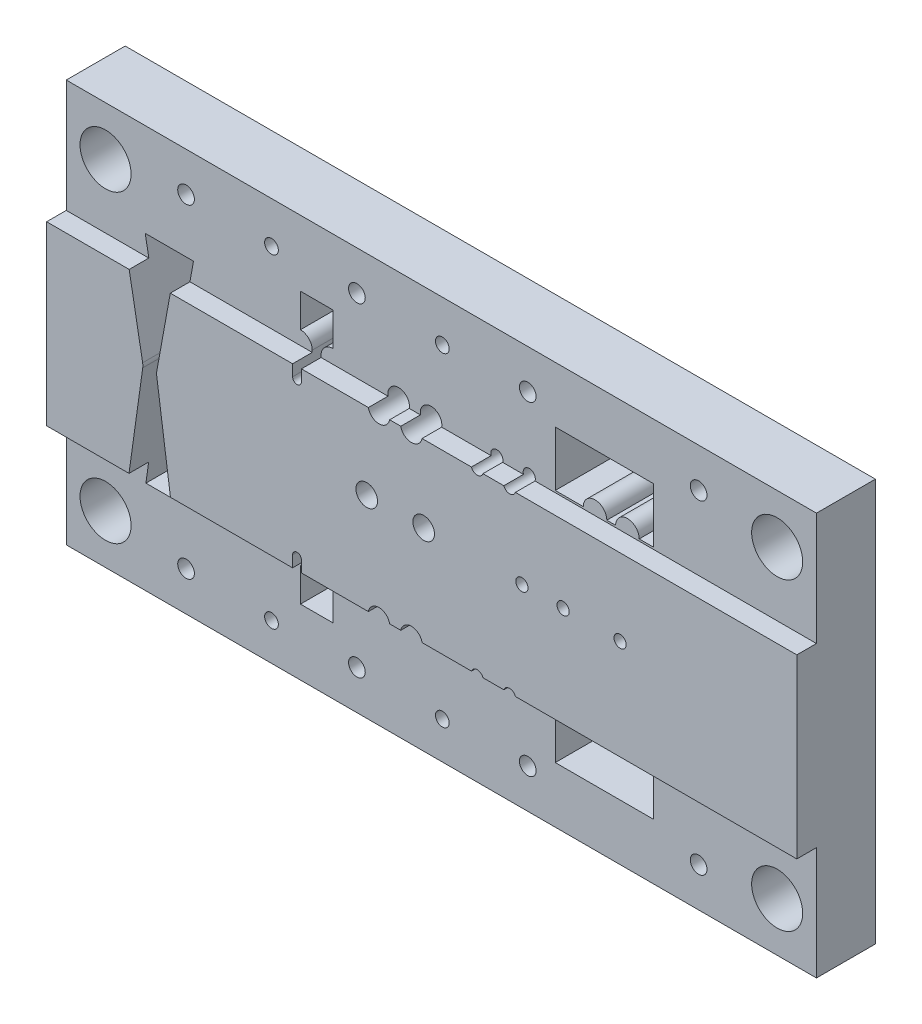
ISO-10303-21;
HEADER;
FILE_DESCRIPTION(('STEP AP214'),'2;1');
FILE_NAME('part.step','',(''),(''),'','','');
FILE_SCHEMA(('AUTOMOTIVE_DESIGN { 1 0 10303 214 1 1 1 1 }'));
ENDSEC;
DATA;
#1=APPLICATION_CONTEXT('core data for automotive mechanical design processes');
#2=APPLICATION_PROTOCOL_DEFINITION('international standard','automotive_design',2000,#1);
#3=PRODUCT_CONTEXT('',#1,'mechanical');
#4=PRODUCT('Part','Part','',(#3));
#5=PRODUCT_RELATED_PRODUCT_CATEGORY('part','',(#4));
#6=PRODUCT_DEFINITION_FORMATION('','',#4);
#7=PRODUCT_DEFINITION_CONTEXT('part definition',#1,'design');
#8=PRODUCT_DEFINITION('design','',#6,#7);
#9=PRODUCT_DEFINITION_SHAPE('','',#8);
#10=(LENGTH_UNIT() NAMED_UNIT(*) SI_UNIT(.MILLI.,.METRE.));
#11=(NAMED_UNIT(*) PLANE_ANGLE_UNIT() SI_UNIT($,.RADIAN.));
#12=(NAMED_UNIT(*) SI_UNIT($,.STERADIAN.) SOLID_ANGLE_UNIT());
#13=UNCERTAINTY_MEASURE_WITH_UNIT(LENGTH_MEASURE(1.E-05),#10,'distance_accuracy_value','');
#14=(GEOMETRIC_REPRESENTATION_CONTEXT(3) GLOBAL_UNCERTAINTY_ASSIGNED_CONTEXT((#13)) GLOBAL_UNIT_ASSIGNED_CONTEXT((#10,
#11,#12)) REPRESENTATION_CONTEXT('',''));
#15=CARTESIAN_POINT('',(0.,0.,0.));
#16=DIRECTION('',(0.,0.,1.));
#17=DIRECTION('',(1.,0.,0.));
#18=AXIS2_PLACEMENT_3D('',#15,#16,#17);
#19=CARTESIAN_POINT('',(0.,-57.5,40.));
#20=DIRECTION('',(0.,-1.,0.));
#21=DIRECTION('',(0.,0.,-1.));
#22=AXIS2_PLACEMENT_3D('',#19,#20,#21);
#23=PLANE('',#22);
#24=DIRECTION('',(-1.,0.,0.));
#25=VECTOR('',#24,1.);
#26=CARTESIAN_POINT('',(0.,-57.5,30.));
#27=LINE('',#26,#25);
#28=CARTESIAN_POINT('',(125.25,-57.5,30.));
#29=VERTEX_POINT('',#28);
#30=CARTESIAN_POINT('',(62.9701442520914,-57.5,30.));
#31=VERTEX_POINT('',#30);
#32=EDGE_CURVE('E163',#29,#31,#27,.T.);
#33=ORIENTED_EDGE('',*,*,#32,.T.);
#34=DIRECTION('',(0.,0.,1.));
#35=VECTOR('',#34,1.);
#36=CARTESIAN_POINT('',(62.9701442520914,-57.5,40.));
#37=LINE('',#36,#35);
#38=CARTESIAN_POINT('',(62.9701442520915,-57.5,40.));
#39=VERTEX_POINT('',#38);
#40=EDGE_CURVE('E1188',#31,#39,#37,.T.);
#41=ORIENTED_EDGE('',*,*,#40,.T.);
#42=DIRECTION('',(-1.,0.,0.));
#43=VECTOR('',#42,1.);
#44=CARTESIAN_POINT('',(0.,-57.5,40.));
#45=LINE('',#44,#43);
#46=CARTESIAN_POINT('',(125.25,-57.5,40.));
#47=VERTEX_POINT('',#46);
#48=EDGE_CURVE('E101',#47,#39,#45,.T.);
#49=ORIENTED_EDGE('',*,*,#48,.F.);
#50=DIRECTION('',(0.,0.,-1.));
#51=VECTOR('',#50,1.);
#52=CARTESIAN_POINT('',(125.25,-57.5,40.));
#53=LINE('',#52,#51);
#54=EDGE_CURVE('E1132',#47,#29,#53,.T.);
#55=ORIENTED_EDGE('',*,*,#54,.T.);
#56=EDGE_LOOP('',(#33,#41,#49,#55));
#57=FACE_BOUND('',#56,.T.);
#58=ADVANCED_FACE('F31',(#57),#23,.F.);
#59=CARTESIAN_POINT('',(0.,-147.5,40.));
#60=DIRECTION('',(0.,1.,0.));
#61=DIRECTION('',(0.,0.,1.));
#62=AXIS2_PLACEMENT_3D('',#59,#60,#61);
#63=PLANE('',#62);
#64=DIRECTION('',(1.,0.,0.));
#65=VECTOR('',#64,1.);
#66=CARTESIAN_POINT('',(0.,-147.5,40.));
#67=LINE('',#66,#65);
#68=CARTESIAN_POINT('',(63.0522000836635,-147.5,40.));
#69=VERTEX_POINT('',#68);
#70=CARTESIAN_POINT('',(125.25,-147.5,40.));
#71=VERTEX_POINT('',#70);
#72=EDGE_CURVE('E207',#69,#71,#67,.T.);
#73=ORIENTED_EDGE('',*,*,#72,.F.);
#74=DIRECTION('',(0.,0.,-1.));
#75=VECTOR('',#74,1.);
#76=CARTESIAN_POINT('',(63.0522000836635,-147.5,40.));
#77=LINE('',#76,#75);
#78=CARTESIAN_POINT('',(63.0522000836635,-147.5,30.));
#79=VERTEX_POINT('',#78);
#80=EDGE_CURVE('E1183',#69,#79,#77,.T.);
#81=ORIENTED_EDGE('',*,*,#80,.T.);
#82=DIRECTION('',(1.,0.,0.));
#83=VECTOR('',#82,1.);
#84=CARTESIAN_POINT('',(0.,-147.5,30.));
#85=LINE('',#84,#83);
#86=CARTESIAN_POINT('',(125.25,-147.5,30.));
#87=VERTEX_POINT('',#86);
#88=EDGE_CURVE('E109',#79,#87,#85,.T.);
#89=ORIENTED_EDGE('',*,*,#88,.T.);
#90=DIRECTION('',(0.,0.,1.));
#91=VECTOR('',#90,1.);
#92=CARTESIAN_POINT('',(125.25,-147.5,40.));
#93=LINE('',#92,#91);
#94=EDGE_CURVE('E1083',#87,#71,#93,.T.);
#95=ORIENTED_EDGE('',*,*,#94,.T.);
#96=EDGE_LOOP('',(#73,#81,#89,#95));
#97=FACE_BOUND('',#96,.T.);
#98=ADVANCED_FACE('F957',(#97),#63,.F.);
#99=CARTESIAN_POINT('',(0.,-147.5,40.));
#100=DIRECTION('',(0.,0.,1.));
#101=DIRECTION('',(1.,0.,0.));
#102=AXIS2_PLACEMENT_3D('',#99,#100,#101);
#103=PLANE('',#102);
#104=CARTESIAN_POINT('',(242.,-96.5,40.));
#105=DIRECTION('',(0.,0.,1.));
#106=DIRECTION('',(1.,0.,0.));
#107=AXIS2_PLACEMENT_3D('',#104,#105,#106);
#108=CIRCLE('',#107,3.09999999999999);
#109=CARTESIAN_POINT('',(238.9,-96.5,40.));
#110=VERTEX_POINT('',#109);
#111=EDGE_CURVE('E1220',#110,#110,#108,.T.);
#112=ORIENTED_EDGE('',*,*,#111,.F.);
#113=EDGE_LOOP('',(#112));
#114=FACE_BOUND('',#113,.T.);
#115=DIRECTION('',(-0.138268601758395,0.990394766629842,0.));
#116=VECTOR('',#115,1.);
#117=CARTESIAN_POINT('',(61.8467551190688,-138.865600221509,40.));
#118=LINE('',#117,#116);
#119=CARTESIAN_POINT('',(56.067236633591,-97.4678802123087,40.));
#120=VERTEX_POINT('',#119);
#121=EDGE_CURVE('E11',#69,#120,#118,.T.);
#122=ORIENTED_EDGE('',*,*,#121,.F.);
#123=ORIENTED_EDGE('',*,*,#72,.T.);
#124=DIRECTION('',(0.,-1.,0.));
#125=VECTOR('',#124,1.);
#126=CARTESIAN_POINT('',(125.25,-147.5,40.));
#127=LINE('',#126,#125);
#128=CARTESIAN_POINT('',(125.25,-141.75,40.));
#129=VERTEX_POINT('',#128);
#130=EDGE_CURVE('E149',#129,#71,#127,.T.);
#131=ORIENTED_EDGE('',*,*,#130,.F.);
#132=CARTESIAN_POINT('',(127.5,-141.75,40.));
#133=DIRECTION('',(0.,0.,-1.));
#134=DIRECTION('',(-1.,0.,0.));
#135=AXIS2_PLACEMENT_3D('',#132,#133,#134);
#136=CIRCLE('',#135,2.25);
#137=CARTESIAN_POINT('',(129.75,-141.75,40.));
#138=VERTEX_POINT('',#137);
#139=EDGE_CURVE('E151',#138,#129,#136,.F.);
#140=ORIENTED_EDGE('',*,*,#139,.F.);
#141=DIRECTION('',(0.,1.,0.));
#142=VECTOR('',#141,1.);
#143=CARTESIAN_POINT('',(129.75,-147.5,40.));
#144=LINE('',#143,#142);
#145=CARTESIAN_POINT('',(129.75,-147.5,40.));
#146=VERTEX_POINT('',#145);
#147=EDGE_CURVE('E154',#146,#138,#144,.T.);
#148=ORIENTED_EDGE('',*,*,#147,.F.);
#149=CARTESIAN_POINT('',(163.841673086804,-147.5,40.));
#150=VERTEX_POINT('',#149);
#151=EDGE_CURVE('E214',#146,#150,#67,.T.);
#152=ORIENTED_EDGE('',*,*,#151,.T.);
#153=CARTESIAN_POINT('',(169.25,-148.5,40.));
#154=DIRECTION('',(0.,0.,1.));
#155=DIRECTION('',(1.,0.,0.));
#156=AXIS2_PLACEMENT_3D('',#153,#154,#155);
#157=CIRCLE('',#156,5.50000000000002);
#158=CARTESIAN_POINT('',(174.658326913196,-147.5,40.));
#159=VERTEX_POINT('',#158);
#160=EDGE_CURVE('E278',#159,#150,#157,.T.);
#161=ORIENTED_EDGE('',*,*,#160,.F.);
#162=CARTESIAN_POINT('',(180.341673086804,-147.5,40.));
#163=VERTEX_POINT('',#162);
#164=EDGE_CURVE('E223',#159,#163,#67,.T.);
#165=ORIENTED_EDGE('',*,*,#164,.T.);
#166=CARTESIAN_POINT('',(185.75,-148.5,40.));
#167=DIRECTION('',(0.,0.,1.));
#168=DIRECTION('',(1.,0.,0.));
#169=AXIS2_PLACEMENT_3D('',#166,#167,#168);
#170=CIRCLE('',#169,5.50000000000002);
#171=CARTESIAN_POINT('',(191.158326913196,-147.5,40.));
#172=VERTEX_POINT('',#171);
#173=EDGE_CURVE('E286',#172,#163,#170,.T.);
#174=ORIENTED_EDGE('',*,*,#173,.F.);
#175=CARTESIAN_POINT('',(216.315719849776,-147.5,40.));
#176=VERTEX_POINT('',#175);
#177=EDGE_CURVE('E222',#172,#176,#67,.T.);
#178=ORIENTED_EDGE('',*,*,#177,.T.);
#179=CARTESIAN_POINT('',(219.25,-148.5,40.));
#180=DIRECTION('',(0.,0.,1.));
#181=DIRECTION('',(1.,0.,0.));
#182=AXIS2_PLACEMENT_3D('',#179,#180,#181);
#183=CIRCLE('',#182,3.09999999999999);
#184=CARTESIAN_POINT('',(222.184280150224,-147.5,40.));
#185=VERTEX_POINT('',#184);
#186=EDGE_CURVE('E271',#185,#176,#183,.T.);
#187=ORIENTED_EDGE('',*,*,#186,.F.);
#188=CARTESIAN_POINT('',(232.815719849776,-147.5,40.));
#189=VERTEX_POINT('',#188);
#190=EDGE_CURVE('E216',#185,#189,#67,.T.);
#191=ORIENTED_EDGE('',*,*,#190,.T.);
#192=CARTESIAN_POINT('',(235.75,-148.5,40.));
#193=DIRECTION('',(0.,0.,1.));
#194=DIRECTION('',(1.,0.,0.));
#195=AXIS2_PLACEMENT_3D('',#192,#193,#194);
#196=CIRCLE('',#195,3.09999999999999);
#197=CARTESIAN_POINT('',(238.684280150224,-147.5,40.));
#198=VERTEX_POINT('',#197);
#199=EDGE_CURVE('E267',#198,#189,#196,.T.);
#200=ORIENTED_EDGE('',*,*,#199,.F.);
#201=CARTESIAN_POINT('',(382.,-147.5,40.));
#202=VERTEX_POINT('',#201);
#203=EDGE_CURVE('E209',#198,#202,#67,.T.);
#204=ORIENTED_EDGE('',*,*,#203,.T.);
#205=DIRECTION('',(0.,1.,0.));
#206=VECTOR('',#205,1.);
#207=CARTESIAN_POINT('',(382.,-57.5,40.));
#208=LINE('',#207,#206);
#209=CARTESIAN_POINT('',(382.,-57.5,40.));
#210=VERTEX_POINT('',#209);
#211=EDGE_CURVE('E206',#202,#210,#208,.T.);
#212=ORIENTED_EDGE('',*,*,#211,.T.);
#213=CARTESIAN_POINT('',(238.684280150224,-57.5,40.));
#214=VERTEX_POINT('',#213);
#215=EDGE_CURVE('E244',#210,#214,#45,.T.);
#216=ORIENTED_EDGE('',*,*,#215,.T.);
#217=CARTESIAN_POINT('',(235.75,-56.4999999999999,40.));
#218=DIRECTION('',(0.,0.,1.));
#219=DIRECTION('',(1.,0.,0.));
#220=AXIS2_PLACEMENT_3D('',#217,#218,#219);
#221=CIRCLE('',#220,3.09999999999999);
#222=CARTESIAN_POINT('',(232.815719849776,-57.5,40.));
#223=VERTEX_POINT('',#222);
#224=EDGE_CURVE('E260',#223,#214,#221,.T.);
#225=ORIENTED_EDGE('',*,*,#224,.F.);
#226=CARTESIAN_POINT('',(222.184280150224,-57.5,40.));
#227=VERTEX_POINT('',#226);
#228=EDGE_CURVE('E687',#223,#227,#45,.T.);
#229=ORIENTED_EDGE('',*,*,#228,.T.);
#230=CARTESIAN_POINT('',(219.25,-56.4999999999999,40.));
#231=DIRECTION('',(0.,0.,1.));
#232=DIRECTION('',(1.,0.,0.));
#233=AXIS2_PLACEMENT_3D('',#230,#231,#232);
#234=CIRCLE('',#233,3.09999999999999);
#235=CARTESIAN_POINT('',(216.315719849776,-57.5,40.));
#236=VERTEX_POINT('',#235);
#237=EDGE_CURVE('E262',#236,#227,#234,.T.);
#238=ORIENTED_EDGE('',*,*,#237,.F.);
#239=CARTESIAN_POINT('',(191.158326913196,-57.5,40.));
#240=VERTEX_POINT('',#239);
#241=EDGE_CURVE('E684',#236,#240,#45,.T.);
#242=ORIENTED_EDGE('',*,*,#241,.T.);
#243=CARTESIAN_POINT('',(185.75,-56.5,40.));
#244=DIRECTION('',(0.,0.,1.));
#245=DIRECTION('',(1.,0.,0.));
#246=AXIS2_PLACEMENT_3D('',#243,#244,#245);
#247=CIRCLE('',#246,5.50000000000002);
#248=CARTESIAN_POINT('',(180.341673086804,-57.5,40.));
#249=VERTEX_POINT('',#248);
#250=EDGE_CURVE('E302',#249,#240,#247,.T.);
#251=ORIENTED_EDGE('',*,*,#250,.F.);
#252=CARTESIAN_POINT('',(174.658326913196,-57.5,40.));
#253=VERTEX_POINT('',#252);
#254=EDGE_CURVE('E682',#249,#253,#45,.T.);
#255=ORIENTED_EDGE('',*,*,#254,.T.);
#256=CARTESIAN_POINT('',(169.25,-56.5,40.));
#257=DIRECTION('',(0.,0.,1.));
#258=DIRECTION('',(1.,0.,0.));
#259=AXIS2_PLACEMENT_3D('',#256,#257,#258);
#260=CIRCLE('',#259,5.50000000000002);
#261=CARTESIAN_POINT('',(163.841673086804,-57.5,40.));
#262=VERTEX_POINT('',#261);
#263=EDGE_CURVE('E294',#262,#253,#260,.T.);
#264=ORIENTED_EDGE('',*,*,#263,.F.);
#265=CARTESIAN_POINT('',(129.75,-57.5,40.));
#266=VERTEX_POINT('',#265);
#267=EDGE_CURVE('E679',#262,#266,#45,.T.);
#268=ORIENTED_EDGE('',*,*,#267,.T.);
#269=DIRECTION('',(0.,1.,0.));
#270=VECTOR('',#269,1.);
#271=CARTESIAN_POINT('',(129.75,-147.5,40.));
#272=LINE('',#271,#270);
#273=CARTESIAN_POINT('',(129.75,-63.25,40.));
#274=VERTEX_POINT('',#273);
#275=EDGE_CURVE('E155',#274,#266,#272,.T.);
#276=ORIENTED_EDGE('',*,*,#275,.F.);
#277=CARTESIAN_POINT('',(127.5,-63.25,40.));
#278=DIRECTION('',(0.,0.,-1.));
#279=DIRECTION('',(-1.,0.,0.));
#280=AXIS2_PLACEMENT_3D('',#277,#278,#279);
#281=CIRCLE('',#280,2.25);
#282=CARTESIAN_POINT('',(125.25,-63.25,40.));
#283=VERTEX_POINT('',#282);
#284=EDGE_CURVE('E158',#283,#274,#281,.F.);
#285=ORIENTED_EDGE('',*,*,#284,.F.);
#286=DIRECTION('',(0.,-1.,0.));
#287=VECTOR('',#286,1.);
#288=CARTESIAN_POINT('',(125.249999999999,-147.500000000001,40.));
#289=LINE('',#288,#287);
#290=EDGE_CURVE('E159',#47,#283,#289,.T.);
#291=ORIENTED_EDGE('',*,*,#290,.F.);
#292=ORIENTED_EDGE('',*,*,#48,.T.);
#293=DIRECTION('',(0.178733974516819,0.983897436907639,0.));
#294=VECTOR('',#293,1.);
#295=CARTESIAN_POINT('',(45.1314795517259,-155.698546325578,40.));
#296=LINE('',#295,#294);
#297=CARTESIAN_POINT('',(56.1127179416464,-95.2488621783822,40.));
#298=VERTEX_POINT('',#297);
#299=EDGE_CURVE('E83',#298,#39,#296,.T.);
#300=ORIENTED_EDGE('',*,*,#299,.F.);
#301=CARTESIAN_POINT('',(62.9999999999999,-96.5,40.));
#302=DIRECTION('',(0.,0.,-1.));
#303=DIRECTION('',(-1.,0.,0.));
#304=AXIS2_PLACEMENT_3D('',#301,#302,#303);
#305=CIRCLE('',#304,6.99999999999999);
#306=EDGE_CURVE('E35',#120,#298,#305,.T.);
#307=ORIENTED_EDGE('',*,*,#306,.F.);
#308=EDGE_LOOP('',(#122,#123,#131,#140,#148,#152,#161,#165,#174,#178,#187,#191,#200,#204,#212,
#216,#225,#229,#238,#242,#251,#255,#264,#268,#276,#285,#291,#292,#300,#307));
#309=FACE_BOUND('',#308,.T.);
#310=CARTESIAN_POINT('',(263.,-96.5,40.));
#311=DIRECTION('',(0.,0.,1.));
#312=DIRECTION('',(1.,0.,0.));
#313=AXIS2_PLACEMENT_3D('',#310,#311,#312);
#314=CIRCLE('',#313,3.09999999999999);
#315=CARTESIAN_POINT('',(259.9,-96.5,40.));
#316=VERTEX_POINT('',#315);
#317=EDGE_CURVE('E251',#316,#316,#314,.T.);
#318=ORIENTED_EDGE('',*,*,#317,.F.);
#319=EDGE_LOOP('',(#318));
#320=FACE_BOUND('',#319,.T.);
#321=CARTESIAN_POINT('',(292.,-96.5,40.));
#322=DIRECTION('',(0.,0.,1.));
#323=DIRECTION('',(1.,0.,0.));
#324=AXIS2_PLACEMENT_3D('',#321,#322,#323);
#325=CIRCLE('',#324,3.09999999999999);
#326=CARTESIAN_POINT('',(288.9,-96.5,40.));
#327=VERTEX_POINT('',#326);
#328=EDGE_CURVE('E256',#327,#327,#325,.T.);
#329=ORIENTED_EDGE('',*,*,#328,.F.);
#330=EDGE_LOOP('',(#329));
#331=FACE_BOUND('',#330,.T.);
#332=CARTESIAN_POINT('',(163.,-96.5,40.));
#333=DIRECTION('',(0.,0.,1.));
#334=DIRECTION('',(1.,0.,0.));
#335=AXIS2_PLACEMENT_3D('',#332,#333,#334);
#336=CIRCLE('',#335,5.50000000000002);
#337=CARTESIAN_POINT('',(157.5,-96.5,40.));
#338=VERTEX_POINT('',#337);
#339=EDGE_CURVE('E1039',#338,#338,#336,.T.);
#340=ORIENTED_EDGE('',*,*,#339,.F.);
#341=EDGE_LOOP('',(#340));
#342=FACE_BOUND('',#341,.T.);
#343=CARTESIAN_POINT('',(192.,-96.5,40.));
#344=DIRECTION('',(0.,0.,1.));
#345=DIRECTION('',(1.,0.,0.));
#346=AXIS2_PLACEMENT_3D('',#343,#344,#345);
#347=CIRCLE('',#346,5.50000000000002);
#348=CARTESIAN_POINT('',(186.5,-96.5,40.));
#349=VERTEX_POINT('',#348);
#350=EDGE_CURVE('E314',#349,#349,#347,.T.);
#351=ORIENTED_EDGE('',*,*,#350,.F.);
#352=EDGE_LOOP('',(#351));
#353=FACE_BOUND('',#352,.T.);
#354=ADVANCED_FACE('F97',(#114,#309,#320,#331,#342,#353),#103,.T.);
#355=CARTESIAN_POINT('',(42.0298557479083,-57.5,40.));
#356=VERTEX_POINT('',#355);
#357=CARTESIAN_POINT('',(0.,-57.5,40.));
#358=VERTEX_POINT('',#357);
#359=EDGE_CURVE('E211',#356,#358,#45,.T.);
#360=ORIENTED_EDGE('',*,*,#359,.F.);
#361=DIRECTION('',(0.,0.,-1.));
#362=VECTOR('',#361,1.);
#363=CARTESIAN_POINT('',(42.0298557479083,-57.5,40.));
#364=LINE('',#363,#362);
#365=CARTESIAN_POINT('',(42.0298557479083,-57.5,30.));
#366=VERTEX_POINT('',#365);
#367=EDGE_CURVE('E1193',#356,#366,#364,.T.);
#368=ORIENTED_EDGE('',*,*,#367,.T.);
#369=CARTESIAN_POINT('',(0.,-57.5,30.));
#370=VERTEX_POINT('',#369);
#371=EDGE_CURVE('E115',#366,#370,#27,.T.);
#372=ORIENTED_EDGE('',*,*,#371,.T.);
#373=DIRECTION('',(0.,0.,-1.));
#374=VECTOR('',#373,1.);
#375=CARTESIAN_POINT('',(0.,-57.5,40.));
#376=LINE('',#375,#374);
#377=EDGE_CURVE('E240',#358,#370,#376,.T.);
#378=ORIENTED_EDGE('',*,*,#377,.F.);
#379=EDGE_LOOP('',(#360,#368,#372,#378));
#380=FACE_BOUND('',#379,.T.);
#381=ADVANCED_FACE('F701',(#380),#23,.F.);
#382=CARTESIAN_POINT('',(0.,-147.5,30.));
#383=VERTEX_POINT('',#382);
#384=CARTESIAN_POINT('',(41.9477999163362,-147.5,30.));
#385=VERTEX_POINT('',#384);
#386=EDGE_CURVE('E113',#383,#385,#85,.T.);
#387=ORIENTED_EDGE('',*,*,#386,.T.);
#388=DIRECTION('',(0.,0.,1.));
#389=VECTOR('',#388,1.);
#390=CARTESIAN_POINT('',(41.9477999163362,-147.5,40.));
#391=LINE('',#390,#389);
#392=CARTESIAN_POINT('',(41.9477999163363,-147.5,40.));
#393=VERTEX_POINT('',#392);
#394=EDGE_CURVE('E1197',#385,#393,#391,.T.);
#395=ORIENTED_EDGE('',*,*,#394,.T.);
#396=CARTESIAN_POINT('',(0.,-147.5,40.));
#397=VERTEX_POINT('',#396);
#398=EDGE_CURVE('E196',#397,#393,#67,.T.);
#399=ORIENTED_EDGE('',*,*,#398,.F.);
#400=DIRECTION('',(0.,0.,-1.));
#401=VECTOR('',#400,1.);
#402=CARTESIAN_POINT('',(0.,-147.5,40.));
#403=LINE('',#402,#401);
#404=EDGE_CURVE('E708',#397,#383,#403,.T.);
#405=ORIENTED_EDGE('',*,*,#404,.T.);
#406=EDGE_LOOP('',(#387,#395,#399,#405));
#407=FACE_BOUND('',#406,.T.);
#408=ADVANCED_FACE('F965',(#407),#63,.F.);
#409=ORIENTED_EDGE('',*,*,#254,.F.);
#410=DIRECTION('',(0.,0.,-1.));
#411=VECTOR('',#410,1.);
#412=CARTESIAN_POINT('',(180.341673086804,-57.5,40.000025));
#413=LINE('',#412,#411);
#414=CARTESIAN_POINT('',(180.341673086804,-57.5,30.));
#415=VERTEX_POINT('',#414);
#416=EDGE_CURVE('E1057',#249,#415,#413,.T.);
#417=ORIENTED_EDGE('',*,*,#416,.T.);
#418=CARTESIAN_POINT('',(174.658326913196,-57.5,30.));
#419=VERTEX_POINT('',#418);
#420=EDGE_CURVE('E269',#415,#419,#27,.T.);
#421=ORIENTED_EDGE('',*,*,#420,.T.);
#422=DIRECTION('',(0.,0.,-1.));
#423=VECTOR('',#422,1.);
#424=CARTESIAN_POINT('',(174.658326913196,-57.5,40.000025));
#425=LINE('',#424,#423);
#426=EDGE_CURVE('E1050',#419,#253,#425,.F.);
#427=ORIENTED_EDGE('',*,*,#426,.T.);
#428=EDGE_LOOP('',(#409,#417,#421,#427));
#429=FACE_BOUND('',#428,.T.);
#430=ADVANCED_FACE('F968',(#429),#23,.F.);
#431=CARTESIAN_POINT('',(163.841673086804,-57.5,30.));
#432=VERTEX_POINT('',#431);
#433=CARTESIAN_POINT('',(129.75,-57.5,30.));
#434=VERTEX_POINT('',#433);
#435=EDGE_CURVE('E166',#432,#434,#27,.T.);
#436=ORIENTED_EDGE('',*,*,#435,.T.);
#437=DIRECTION('',(0.,0.,1.));
#438=VECTOR('',#437,1.);
#439=CARTESIAN_POINT('',(129.75,-57.5,40.));
#440=LINE('',#439,#438);
#441=EDGE_CURVE('E1137',#434,#266,#440,.T.);
#442=ORIENTED_EDGE('',*,*,#441,.T.);
#443=ORIENTED_EDGE('',*,*,#267,.F.);
#444=DIRECTION('',(0.,0.,-1.));
#445=VECTOR('',#444,1.);
#446=CARTESIAN_POINT('',(163.841673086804,-57.5,40.000025));
#447=LINE('',#446,#445);
#448=EDGE_CURVE('E1048',#262,#432,#447,.T.);
#449=ORIENTED_EDGE('',*,*,#448,.T.);
#450=EDGE_LOOP('',(#436,#442,#443,#449));
#451=FACE_BOUND('',#450,.T.);
#452=ADVANCED_FACE('F985',(#451),#23,.F.);
#453=ORIENTED_EDGE('',*,*,#177,.F.);
#454=DIRECTION('',(0.,0.,-1.));
#455=VECTOR('',#454,1.);
#456=CARTESIAN_POINT('',(191.158326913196,-147.5,40.000025));
#457=LINE('',#456,#455);
#458=CARTESIAN_POINT('',(191.158326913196,-147.5,30.));
#459=VERTEX_POINT('',#458);
#460=EDGE_CURVE('E1031',#172,#459,#457,.T.);
#461=ORIENTED_EDGE('',*,*,#460,.T.);
#462=CARTESIAN_POINT('',(216.315719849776,-147.5,30.));
#463=VERTEX_POINT('',#462);
#464=EDGE_CURVE('E143',#459,#463,#85,.T.);
#465=ORIENTED_EDGE('',*,*,#464,.T.);
#466=DIRECTION('',(0.,0.,-1.));
#467=VECTOR('',#466,1.);
#468=CARTESIAN_POINT('',(216.315719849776,-147.5,40.000025));
#469=LINE('',#468,#467);
#470=EDGE_CURVE('E1014',#463,#176,#469,.F.);
#471=ORIENTED_EDGE('',*,*,#470,.T.);
#472=EDGE_LOOP('',(#453,#461,#465,#471));
#473=FACE_BOUND('',#472,.T.);
#474=ADVANCED_FACE('F2227',(#473),#63,.F.);
#475=CARTESIAN_POINT('',(174.658326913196,-147.5,30.));
#476=VERTEX_POINT('',#475);
#477=CARTESIAN_POINT('',(180.341673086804,-147.5,30.));
#478=VERTEX_POINT('',#477);
#479=EDGE_CURVE('E140',#476,#478,#85,.T.);
#480=ORIENTED_EDGE('',*,*,#479,.T.);
#481=DIRECTION('',(0.,0.,-1.));
#482=VECTOR('',#481,1.);
#483=CARTESIAN_POINT('',(180.341673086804,-147.5,40.000025));
#484=LINE('',#483,#482);
#485=EDGE_CURVE('E1034',#478,#163,#484,.F.);
#486=ORIENTED_EDGE('',*,*,#485,.T.);
#487=ORIENTED_EDGE('',*,*,#164,.F.);
#488=DIRECTION('',(0.,0.,-1.));
#489=VECTOR('',#488,1.);
#490=CARTESIAN_POINT('',(174.658326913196,-147.5,40.000025));
#491=LINE('',#490,#489);
#492=EDGE_CURVE('E1021',#159,#476,#491,.T.);
#493=ORIENTED_EDGE('',*,*,#492,.T.);
#494=EDGE_LOOP('',(#480,#486,#487,#493));
#495=FACE_BOUND('',#494,.T.);
#496=ADVANCED_FACE('F2247',(#495),#63,.F.);
#497=ORIENTED_EDGE('',*,*,#190,.F.);
#498=DIRECTION('',(0.,0.,-1.));
#499=VECTOR('',#498,1.);
#500=CARTESIAN_POINT('',(222.184280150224,-147.5,40.000025));
#501=LINE('',#500,#499);
#502=CARTESIAN_POINT('',(222.184280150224,-147.5,30.));
#503=VERTEX_POINT('',#502);
#504=EDGE_CURVE('E1011',#185,#503,#501,.T.);
#505=ORIENTED_EDGE('',*,*,#504,.T.);
#506=CARTESIAN_POINT('',(232.815719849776,-147.5,30.));
#507=VERTEX_POINT('',#506);
#508=EDGE_CURVE('E136',#503,#507,#85,.T.);
#509=ORIENTED_EDGE('',*,*,#508,.T.);
#510=DIRECTION('',(0.,0.,-1.));
#511=VECTOR('',#510,1.);
#512=CARTESIAN_POINT('',(232.815719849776,-147.5,40.000025));
#513=LINE('',#512,#511);
#514=EDGE_CURVE('E1004',#507,#189,#513,.F.);
#515=ORIENTED_EDGE('',*,*,#514,.T.);
#516=EDGE_LOOP('',(#497,#505,#509,#515));
#517=FACE_BOUND('',#516,.T.);
#518=ADVANCED_FACE('F2255',(#517),#63,.F.);
#519=ORIENTED_EDGE('',*,*,#203,.F.);
#520=DIRECTION('',(0.,0.,-1.));
#521=VECTOR('',#520,1.);
#522=CARTESIAN_POINT('',(238.684280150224,-147.5,40.000025));
#523=LINE('',#522,#521);
#524=CARTESIAN_POINT('',(238.684280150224,-147.5,30.));
#525=VERTEX_POINT('',#524);
#526=EDGE_CURVE('E729',#198,#525,#523,.T.);
#527=ORIENTED_EDGE('',*,*,#526,.T.);
#528=CARTESIAN_POINT('',(382.,-147.5,30.));
#529=VERTEX_POINT('',#528);
#530=EDGE_CURVE('E131',#525,#529,#85,.T.);
#531=ORIENTED_EDGE('',*,*,#530,.T.);
#532=DIRECTION('',(0.,0.,-1.));
#533=VECTOR('',#532,1.);
#534=CARTESIAN_POINT('',(382.,-147.5,40.));
#535=LINE('',#534,#533);
#536=EDGE_CURVE('E248',#202,#529,#535,.T.);
#537=ORIENTED_EDGE('',*,*,#536,.F.);
#538=EDGE_LOOP('',(#519,#527,#531,#537));
#539=FACE_BOUND('',#538,.T.);
#540=ADVANCED_FACE('F726',(#539),#63,.F.);
#541=CARTESIAN_POINT('',(216.315719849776,-57.5,30.));
#542=VERTEX_POINT('',#541);
#543=CARTESIAN_POINT('',(191.158326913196,-57.5,30.));
#544=VERTEX_POINT('',#543);
#545=EDGE_CURVE('E234',#542,#544,#27,.T.);
#546=ORIENTED_EDGE('',*,*,#545,.T.);
#547=DIRECTION('',(0.,0.,-1.));
#548=VECTOR('',#547,1.);
#549=CARTESIAN_POINT('',(191.158326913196,-57.5,40.000025));
#550=LINE('',#549,#548);
#551=EDGE_CURVE('E1060',#544,#240,#550,.F.);
#552=ORIENTED_EDGE('',*,*,#551,.T.);
#553=ORIENTED_EDGE('',*,*,#241,.F.);
#554=DIRECTION('',(0.,0.,-1.));
#555=VECTOR('',#554,1.);
#556=CARTESIAN_POINT('',(216.315719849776,-57.5,40.000025));
#557=LINE('',#556,#555);
#558=EDGE_CURVE('E994',#236,#542,#557,.T.);
#559=ORIENTED_EDGE('',*,*,#558,.T.);
#560=EDGE_LOOP('',(#546,#552,#553,#559));
#561=FACE_BOUND('',#560,.T.);
#562=ADVANCED_FACE('F976',(#561),#23,.F.);
#563=CARTESIAN_POINT('',(232.815719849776,-57.5,30.));
#564=VERTEX_POINT('',#563);
#565=CARTESIAN_POINT('',(222.184280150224,-57.5,30.));
#566=VERTEX_POINT('',#565);
#567=EDGE_CURVE('E226',#564,#566,#27,.T.);
#568=ORIENTED_EDGE('',*,*,#567,.T.);
#569=DIRECTION('',(0.,0.,-1.));
#570=VECTOR('',#569,1.);
#571=CARTESIAN_POINT('',(222.184280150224,-57.5,40.000025));
#572=LINE('',#571,#570);
#573=EDGE_CURVE('E988',#566,#227,#572,.F.);
#574=ORIENTED_EDGE('',*,*,#573,.T.);
#575=ORIENTED_EDGE('',*,*,#228,.F.);
#576=DIRECTION('',(0.,0.,-1.));
#577=VECTOR('',#576,1.);
#578=CARTESIAN_POINT('',(232.815719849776,-57.5,40.000025));
#579=LINE('',#578,#577);
#580=EDGE_CURVE('E790',#223,#564,#579,.T.);
#581=ORIENTED_EDGE('',*,*,#580,.T.);
#582=EDGE_LOOP('',(#568,#574,#575,#581));
#583=FACE_BOUND('',#582,.T.);
#584=ADVANCED_FACE('F970',(#583),#23,.F.);
#585=CARTESIAN_POINT('',(0.,-205.,30.));
#586=DIRECTION('',(0.,0.,1.));
#587=DIRECTION('',(1.,0.,0.));
#588=AXIS2_PLACEMENT_3D('',#585,#586,#587);
#589=PLANE('',#588);
#590=CARTESIAN_POINT('',(104.5,-21.0744385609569,30.));
#591=DIRECTION('',(0.,0.,1.));
#592=DIRECTION('',(1.,0.,0.));
#593=AXIS2_PLACEMENT_3D('',#590,#591,#592);
#594=CIRCLE('',#593,3.5);
#595=CARTESIAN_POINT('',(108.,-21.0744385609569,30.));
#596=VERTEX_POINT('',#595);
#597=EDGE_CURVE('E1334',#596,#596,#594,.T.);
#598=ORIENTED_EDGE('',*,*,#597,.F.);
#599=EDGE_LOOP('',(#598));
#600=FACE_BOUND('',#599,.T.);
#601=CARTESIAN_POINT('',(191.5,-21.0744385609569,30.));
#602=DIRECTION('',(0.,0.,1.));
#603=DIRECTION('',(1.,0.,0.));
#604=AXIS2_PLACEMENT_3D('',#601,#602,#603);
#605=CIRCLE('',#604,3.5);
#606=CARTESIAN_POINT('',(195.,-21.0744385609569,30.));
#607=VERTEX_POINT('',#606);
#608=EDGE_CURVE('E1322',#607,#607,#605,.T.);
#609=ORIENTED_EDGE('',*,*,#608,.F.);
#610=EDGE_LOOP('',(#609));
#611=FACE_BOUND('',#610,.T.);
#612=CARTESIAN_POINT('',(235.,-20.,30.));
#613=DIRECTION('',(0.,0.,1.));
#614=DIRECTION('',(1.,0.,0.));
#615=AXIS2_PLACEMENT_3D('',#612,#613,#614);
#616=CIRCLE('',#615,4.24999999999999);
#617=CARTESIAN_POINT('',(239.25,-20.,30.));
#618=VERTEX_POINT('',#617);
#619=EDGE_CURVE('E1310',#618,#618,#616,.T.);
#620=ORIENTED_EDGE('',*,*,#619,.F.);
#621=EDGE_LOOP('',(#620));
#622=FACE_BOUND('',#621,.T.);
#623=CARTESIAN_POINT('',(148.,-20.,30.));
#624=DIRECTION('',(0.,0.,1.));
#625=DIRECTION('',(1.,0.,0.));
#626=AXIS2_PLACEMENT_3D('',#623,#624,#625);
#627=CIRCLE('',#626,4.24999999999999);
#628=CARTESIAN_POINT('',(152.25,-20.,30.));
#629=VERTEX_POINT('',#628);
#630=EDGE_CURVE('E1304',#629,#629,#627,.T.);
#631=ORIENTED_EDGE('',*,*,#630,.F.);
#632=EDGE_LOOP('',(#631));
#633=FACE_BOUND('',#632,.T.);
#634=CARTESIAN_POINT('',(61.,-20.,30.));
#635=DIRECTION('',(0.,0.,1.));
#636=DIRECTION('',(1.,0.,0.));
#637=AXIS2_PLACEMENT_3D('',#634,#635,#636);
#638=CIRCLE('',#637,4.24999999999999);
#639=CARTESIAN_POINT('',(65.25,-20.,30.));
#640=VERTEX_POINT('',#639);
#641=EDGE_CURVE('E1298',#640,#640,#638,.T.);
#642=ORIENTED_EDGE('',*,*,#641,.F.);
#643=EDGE_LOOP('',(#642));
#644=FACE_BOUND('',#643,.T.);
#645=CARTESIAN_POINT('',(322.,-20.,30.));
#646=DIRECTION('',(0.,0.,1.));
#647=DIRECTION('',(1.,0.,0.));
#648=AXIS2_PLACEMENT_3D('',#645,#646,#647);
#649=CIRCLE('',#648,4.24999999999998);
#650=CARTESIAN_POINT('',(326.25,-20.,30.));
#651=VERTEX_POINT('',#650);
#652=EDGE_CURVE('E1280',#651,#651,#649,.T.);
#653=ORIENTED_EDGE('',*,*,#652,.F.);
#654=EDGE_LOOP('',(#653));
#655=FACE_BOUND('',#654,.T.);
#656=DIRECTION('',(0.178733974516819,0.983897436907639,0.));
#657=VECTOR('',#656,1.);
#658=CARTESIAN_POINT('',(35.0197653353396,-211.361660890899,30.));
#659=LINE('',#658,#657);
#660=CARTESIAN_POINT('',(64.7867357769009,-47.5,30.));
#661=VERTEX_POINT('',#660);
#662=EDGE_CURVE('E1186',#31,#661,#659,.T.);
#663=ORIENTED_EDGE('',*,*,#662,.F.);
#664=ORIENTED_EDGE('',*,*,#32,.F.);
#665=DIRECTION('',(0.,-1.,0.));
#666=VECTOR('',#665,1.);
#667=CARTESIAN_POINT('',(125.249999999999,-205.000000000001,30.));
#668=LINE('',#667,#666);
#669=CARTESIAN_POINT('',(125.25,-56.5,30.));
#670=VERTEX_POINT('',#669);
#671=EDGE_CURVE('E1130',#670,#29,#668,.T.);
#672=ORIENTED_EDGE('',*,*,#671,.F.);
#673=CARTESIAN_POINT('',(119.25,-56.5,30.));
#674=DIRECTION('',(0.,0.,1.));
#675=DIRECTION('',(1.,0.,0.));
#676=AXIS2_PLACEMENT_3D('',#673,#674,#675);
#677=CIRCLE('',#676,6.00000000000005);
#678=CARTESIAN_POINT('',(119.25,-50.4999999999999,30.));
#679=VERTEX_POINT('',#678);
#680=EDGE_CURVE('E1122',#679,#670,#677,.F.);
#681=ORIENTED_EDGE('',*,*,#680,.F.);
#682=DIRECTION('',(0.,-1.,0.));
#683=VECTOR('',#682,1.);
#684=CARTESIAN_POINT('',(119.25,-205.,30.));
#685=LINE('',#684,#683);
#686=CARTESIAN_POINT('',(119.25,-33.5,30.));
#687=VERTEX_POINT('',#686);
#688=EDGE_CURVE('E1118',#687,#679,#685,.T.);
#689=ORIENTED_EDGE('',*,*,#688,.F.);
#690=DIRECTION('',(-1.,0.,0.));
#691=VECTOR('',#690,1.);
#692=CARTESIAN_POINT('',(0.,-33.5,30.));
#693=LINE('',#692,#691);
#694=CARTESIAN_POINT('',(135.75,-33.5,30.));
#695=VERTEX_POINT('',#694);
#696=EDGE_CURVE('E1128',#695,#687,#693,.T.);
#697=ORIENTED_EDGE('',*,*,#696,.F.);
#698=DIRECTION('',(0.,1.,0.));
#699=VECTOR('',#698,1.);
#700=CARTESIAN_POINT('',(135.75,-205.,30.));
#701=LINE('',#700,#699);
#702=CARTESIAN_POINT('',(135.75,-50.5,30.));
#703=VERTEX_POINT('',#702);
#704=EDGE_CURVE('E1126',#703,#695,#701,.T.);
#705=ORIENTED_EDGE('',*,*,#704,.F.);
#706=CARTESIAN_POINT('',(135.75,-56.5,30.));
#707=DIRECTION('',(0.,0.,1.));
#708=DIRECTION('',(1.,0.,0.));
#709=AXIS2_PLACEMENT_3D('',#706,#707,#708);
#710=CIRCLE('',#709,6.00000000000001);
#711=CARTESIAN_POINT('',(129.75,-56.5,30.));
#712=VERTEX_POINT('',#711);
#713=EDGE_CURVE('E1124',#712,#703,#710,.F.);
#714=ORIENTED_EDGE('',*,*,#713,.F.);
#715=DIRECTION('',(0.,1.,0.));
#716=VECTOR('',#715,1.);
#717=CARTESIAN_POINT('',(129.75,-205.,30.));
#718=LINE('',#717,#716);
#719=EDGE_CURVE('E1135',#434,#712,#718,.T.);
#720=ORIENTED_EDGE('',*,*,#719,.F.);
#721=ORIENTED_EDGE('',*,*,#435,.F.);
#722=CARTESIAN_POINT('',(169.25,-56.5,30.));
#723=DIRECTION('',(0.,0.,1.));
#724=DIRECTION('',(1.,0.,0.));
#725=AXIS2_PLACEMENT_3D('',#722,#723,#724);
#726=CIRCLE('',#725,5.50000000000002);
#727=EDGE_CURVE('E1046',#419,#432,#726,.T.);
#728=ORIENTED_EDGE('',*,*,#727,.F.);
#729=ORIENTED_EDGE('',*,*,#420,.F.);
#730=CARTESIAN_POINT('',(185.75,-56.5,30.));
#731=DIRECTION('',(0.,0.,1.));
#732=DIRECTION('',(1.,0.,0.));
#733=AXIS2_PLACEMENT_3D('',#730,#731,#732);
#734=CIRCLE('',#733,5.50000000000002);
#735=EDGE_CURVE('E1055',#544,#415,#734,.T.);
#736=ORIENTED_EDGE('',*,*,#735,.F.);
#737=ORIENTED_EDGE('',*,*,#545,.F.);
#738=CARTESIAN_POINT('',(219.25,-56.4999999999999,30.));
#739=DIRECTION('',(0.,0.,1.));
#740=DIRECTION('',(1.,0.,0.));
#741=AXIS2_PLACEMENT_3D('',#738,#739,#740);
#742=CIRCLE('',#741,3.09999999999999);
#743=EDGE_CURVE('E797',#566,#542,#742,.T.);
#744=ORIENTED_EDGE('',*,*,#743,.F.);
#745=ORIENTED_EDGE('',*,*,#567,.F.);
#746=CARTESIAN_POINT('',(235.75,-56.4999999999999,30.));
#747=DIRECTION('',(0.,0.,1.));
#748=DIRECTION('',(1.,0.,0.));
#749=AXIS2_PLACEMENT_3D('',#746,#747,#748);
#750=CIRCLE('',#749,3.09999999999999);
#751=CARTESIAN_POINT('',(238.684280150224,-57.5,30.));
#752=VERTEX_POINT('',#751);
#753=EDGE_CURVE('E794',#752,#564,#750,.T.);
#754=ORIENTED_EDGE('',*,*,#753,.F.);
#755=CARTESIAN_POINT('',(382.,-57.5,30.));
#756=VERTEX_POINT('',#755);
#757=EDGE_CURVE('E224',#756,#752,#27,.T.);
#758=ORIENTED_EDGE('',*,*,#757,.F.);
#759=DIRECTION('',(0.,1.,0.));
#760=VECTOR('',#759,1.);
#761=CARTESIAN_POINT('',(382.,0.,30.));
#762=LINE('',#761,#760);
#763=CARTESIAN_POINT('',(382.,0.,30.));
#764=VERTEX_POINT('',#763);
#765=EDGE_CURVE('E739',#756,#764,#762,.T.);
#766=ORIENTED_EDGE('',*,*,#765,.T.);
#767=DIRECTION('',(-1.,0.,0.));
#768=VECTOR('',#767,1.);
#769=CARTESIAN_POINT('',(0.,0.,30.));
#770=LINE('',#769,#768);
#771=CARTESIAN_POINT('',(0.,0.,30.));
#772=VERTEX_POINT('',#771);
#773=EDGE_CURVE('E738',#764,#772,#770,.T.);
#774=ORIENTED_EDGE('',*,*,#773,.T.);
#775=DIRECTION('',(0.,-1.,0.));
#776=VECTOR('',#775,1.);
#777=CARTESIAN_POINT('',(0.,0.,30.));
#778=LINE('',#777,#776);
#779=EDGE_CURVE('E759',#772,#370,#778,.T.);
#780=ORIENTED_EDGE('',*,*,#779,.T.);
#781=ORIENTED_EDGE('',*,*,#371,.F.);
#782=DIRECTION('',(0.178733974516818,-0.983897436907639,0.));
#783=VECTOR('',#782,1.);
#784=CARTESIAN_POINT('',(66.6259221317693,-192.896791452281,30.));
#785=LINE('',#784,#783);
#786=CARTESIAN_POINT('',(40.2132642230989,-47.5,30.));
#787=VERTEX_POINT('',#786);
#788=EDGE_CURVE('E1190',#787,#366,#785,.T.);
#789=ORIENTED_EDGE('',*,*,#788,.F.);
#790=DIRECTION('',(-1.,0.,0.));
#791=VECTOR('',#790,1.);
#792=CARTESIAN_POINT('',(0.,-47.5,30.));
#793=LINE('',#792,#791);
#794=EDGE_CURVE('E1177',#661,#787,#793,.T.);
#795=ORIENTED_EDGE('',*,*,#794,.F.);
#796=EDGE_LOOP('',(#663,#664,#672,#681,#689,#697,#705,#714,#720,#721,#728,#729,#736,#737,#744,
#745,#754,#758,#766,#774,#780,#781,#789,#795));
#797=FACE_BOUND('',#796,.T.);
#798=DIRECTION('',(0.,1.,0.));
#799=VECTOR('',#798,1.);
#800=CARTESIAN_POINT('',(299.,-205.,30.));
#801=LINE('',#800,#799);
#802=CARTESIAN_POINT('',(299.,-56.4999999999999,30.));
#803=VERTEX_POINT('',#802);
#804=CARTESIAN_POINT('',(299.,-28.4999999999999,30.));
#805=VERTEX_POINT('',#804);
#806=EDGE_CURVE('E857',#803,#805,#801,.T.);
#807=ORIENTED_EDGE('',*,*,#806,.F.);
#808=DIRECTION('',(1.,0.,0.));
#809=VECTOR('',#808,1.);
#810=CARTESIAN_POINT('',(5.93615185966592E-13,-56.4999999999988,30.));
#811=LINE('',#810,#809);
#812=CARTESIAN_POINT('',(291.75,-56.4999999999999,30.));
#813=VERTEX_POINT('',#812);
#814=EDGE_CURVE('E828',#813,#803,#811,.T.);
#815=ORIENTED_EDGE('',*,*,#814,.F.);
#816=CARTESIAN_POINT('',(285.75,-56.4999999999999,30.));
#817=DIRECTION('',(0.,0.,1.));
#818=DIRECTION('',(1.,0.,0.));
#819=AXIS2_PLACEMENT_3D('',#816,#817,#818);
#820=CIRCLE('',#819,6.00000000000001);
#821=CARTESIAN_POINT('',(279.75,-56.4999999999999,30.));
#822=VERTEX_POINT('',#821);
#823=EDGE_CURVE('E844',#822,#813,#820,.F.);
#824=ORIENTED_EDGE('',*,*,#823,.F.);
#825=DIRECTION('',(1.,0.,0.));
#826=VECTOR('',#825,1.);
#827=CARTESIAN_POINT('',(9.41038425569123E-13,-56.4999999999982,30.));
#828=LINE('',#827,#826);
#829=CARTESIAN_POINT('',(275.25,-56.4999999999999,30.));
#830=VERTEX_POINT('',#829);
#831=EDGE_CURVE('E847',#830,#822,#828,.T.);
#832=ORIENTED_EDGE('',*,*,#831,.F.);
#833=CARTESIAN_POINT('',(269.25,-56.4999999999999,30.));
#834=DIRECTION('',(0.,0.,1.));
#835=DIRECTION('',(1.,0.,0.));
#836=AXIS2_PLACEMENT_3D('',#833,#834,#835);
#837=CIRCLE('',#836,6.00000000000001);
#838=CARTESIAN_POINT('',(263.25,-56.4999999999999,30.));
#839=VERTEX_POINT('',#838);
#840=EDGE_CURVE('E849',#839,#830,#837,.F.);
#841=ORIENTED_EDGE('',*,*,#840,.F.);
#842=DIRECTION('',(1.,0.,0.));
#843=VECTOR('',#842,1.);
#844=CARTESIAN_POINT('',(6.03589058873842E-13,-56.4999999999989,30.));
#845=LINE('',#844,#843);
#846=CARTESIAN_POINT('',(249.,-56.4999999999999,30.));
#847=VERTEX_POINT('',#846);
#848=EDGE_CURVE('E851',#847,#839,#845,.T.);
#849=ORIENTED_EDGE('',*,*,#848,.F.);
#850=DIRECTION('',(0.,-1.,0.));
#851=VECTOR('',#850,1.);
#852=CARTESIAN_POINT('',(249.,-204.999999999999,30.));
#853=LINE('',#852,#851);
#854=CARTESIAN_POINT('',(249.,-28.4999999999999,30.));
#855=VERTEX_POINT('',#854);
#856=EDGE_CURVE('E853',#855,#847,#853,.T.);
#857=ORIENTED_EDGE('',*,*,#856,.F.);
#858=DIRECTION('',(-1.,0.,0.));
#859=VECTOR('',#858,1.);
#860=CARTESIAN_POINT('',(0.,-28.4999999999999,30.));
#861=LINE('',#860,#859);
#862=EDGE_CURVE('E855',#805,#855,#861,.T.);
#863=ORIENTED_EDGE('',*,*,#862,.F.);
#864=EDGE_LOOP('',(#807,#815,#824,#832,#841,#849,#857,#863));
#865=FACE_BOUND('',#864,.T.);
#866=CARTESIAN_POINT('',(20.,-25.,30.));
#867=DIRECTION('',(0.,0.,1.));
#868=DIRECTION('',(1.,0.,0.));
#869=AXIS2_PLACEMENT_3D('',#866,#867,#868);
#870=CIRCLE('',#869,13.);
#871=CARTESIAN_POINT('',(33.,-25.,30.));
#872=VERTEX_POINT('',#871);
#873=EDGE_CURVE('E919',#872,#872,#870,.T.);
#874=ORIENTED_EDGE('',*,*,#873,.F.);
#875=EDGE_LOOP('',(#874));
#876=FACE_BOUND('',#875,.T.);
#877=CARTESIAN_POINT('',(362.,-25.,30.));
#878=DIRECTION('',(0.,0.,1.));
#879=DIRECTION('',(1.,0.,0.));
#880=AXIS2_PLACEMENT_3D('',#877,#878,#879);
#881=CIRCLE('',#880,13.);
#882=CARTESIAN_POINT('',(375.,-25.,30.));
#883=VERTEX_POINT('',#882);
#884=EDGE_CURVE('E931',#883,#883,#881,.T.);
#885=ORIENTED_EDGE('',*,*,#884,.F.);
#886=EDGE_LOOP('',(#885));
#887=FACE_BOUND('',#886,.T.);
#888=ADVANCED_FACE('F781',(#600,#611,#622,#633,#644,#655,#797,#865,#876,#887),#589,.T.);
#889=CARTESIAN_POINT('',(0.,0.,30.));
#890=DIRECTION('',(1.,0.,0.));
#891=DIRECTION('',(0.,1.,0.));
#892=AXIS2_PLACEMENT_3D('',#889,#890,#891);
#893=PLANE('',#892);
#894=DIRECTION('',(0.,-1.,0.));
#895=VECTOR('',#894,1.);
#896=CARTESIAN_POINT('',(0.,0.,0.));
#897=LINE('',#896,#895);
#898=CARTESIAN_POINT('',(0.,0.,0.));
#899=VERTEX_POINT('',#898);
#900=CARTESIAN_POINT('',(0.,-205.,0.));
#901=VERTEX_POINT('',#900);
#902=EDGE_CURVE('E712',#899,#901,#897,.T.);
#903=ORIENTED_EDGE('',*,*,#902,.T.);
#904=DIRECTION('',(0.,0.,-1.));
#905=VECTOR('',#904,1.);
#906=CARTESIAN_POINT('',(0.,-205.,30.));
#907=LINE('',#906,#905);
#908=CARTESIAN_POINT('',(0.,-205.,30.));
#909=VERTEX_POINT('',#908);
#910=EDGE_CURVE('E263',#909,#901,#907,.T.);
#911=ORIENTED_EDGE('',*,*,#910,.F.);
#912=EDGE_CURVE('E710',#383,#909,#778,.T.);
#913=ORIENTED_EDGE('',*,*,#912,.F.);
#914=ORIENTED_EDGE('',*,*,#404,.F.);
#915=DIRECTION('',(0.,-1.,0.));
#916=VECTOR('',#915,1.);
#917=CARTESIAN_POINT('',(0.,-57.5,40.));
#918=LINE('',#917,#916);
#919=EDGE_CURVE('E200',#358,#397,#918,.T.);
#920=ORIENTED_EDGE('',*,*,#919,.F.);
#921=ORIENTED_EDGE('',*,*,#377,.T.);
#922=ORIENTED_EDGE('',*,*,#779,.F.);
#923=DIRECTION('',(0.,0.,-1.));
#924=VECTOR('',#923,1.);
#925=CARTESIAN_POINT('',(0.,0.,30.));
#926=LINE('',#925,#924);
#927=EDGE_CURVE('E741',#772,#899,#926,.T.);
#928=ORIENTED_EDGE('',*,*,#927,.T.);
#929=EDGE_LOOP('',(#903,#911,#913,#914,#920,#921,#922,#928));
#930=FACE_BOUND('',#929,.T.);
#931=ADVANCED_FACE('F33',(#930),#893,.F.);
#932=CARTESIAN_POINT('',(0.,-205.,30.));
#933=DIRECTION('',(0.,1.,0.));
#934=DIRECTION('',(0.,0.,1.));
#935=AXIS2_PLACEMENT_3D('',#932,#933,#934);
#936=PLANE('',#935);
#937=DIRECTION('',(1.,0.,0.));
#938=VECTOR('',#937,1.);
#939=CARTESIAN_POINT('',(0.,-205.,0.));
#940=LINE('',#939,#938);
#941=CARTESIAN_POINT('',(382.,-205.,0.));
#942=VERTEX_POINT('',#941);
#943=EDGE_CURVE('E713',#901,#942,#940,.T.);
#944=ORIENTED_EDGE('',*,*,#943,.T.);
#945=DIRECTION('',(0.,0.,-1.));
#946=VECTOR('',#945,1.);
#947=CARTESIAN_POINT('',(382.,-205.,30.));
#948=LINE('',#947,#946);
#949=CARTESIAN_POINT('',(382.,-205.,30.));
#950=VERTEX_POINT('',#949);
#951=EDGE_CURVE('E756',#950,#942,#948,.T.);
#952=ORIENTED_EDGE('',*,*,#951,.F.);
#953=DIRECTION('',(1.,0.,0.));
#954=VECTOR('',#953,1.);
#955=CARTESIAN_POINT('',(0.,-205.,30.));
#956=LINE('',#955,#954);
#957=EDGE_CURVE('E736',#909,#950,#956,.T.);
#958=ORIENTED_EDGE('',*,*,#957,.F.);
#959=ORIENTED_EDGE('',*,*,#910,.T.);
#960=EDGE_LOOP('',(#944,#952,#958,#959));
#961=FACE_BOUND('',#960,.T.);
#962=ADVANCED_FACE('F768',(#961),#936,.F.);
#963=CARTESIAN_POINT('',(382.,0.,30.));
#964=DIRECTION('',(-1.,0.,0.));
#965=DIRECTION('',(0.,0.,1.));
#966=AXIS2_PLACEMENT_3D('',#963,#964,#965);
#967=PLANE('',#966);
#968=DIRECTION('',(0.,1.,0.));
#969=VECTOR('',#968,1.);
#970=CARTESIAN_POINT('',(382.,0.,0.));
#971=LINE('',#970,#969);
#972=CARTESIAN_POINT('',(382.,0.,0.));
#973=VERTEX_POINT('',#972);
#974=EDGE_CURVE('E765',#942,#973,#971,.T.);
#975=ORIENTED_EDGE('',*,*,#974,.T.);
#976=DIRECTION('',(0.,0.,-1.));
#977=VECTOR('',#976,1.);
#978=CARTESIAN_POINT('',(382.,0.,30.));
#979=LINE('',#978,#977);
#980=EDGE_CURVE('E753',#764,#973,#979,.T.);
#981=ORIENTED_EDGE('',*,*,#980,.F.);
#982=ORIENTED_EDGE('',*,*,#765,.F.);
#983=DIRECTION('',(0.,0.,-1.));
#984=VECTOR('',#983,1.);
#985=CARTESIAN_POINT('',(382.,-57.5,40.));
#986=LINE('',#985,#984);
#987=EDGE_CURVE('E243',#210,#756,#986,.T.);
#988=ORIENTED_EDGE('',*,*,#987,.F.);
#989=ORIENTED_EDGE('',*,*,#211,.F.);
#990=ORIENTED_EDGE('',*,*,#536,.T.);
#991=EDGE_CURVE('E723',#950,#529,#762,.T.);
#992=ORIENTED_EDGE('',*,*,#991,.F.);
#993=ORIENTED_EDGE('',*,*,#951,.T.);
#994=EDGE_LOOP('',(#975,#981,#982,#988,#989,#990,#992,#993));
#995=FACE_BOUND('',#994,.T.);
#996=ADVANCED_FACE('F720',(#995),#967,.F.);
#997=CARTESIAN_POINT('',(0.,0.,30.));
#998=DIRECTION('',(0.,-1.,0.));
#999=DIRECTION('',(0.,0.,-1.));
#1000=AXIS2_PLACEMENT_3D('',#997,#998,#999);
#1001=PLANE('',#1000);
#1002=DIRECTION('',(-1.,0.,0.));
#1003=VECTOR('',#1002,1.);
#1004=CARTESIAN_POINT('',(0.,0.,0.));
#1005=LINE('',#1004,#1003);
#1006=EDGE_CURVE('E762',#973,#899,#1005,.T.);
#1007=ORIENTED_EDGE('',*,*,#1006,.T.);
#1008=ORIENTED_EDGE('',*,*,#927,.F.);
#1009=ORIENTED_EDGE('',*,*,#773,.F.);
#1010=ORIENTED_EDGE('',*,*,#980,.T.);
#1011=EDGE_LOOP('',(#1007,#1008,#1009,#1010));
#1012=FACE_BOUND('',#1011,.T.);
#1013=ADVANCED_FACE('F777',(#1012),#1001,.F.);
#1014=CARTESIAN_POINT('',(104.5,-186.074438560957,30.));
#1015=DIRECTION('',(0.,0.,1.));
#1016=DIRECTION('',(1.,0.,0.));
#1017=AXIS2_PLACEMENT_3D('',#1014,#1015,#1016);
#1018=CIRCLE('',#1017,3.5);
#1019=CARTESIAN_POINT('',(108.,-186.074438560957,30.));
#1020=VERTEX_POINT('',#1019);
#1021=EDGE_CURVE('E1340',#1020,#1020,#1018,.T.);
#1022=ORIENTED_EDGE('',*,*,#1021,.F.);
#1023=EDGE_LOOP('',(#1022));
#1024=FACE_BOUND('',#1023,.T.);
#1025=CARTESIAN_POINT('',(191.5,-186.074438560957,30.));
#1026=DIRECTION('',(0.,0.,1.));
#1027=DIRECTION('',(1.,0.,0.));
#1028=AXIS2_PLACEMENT_3D('',#1025,#1026,#1027);
#1029=CIRCLE('',#1028,3.5);
#1030=CARTESIAN_POINT('',(195.,-186.074438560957,30.));
#1031=VERTEX_POINT('',#1030);
#1032=EDGE_CURVE('E1328',#1031,#1031,#1029,.T.);
#1033=ORIENTED_EDGE('',*,*,#1032,.F.);
#1034=EDGE_LOOP('',(#1033));
#1035=FACE_BOUND('',#1034,.T.);
#1036=CARTESIAN_POINT('',(235.,-185.,30.));
#1037=DIRECTION('',(0.,0.,1.));
#1038=DIRECTION('',(1.,0.,0.));
#1039=AXIS2_PLACEMENT_3D('',#1036,#1037,#1038);
#1040=CIRCLE('',#1039,4.24999999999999);
#1041=CARTESIAN_POINT('',(239.25,-185.,30.));
#1042=VERTEX_POINT('',#1041);
#1043=EDGE_CURVE('E1316',#1042,#1042,#1040,.T.);
#1044=ORIENTED_EDGE('',*,*,#1043,.F.);
#1045=EDGE_LOOP('',(#1044));
#1046=FACE_BOUND('',#1045,.T.);
#1047=CARTESIAN_POINT('',(61.,-185.,30.));
#1048=DIRECTION('',(0.,0.,1.));
#1049=DIRECTION('',(1.,0.,0.));
#1050=AXIS2_PLACEMENT_3D('',#1047,#1048,#1049);
#1051=CIRCLE('',#1050,4.24999999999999);
#1052=CARTESIAN_POINT('',(65.25,-185.,30.));
#1053=VERTEX_POINT('',#1052);
#1054=EDGE_CURVE('E1292',#1053,#1053,#1051,.T.);
#1055=ORIENTED_EDGE('',*,*,#1054,.F.);
#1056=EDGE_LOOP('',(#1055));
#1057=FACE_BOUND('',#1056,.T.);
#1058=CARTESIAN_POINT('',(148.,-185.,30.));
#1059=DIRECTION('',(0.,0.,1.));
#1060=DIRECTION('',(1.,0.,0.));
#1061=AXIS2_PLACEMENT_3D('',#1058,#1059,#1060);
#1062=CIRCLE('',#1061,4.24999999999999);
#1063=CARTESIAN_POINT('',(152.25,-185.,30.));
#1064=VERTEX_POINT('',#1063);
#1065=EDGE_CURVE('E1286',#1064,#1064,#1062,.T.);
#1066=ORIENTED_EDGE('',*,*,#1065,.F.);
#1067=EDGE_LOOP('',(#1066));
#1068=FACE_BOUND('',#1067,.T.);
#1069=CARTESIAN_POINT('',(322.,-185.,30.));
#1070=DIRECTION('',(0.,0.,1.));
#1071=DIRECTION('',(1.,0.,0.));
#1072=AXIS2_PLACEMENT_3D('',#1069,#1070,#1071);
#1073=CIRCLE('',#1072,4.24999999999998);
#1074=CARTESIAN_POINT('',(326.25,-185.,30.));
#1075=VERTEX_POINT('',#1074);
#1076=EDGE_CURVE('E1274',#1075,#1075,#1073,.T.);
#1077=ORIENTED_EDGE('',*,*,#1076,.F.);
#1078=EDGE_LOOP('',(#1077));
#1079=FACE_BOUND('',#1078,.T.);
#1080=DIRECTION('',(-0.138268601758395,0.990394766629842,0.));
#1081=VECTOR('',#1080,1.);
#1082=CARTESIAN_POINT('',(69.7208338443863,-195.266303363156,30.));
#1083=LINE('',#1082,#1081);
#1084=CARTESIAN_POINT('',(64.448295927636,-157.5,30.));
#1085=VERTEX_POINT('',#1084);
#1086=EDGE_CURVE('E1180',#1085,#79,#1083,.T.);
#1087=ORIENTED_EDGE('',*,*,#1086,.F.);
#1088=DIRECTION('',(1.,0.,0.));
#1089=VECTOR('',#1088,1.);
#1090=CARTESIAN_POINT('',(0.,-157.5,30.));
#1091=LINE('',#1090,#1089);
#1092=CARTESIAN_POINT('',(40.5517040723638,-157.5,30.));
#1093=VERTEX_POINT('',#1092);
#1094=EDGE_CURVE('E1170',#1093,#1085,#1091,.T.);
#1095=ORIENTED_EDGE('',*,*,#1094,.F.);
#1096=DIRECTION('',(-0.138268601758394,-0.990394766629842,0.));
#1097=VECTOR('',#1096,1.);
#1098=CARTESIAN_POINT('',(33.2717545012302,-209.645055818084,30.));
#1099=LINE('',#1098,#1097);
#1100=EDGE_CURVE('E1195',#385,#1093,#1099,.T.);
#1101=ORIENTED_EDGE('',*,*,#1100,.F.);
#1102=ORIENTED_EDGE('',*,*,#386,.F.);
#1103=ORIENTED_EDGE('',*,*,#912,.T.);
#1104=ORIENTED_EDGE('',*,*,#957,.T.);
#1105=ORIENTED_EDGE('',*,*,#991,.T.);
#1106=ORIENTED_EDGE('',*,*,#530,.F.);
#1107=CARTESIAN_POINT('',(235.75,-148.5,30.));
#1108=DIRECTION('',(0.,0.,1.));
#1109=DIRECTION('',(1.,0.,0.));
#1110=AXIS2_PLACEMENT_3D('',#1107,#1108,#1109);
#1111=CIRCLE('',#1110,3.09999999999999);
#1112=EDGE_CURVE('E1001',#507,#525,#1111,.T.);
#1113=ORIENTED_EDGE('',*,*,#1112,.F.);
#1114=ORIENTED_EDGE('',*,*,#508,.F.);
#1115=CARTESIAN_POINT('',(219.25,-148.5,30.));
#1116=DIRECTION('',(0.,0.,1.));
#1117=DIRECTION('',(1.,0.,0.));
#1118=AXIS2_PLACEMENT_3D('',#1115,#1116,#1117);
#1119=CIRCLE('',#1118,3.09999999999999);
#1120=EDGE_CURVE('E1009',#463,#503,#1119,.T.);
#1121=ORIENTED_EDGE('',*,*,#1120,.F.);
#1122=ORIENTED_EDGE('',*,*,#464,.F.);
#1123=CARTESIAN_POINT('',(185.75,-148.5,30.));
#1124=DIRECTION('',(0.,0.,1.));
#1125=DIRECTION('',(1.,0.,0.));
#1126=AXIS2_PLACEMENT_3D('',#1123,#1124,#1125);
#1127=CIRCLE('',#1126,5.50000000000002);
#1128=EDGE_CURVE('E1029',#478,#459,#1127,.T.);
#1129=ORIENTED_EDGE('',*,*,#1128,.F.);
#1130=ORIENTED_EDGE('',*,*,#479,.F.);
#1131=CARTESIAN_POINT('',(169.25,-148.5,30.));
#1132=DIRECTION('',(0.,0.,1.));
#1133=DIRECTION('',(1.,0.,0.));
#1134=AXIS2_PLACEMENT_3D('',#1131,#1132,#1133);
#1135=CIRCLE('',#1134,5.50000000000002);
#1136=CARTESIAN_POINT('',(163.841673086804,-147.5,30.));
#1137=VERTEX_POINT('',#1136);
#1138=EDGE_CURVE('E1019',#1137,#476,#1135,.T.);
#1139=ORIENTED_EDGE('',*,*,#1138,.F.);
#1140=CARTESIAN_POINT('',(129.75,-147.5,30.));
#1141=VERTEX_POINT('',#1140);
#1142=EDGE_CURVE('E114',#1141,#1137,#85,.T.);
#1143=ORIENTED_EDGE('',*,*,#1142,.F.);
#1144=DIRECTION('',(0.,1.,0.));
#1145=VECTOR('',#1144,1.);
#1146=CARTESIAN_POINT('',(129.75,-205.,30.));
#1147=LINE('',#1146,#1145);
#1148=CARTESIAN_POINT('',(129.75,-148.5,30.));
#1149=VERTEX_POINT('',#1148);
#1150=EDGE_CURVE('E1086',#1149,#1141,#1147,.T.);
#1151=ORIENTED_EDGE('',*,*,#1150,.F.);
#1152=CARTESIAN_POINT('',(135.75,-148.5,30.));
#1153=DIRECTION('',(0.,0.,1.));
#1154=DIRECTION('',(1.,0.,0.));
#1155=AXIS2_PLACEMENT_3D('',#1152,#1153,#1154);
#1156=CIRCLE('',#1155,6.00000000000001);
#1157=CARTESIAN_POINT('',(135.75,-154.5,30.));
#1158=VERTEX_POINT('',#1157);
#1159=EDGE_CURVE('E1079',#1158,#1149,#1156,.F.);
#1160=ORIENTED_EDGE('',*,*,#1159,.F.);
#1161=DIRECTION('',(0.,1.,0.));
#1162=VECTOR('',#1161,1.);
#1163=CARTESIAN_POINT('',(135.75,-205.,30.));
#1164=LINE('',#1163,#1162);
#1165=CARTESIAN_POINT('',(135.75,-171.5,30.));
#1166=VERTEX_POINT('',#1165);
#1167=EDGE_CURVE('E1077',#1166,#1158,#1164,.T.);
#1168=ORIENTED_EDGE('',*,*,#1167,.F.);
#1169=DIRECTION('',(1.,0.,0.));
#1170=VECTOR('',#1169,1.);
#1171=CARTESIAN_POINT('',(0.,-171.5,30.));
#1172=LINE('',#1171,#1170);
#1173=CARTESIAN_POINT('',(119.25,-171.5,30.));
#1174=VERTEX_POINT('',#1173);
#1175=EDGE_CURVE('E1075',#1174,#1166,#1172,.T.);
#1176=ORIENTED_EDGE('',*,*,#1175,.F.);
#1177=DIRECTION('',(0.,-1.,0.));
#1178=VECTOR('',#1177,1.);
#1179=CARTESIAN_POINT('',(119.25,-205.,30.));
#1180=LINE('',#1179,#1178);
#1181=CARTESIAN_POINT('',(119.25,-154.5,30.));
#1182=VERTEX_POINT('',#1181);
#1183=EDGE_CURVE('E1073',#1182,#1174,#1180,.T.);
#1184=ORIENTED_EDGE('',*,*,#1183,.F.);
#1185=CARTESIAN_POINT('',(119.25,-148.5,30.));
#1186=DIRECTION('',(0.,0.,1.));
#1187=DIRECTION('',(1.,0.,0.));
#1188=AXIS2_PLACEMENT_3D('',#1185,#1186,#1187);
#1189=CIRCLE('',#1188,6.);
#1190=CARTESIAN_POINT('',(125.25,-148.5,30.));
#1191=VERTEX_POINT('',#1190);
#1192=EDGE_CURVE('E1066',#1191,#1182,#1189,.F.);
#1193=ORIENTED_EDGE('',*,*,#1192,.F.);
#1194=DIRECTION('',(0.,-1.,0.));
#1195=VECTOR('',#1194,1.);
#1196=CARTESIAN_POINT('',(125.25,-205.,30.));
#1197=LINE('',#1196,#1195);
#1198=EDGE_CURVE('E1081',#87,#1191,#1197,.T.);
#1199=ORIENTED_EDGE('',*,*,#1198,.F.);
#1200=ORIENTED_EDGE('',*,*,#88,.F.);
#1201=EDGE_LOOP('',(#1087,#1095,#1101,#1102,#1103,#1104,#1105,#1106,#1113,#1114,#1121,#1122,
#1129,#1130,#1139,#1143,#1151,#1160,#1168,#1176,#1184,#1193,#1199,#1200));
#1202=FACE_BOUND('',#1201,.T.);
#1203=DIRECTION('',(0.,-1.,0.));
#1204=VECTOR('',#1203,1.);
#1205=CARTESIAN_POINT('',(249.,-205.,30.));
#1206=LINE('',#1205,#1204);
#1207=CARTESIAN_POINT('',(249.,-148.5,30.));
#1208=VERTEX_POINT('',#1207);
#1209=CARTESIAN_POINT('',(249.,-176.5,30.));
#1210=VERTEX_POINT('',#1209);
#1211=EDGE_CURVE('E917',#1208,#1210,#1206,.T.);
#1212=ORIENTED_EDGE('',*,*,#1211,.F.);
#1213=DIRECTION('',(-1.,0.,0.));
#1214=VECTOR('',#1213,1.);
#1215=CARTESIAN_POINT('',(-1.94992414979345E-13,-148.500000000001,30.));
#1216=LINE('',#1215,#1214);
#1217=CARTESIAN_POINT('',(263.25,-148.5,30.));
#1218=VERTEX_POINT('',#1217);
#1219=EDGE_CURVE('E888',#1218,#1208,#1216,.T.);
#1220=ORIENTED_EDGE('',*,*,#1219,.F.);
#1221=CARTESIAN_POINT('',(269.25,-148.5,30.));
#1222=DIRECTION('',(0.,0.,1.));
#1223=DIRECTION('',(1.,0.,0.));
#1224=AXIS2_PLACEMENT_3D('',#1221,#1222,#1223);
#1225=CIRCLE('',#1224,6.00000000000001);
#1226=CARTESIAN_POINT('',(275.25,-148.5,30.));
#1227=VERTEX_POINT('',#1226);
#1228=EDGE_CURVE('E904',#1227,#1218,#1225,.F.);
#1229=ORIENTED_EDGE('',*,*,#1228,.F.);
#1230=DIRECTION('',(-1.,0.,0.));
#1231=VECTOR('',#1230,1.);
#1232=CARTESIAN_POINT('',(-3.23382241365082E-13,-148.500000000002,30.));
#1233=LINE('',#1232,#1231);
#1234=CARTESIAN_POINT('',(279.75,-148.5,30.));
#1235=VERTEX_POINT('',#1234);
#1236=EDGE_CURVE('E907',#1235,#1227,#1233,.T.);
#1237=ORIENTED_EDGE('',*,*,#1236,.F.);
#1238=CARTESIAN_POINT('',(285.75,-148.5,30.));
#1239=DIRECTION('',(0.,0.,1.));
#1240=DIRECTION('',(1.,0.,0.));
#1241=AXIS2_PLACEMENT_3D('',#1238,#1239,#1240);
#1242=CIRCLE('',#1241,6.00000000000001);
#1243=CARTESIAN_POINT('',(291.75,-148.5,30.));
#1244=VERTEX_POINT('',#1243);
#1245=EDGE_CURVE('E909',#1244,#1235,#1242,.F.);
#1246=ORIENTED_EDGE('',*,*,#1245,.F.);
#1247=DIRECTION('',(-1.,0.,0.));
#1248=VECTOR('',#1247,1.);
#1249=CARTESIAN_POINT('',(-1.91197641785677E-13,-148.500000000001,30.));
#1250=LINE('',#1249,#1248);
#1251=CARTESIAN_POINT('',(299.,-148.5,30.));
#1252=VERTEX_POINT('',#1251);
#1253=EDGE_CURVE('E911',#1252,#1244,#1250,.T.);
#1254=ORIENTED_EDGE('',*,*,#1253,.F.);
#1255=DIRECTION('',(0.,1.,0.));
#1256=VECTOR('',#1255,1.);
#1257=CARTESIAN_POINT('',(299.,-205.,30.));
#1258=LINE('',#1257,#1256);
#1259=CARTESIAN_POINT('',(299.,-176.5,30.));
#1260=VERTEX_POINT('',#1259);
#1261=EDGE_CURVE('E913',#1260,#1252,#1258,.T.);
#1262=ORIENTED_EDGE('',*,*,#1261,.F.);
#1263=DIRECTION('',(1.,0.,0.));
#1264=VECTOR('',#1263,1.);
#1265=CARTESIAN_POINT('',(0.,-176.5,30.));
#1266=LINE('',#1265,#1264);
#1267=EDGE_CURVE('E915',#1210,#1260,#1266,.T.);
#1268=ORIENTED_EDGE('',*,*,#1267,.F.);
#1269=EDGE_LOOP('',(#1212,#1220,#1229,#1237,#1246,#1254,#1262,#1268));
#1270=FACE_BOUND('',#1269,.T.);
#1271=CARTESIAN_POINT('',(20.,-180.,30.));
#1272=DIRECTION('',(0.,0.,1.));
#1273=DIRECTION('',(1.,0.,0.));
#1274=AXIS2_PLACEMENT_3D('',#1271,#1272,#1273);
#1275=CIRCLE('',#1274,13.);
#1276=CARTESIAN_POINT('',(33.,-180.,30.));
#1277=VERTEX_POINT('',#1276);
#1278=EDGE_CURVE('E925',#1277,#1277,#1275,.T.);
#1279=ORIENTED_EDGE('',*,*,#1278,.F.);
#1280=EDGE_LOOP('',(#1279));
#1281=FACE_BOUND('',#1280,.T.);
#1282=CARTESIAN_POINT('',(362.,-180.,30.));
#1283=DIRECTION('',(0.,0.,1.));
#1284=DIRECTION('',(1.,0.,0.));
#1285=AXIS2_PLACEMENT_3D('',#1282,#1283,#1284);
#1286=CIRCLE('',#1285,13.);
#1287=CARTESIAN_POINT('',(375.,-180.,30.));
#1288=VERTEX_POINT('',#1287);
#1289=EDGE_CURVE('E936',#1288,#1288,#1286,.T.);
#1290=ORIENTED_EDGE('',*,*,#1289,.F.);
#1291=EDGE_LOOP('',(#1290));
#1292=FACE_BOUND('',#1291,.T.);
#1293=ADVANCED_FACE('F733',(#1024,#1035,#1046,#1057,#1068,#1079,#1202,#1270,#1281,#1292),#589,.T.);
#1294=CARTESIAN_POINT('',(0.,-205.,0.));
#1295=DIRECTION('',(0.,0.,1.));
#1296=DIRECTION('',(1.,0.,0.));
#1297=AXIS2_PLACEMENT_3D('',#1294,#1295,#1296);
#1298=PLANE('',#1297);
#1299=CARTESIAN_POINT('',(104.5,-186.074438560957,0.));
#1300=DIRECTION('',(0.,0.,1.));
#1301=DIRECTION('',(1.,0.,0.));
#1302=AXIS2_PLACEMENT_3D('',#1299,#1300,#1301);
#1303=CIRCLE('',#1302,3.49999999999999);
#1304=CARTESIAN_POINT('',(108.,-186.074438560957,0.));
#1305=VERTEX_POINT('',#1304);
#1306=EDGE_CURVE('E1343',#1305,#1305,#1303,.T.);
#1307=ORIENTED_EDGE('',*,*,#1306,.T.);
#1308=EDGE_LOOP('',(#1307));
#1309=FACE_BOUND('',#1308,.T.);
#1310=CARTESIAN_POINT('',(104.5,-21.0744385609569,0.));
#1311=DIRECTION('',(0.,0.,1.));
#1312=DIRECTION('',(1.,0.,0.));
#1313=AXIS2_PLACEMENT_3D('',#1310,#1311,#1312);
#1314=CIRCLE('',#1313,3.49999999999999);
#1315=CARTESIAN_POINT('',(108.,-21.0744385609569,0.));
#1316=VERTEX_POINT('',#1315);
#1317=EDGE_CURVE('E1337',#1316,#1316,#1314,.T.);
#1318=ORIENTED_EDGE('',*,*,#1317,.T.);
#1319=EDGE_LOOP('',(#1318));
#1320=FACE_BOUND('',#1319,.T.);
#1321=CARTESIAN_POINT('',(191.5,-186.074438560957,0.));
#1322=DIRECTION('',(0.,0.,1.));
#1323=DIRECTION('',(1.,0.,0.));
#1324=AXIS2_PLACEMENT_3D('',#1321,#1322,#1323);
#1325=CIRCLE('',#1324,3.5);
#1326=CARTESIAN_POINT('',(195.,-186.074438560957,0.));
#1327=VERTEX_POINT('',#1326);
#1328=EDGE_CURVE('E1331',#1327,#1327,#1325,.T.);
#1329=ORIENTED_EDGE('',*,*,#1328,.T.);
#1330=EDGE_LOOP('',(#1329));
#1331=FACE_BOUND('',#1330,.T.);
#1332=CARTESIAN_POINT('',(191.5,-21.0744385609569,0.));
#1333=DIRECTION('',(0.,0.,1.));
#1334=DIRECTION('',(1.,0.,0.));
#1335=AXIS2_PLACEMENT_3D('',#1332,#1333,#1334);
#1336=CIRCLE('',#1335,3.5);
#1337=CARTESIAN_POINT('',(195.,-21.0744385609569,0.));
#1338=VERTEX_POINT('',#1337);
#1339=EDGE_CURVE('E1325',#1338,#1338,#1336,.T.);
#1340=ORIENTED_EDGE('',*,*,#1339,.T.);
#1341=EDGE_LOOP('',(#1340));
#1342=FACE_BOUND('',#1341,.T.);
#1343=CARTESIAN_POINT('',(61.,-185.,0.));
#1344=DIRECTION('',(0.,0.,-1.));
#1345=DIRECTION('',(-1.,0.,0.));
#1346=AXIS2_PLACEMENT_3D('',#1343,#1344,#1345);
#1347=CIRCLE('',#1346,16.);
#1348=CARTESIAN_POINT('',(45.,-185.,0.));
#1349=VERTEX_POINT('',#1348);
#1350=EDGE_CURVE('E1271',#1349,#1349,#1347,.T.);
#1351=ORIENTED_EDGE('',*,*,#1350,.F.);
#1352=EDGE_LOOP('',(#1351));
#1353=FACE_BOUND('',#1352,.T.);
#1354=CARTESIAN_POINT('',(61.,-20.,0.));
#1355=DIRECTION('',(0.,0.,-1.));
#1356=DIRECTION('',(-1.,0.,0.));
#1357=AXIS2_PLACEMENT_3D('',#1354,#1355,#1356);
#1358=CIRCLE('',#1357,16.);
#1359=CARTESIAN_POINT('',(45.,-20.,0.));
#1360=VERTEX_POINT('',#1359);
#1361=EDGE_CURVE('E1265',#1360,#1360,#1358,.T.);
#1362=ORIENTED_EDGE('',*,*,#1361,.F.);
#1363=EDGE_LOOP('',(#1362));
#1364=FACE_BOUND('',#1363,.T.);
#1365=CARTESIAN_POINT('',(148.,-185.,0.));
#1366=DIRECTION('',(0.,0.,-1.));
#1367=DIRECTION('',(-1.,0.,0.));
#1368=AXIS2_PLACEMENT_3D('',#1365,#1366,#1367);
#1369=CIRCLE('',#1368,16.);
#1370=CARTESIAN_POINT('',(132.,-185.,0.));
#1371=VERTEX_POINT('',#1370);
#1372=EDGE_CURVE('E1259',#1371,#1371,#1369,.T.);
#1373=ORIENTED_EDGE('',*,*,#1372,.F.);
#1374=EDGE_LOOP('',(#1373));
#1375=FACE_BOUND('',#1374,.T.);
#1376=CARTESIAN_POINT('',(148.,-20.,0.));
#1377=DIRECTION('',(0.,0.,-1.));
#1378=DIRECTION('',(-1.,0.,0.));
#1379=AXIS2_PLACEMENT_3D('',#1376,#1377,#1378);
#1380=CIRCLE('',#1379,16.);
#1381=CARTESIAN_POINT('',(132.,-20.,0.));
#1382=VERTEX_POINT('',#1381);
#1383=EDGE_CURVE('E1253',#1382,#1382,#1380,.T.);
#1384=ORIENTED_EDGE('',*,*,#1383,.F.);
#1385=EDGE_LOOP('',(#1384));
#1386=FACE_BOUND('',#1385,.T.);
#1387=CARTESIAN_POINT('',(235.,-185.,0.));
#1388=DIRECTION('',(0.,0.,-1.));
#1389=DIRECTION('',(-1.,0.,0.));
#1390=AXIS2_PLACEMENT_3D('',#1387,#1388,#1389);
#1391=CIRCLE('',#1390,16.);
#1392=CARTESIAN_POINT('',(219.,-185.,0.));
#1393=VERTEX_POINT('',#1392);
#1394=EDGE_CURVE('E1247',#1393,#1393,#1391,.T.);
#1395=ORIENTED_EDGE('',*,*,#1394,.F.);
#1396=EDGE_LOOP('',(#1395));
#1397=FACE_BOUND('',#1396,.T.);
#1398=CARTESIAN_POINT('',(235.,-20.,0.));
#1399=DIRECTION('',(0.,0.,-1.));
#1400=DIRECTION('',(-1.,0.,0.));
#1401=AXIS2_PLACEMENT_3D('',#1398,#1399,#1400);
#1402=CIRCLE('',#1401,16.);
#1403=CARTESIAN_POINT('',(219.,-20.,0.));
#1404=VERTEX_POINT('',#1403);
#1405=EDGE_CURVE('E1241',#1404,#1404,#1402,.T.);
#1406=ORIENTED_EDGE('',*,*,#1405,.F.);
#1407=EDGE_LOOP('',(#1406));
#1408=FACE_BOUND('',#1407,.T.);
#1409=CARTESIAN_POINT('',(322.,-185.,0.));
#1410=DIRECTION('',(0.,0.,-1.));
#1411=DIRECTION('',(-1.,0.,0.));
#1412=AXIS2_PLACEMENT_3D('',#1409,#1410,#1411);
#1413=CIRCLE('',#1412,16.);
#1414=CARTESIAN_POINT('',(306.,-185.,0.));
#1415=VERTEX_POINT('',#1414);
#1416=EDGE_CURVE('E1235',#1415,#1415,#1413,.T.);
#1417=ORIENTED_EDGE('',*,*,#1416,.F.);
#1418=EDGE_LOOP('',(#1417));
#1419=FACE_BOUND('',#1418,.T.);
#1420=CARTESIAN_POINT('',(322.,-20.,0.));
#1421=DIRECTION('',(0.,0.,-1.));
#1422=DIRECTION('',(-1.,0.,0.));
#1423=AXIS2_PLACEMENT_3D('',#1420,#1421,#1422);
#1424=CIRCLE('',#1423,16.);
#1425=CARTESIAN_POINT('',(306.,-20.,0.));
#1426=VERTEX_POINT('',#1425);
#1427=EDGE_CURVE('E1229',#1426,#1426,#1424,.T.);
#1428=ORIENTED_EDGE('',*,*,#1427,.F.);
#1429=EDGE_LOOP('',(#1428));
#1430=FACE_BOUND('',#1429,.T.);
#1431=CARTESIAN_POINT('',(242.,-96.5,0.));
#1432=DIRECTION('',(0.,0.,-1.));
#1433=DIRECTION('',(-1.,0.,0.));
#1434=AXIS2_PLACEMENT_3D('',#1431,#1432,#1433);
#1435=CIRCLE('',#1434,3.09999999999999);
#1436=CARTESIAN_POINT('',(238.9,-96.5,0.));
#1437=VERTEX_POINT('',#1436);
#1438=EDGE_CURVE('E1223',#1437,#1437,#1435,.T.);
#1439=ORIENTED_EDGE('',*,*,#1438,.F.);
#1440=EDGE_LOOP('',(#1439));
#1441=FACE_BOUND('',#1440,.T.);
#1442=DIRECTION('',(0.138268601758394,0.990394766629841,0.));
#1443=VECTOR('',#1442,1.);
#1444=CARTESIAN_POINT('',(48.9327633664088,-97.4678802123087,0.));
#1445=LINE('',#1444,#1443);
#1446=CARTESIAN_POINT('',(40.5517040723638,-157.5,0.));
#1447=VERTEX_POINT('',#1446);
#1448=CARTESIAN_POINT('',(48.9327633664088,-97.4678802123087,0.));
#1449=VERTEX_POINT('',#1448);
#1450=EDGE_CURVE('E188',#1447,#1449,#1445,.T.);
#1451=ORIENTED_EDGE('',*,*,#1450,.F.);
#1452=DIRECTION('',(-1.,0.,0.));
#1453=VECTOR('',#1452,1.);
#1454=CARTESIAN_POINT('',(40.5517040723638,-157.5,0.));
#1455=LINE('',#1454,#1453);
#1456=CARTESIAN_POINT('',(64.448295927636,-157.5,0.));
#1457=VERTEX_POINT('',#1456);
#1458=EDGE_CURVE('E49',#1457,#1447,#1455,.T.);
#1459=ORIENTED_EDGE('',*,*,#1458,.F.);
#1460=DIRECTION('',(0.138268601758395,-0.990394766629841,0.));
#1461=VECTOR('',#1460,1.);
#1462=CARTESIAN_POINT('',(64.448295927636,-157.5,0.));
#1463=LINE('',#1462,#1461);
#1464=CARTESIAN_POINT('',(56.067236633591,-97.4678802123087,0.));
#1465=VERTEX_POINT('',#1464);
#1466=EDGE_CURVE('E1200',#1465,#1457,#1463,.T.);
#1467=ORIENTED_EDGE('',*,*,#1466,.F.);
#1468=CARTESIAN_POINT('',(62.9999999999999,-96.5,0.));
#1469=DIRECTION('',(0.,0.,1.));
#1470=DIRECTION('',(-1.,0.,0.));
#1471=AXIS2_PLACEMENT_3D('',#1468,#1469,#1470);
#1472=CIRCLE('',#1471,6.99999999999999);
#1473=CARTESIAN_POINT('',(56.1127179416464,-95.2488621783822,0.));
#1474=VERTEX_POINT('',#1473);
#1475=EDGE_CURVE('E1207',#1474,#1465,#1472,.T.);
#1476=ORIENTED_EDGE('',*,*,#1475,.F.);
#1477=DIRECTION('',(-0.178733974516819,-0.983897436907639,0.));
#1478=VECTOR('',#1477,1.);
#1479=CARTESIAN_POINT('',(56.1127179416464,-95.2488621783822,0.));
#1480=LINE('',#1479,#1478);
#1481=CARTESIAN_POINT('',(64.7867357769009,-47.5,0.));
#1482=VERTEX_POINT('',#1481);
#1483=EDGE_CURVE('E88',#1482,#1474,#1480,.T.);
#1484=ORIENTED_EDGE('',*,*,#1483,.F.);
#1485=DIRECTION('',(1.,0.,0.));
#1486=VECTOR('',#1485,1.);
#1487=CARTESIAN_POINT('',(64.7867357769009,-47.5,0.));
#1488=LINE('',#1487,#1486);
#1489=CARTESIAN_POINT('',(40.2132642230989,-47.5,0.));
#1490=VERTEX_POINT('',#1489);
#1491=EDGE_CURVE('E1210',#1490,#1482,#1488,.T.);
#1492=ORIENTED_EDGE('',*,*,#1491,.F.);
#1493=DIRECTION('',(-0.178733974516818,0.983897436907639,0.));
#1494=VECTOR('',#1493,1.);
#1495=CARTESIAN_POINT('',(40.2132642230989,-47.5,0.));
#1496=LINE('',#1495,#1494);
#1497=CARTESIAN_POINT('',(48.8872820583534,-95.2488621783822,0.));
#1498=VERTEX_POINT('',#1497);
#1499=EDGE_CURVE('E1213',#1498,#1490,#1496,.T.);
#1500=ORIENTED_EDGE('',*,*,#1499,.F.);
#1501=CARTESIAN_POINT('',(41.9999999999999,-96.5,0.));
#1502=DIRECTION('',(0.,0.,1.));
#1503=DIRECTION('',(-1.,0.,0.));
#1504=AXIS2_PLACEMENT_3D('',#1501,#1502,#1503);
#1505=CIRCLE('',#1504,6.99999999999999);
#1506=EDGE_CURVE('E1216',#1449,#1498,#1505,.T.);
#1507=ORIENTED_EDGE('',*,*,#1506,.F.);
#1508=EDGE_LOOP('',(#1451,#1459,#1467,#1476,#1484,#1492,#1500,#1507));
#1509=FACE_BOUND('',#1508,.T.);
#1510=DIRECTION('',(1.,0.,0.));
#1511=VECTOR('',#1510,1.);
#1512=CARTESIAN_POINT('',(119.25,-33.5,0.));
#1513=LINE('',#1512,#1511);
#1514=CARTESIAN_POINT('',(119.25,-33.5,0.));
#1515=VERTEX_POINT('',#1514);
#1516=CARTESIAN_POINT('',(135.75,-33.5,0.));
#1517=VERTEX_POINT('',#1516);
#1518=EDGE_CURVE('E1165',#1515,#1517,#1513,.T.);
#1519=ORIENTED_EDGE('',*,*,#1518,.F.);
#1520=DIRECTION('',(0.,1.,0.));
#1521=VECTOR('',#1520,1.);
#1522=CARTESIAN_POINT('',(119.25,-50.4999999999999,0.));
#1523=LINE('',#1522,#1521);
#1524=CARTESIAN_POINT('',(119.25,-50.4999999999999,0.));
#1525=VERTEX_POINT('',#1524);
#1526=EDGE_CURVE('E1168',#1525,#1515,#1523,.T.);
#1527=ORIENTED_EDGE('',*,*,#1526,.F.);
#1528=CARTESIAN_POINT('',(119.25,-56.5,0.));
#1529=DIRECTION('',(0.,0.,1.));
#1530=DIRECTION('',(-1.,0.,0.));
#1531=AXIS2_PLACEMENT_3D('',#1528,#1529,#1530);
#1532=CIRCLE('',#1531,6.00000000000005);
#1533=CARTESIAN_POINT('',(125.25,-56.5,0.));
#1534=VERTEX_POINT('',#1533);
#1535=EDGE_CURVE('E1143',#1534,#1525,#1532,.T.);
#1536=ORIENTED_EDGE('',*,*,#1535,.F.);
#1537=DIRECTION('',(0.,1.,0.));
#1538=VECTOR('',#1537,1.);
#1539=CARTESIAN_POINT('',(125.25,-63.25,0.));
#1540=LINE('',#1539,#1538);
#1541=CARTESIAN_POINT('',(125.25,-63.25,0.));
#1542=VERTEX_POINT('',#1541);
#1543=EDGE_CURVE('E1153',#1542,#1534,#1540,.T.);
#1544=ORIENTED_EDGE('',*,*,#1543,.F.);
#1545=CARTESIAN_POINT('',(127.5,-63.25,0.));
#1546=DIRECTION('',(0.,0.,-1.));
#1547=DIRECTION('',(-1.,0.,0.));
#1548=AXIS2_PLACEMENT_3D('',#1545,#1546,#1547);
#1549=CIRCLE('',#1548,2.25);
#1550=CARTESIAN_POINT('',(129.75,-63.25,0.));
#1551=VERTEX_POINT('',#1550);
#1552=EDGE_CURVE('E1156',#1551,#1542,#1549,.T.);
#1553=ORIENTED_EDGE('',*,*,#1552,.F.);
#1554=DIRECTION('',(0.,-1.,0.));
#1555=VECTOR('',#1554,1.);
#1556=CARTESIAN_POINT('',(129.75,-56.5,0.));
#1557=LINE('',#1556,#1555);
#1558=CARTESIAN_POINT('',(129.75,-56.5,0.));
#1559=VERTEX_POINT('',#1558);
#1560=EDGE_CURVE('E673',#1559,#1551,#1557,.T.);
#1561=ORIENTED_EDGE('',*,*,#1560,.F.);
#1562=CARTESIAN_POINT('',(135.75,-56.5,0.));
#1563=DIRECTION('',(0.,0.,1.));
#1564=DIRECTION('',(-1.,0.,0.));
#1565=AXIS2_PLACEMENT_3D('',#1562,#1563,#1564);
#1566=CIRCLE('',#1565,6.00000000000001);
#1567=CARTESIAN_POINT('',(135.75,-50.5,0.));
#1568=VERTEX_POINT('',#1567);
#1569=EDGE_CURVE('E1159',#1568,#1559,#1566,.T.);
#1570=ORIENTED_EDGE('',*,*,#1569,.F.);
#1571=DIRECTION('',(0.,-1.,0.));
#1572=VECTOR('',#1571,1.);
#1573=CARTESIAN_POINT('',(135.75,-33.5,0.));
#1574=LINE('',#1573,#1572);
#1575=EDGE_CURVE('E1162',#1517,#1568,#1574,.T.);
#1576=ORIENTED_EDGE('',*,*,#1575,.F.);
#1577=EDGE_LOOP('',(#1519,#1527,#1536,#1544,#1553,#1561,#1570,#1576));
#1578=FACE_BOUND('',#1577,.T.);
#1579=DIRECTION('',(0.,-1.,0.));
#1580=VECTOR('',#1579,1.);
#1581=CARTESIAN_POINT('',(129.75,-141.75,0.));
#1582=LINE('',#1581,#1580);
#1583=CARTESIAN_POINT('',(129.75,-141.75,0.));
#1584=VERTEX_POINT('',#1583);
#1585=CARTESIAN_POINT('',(129.75,-148.5,0.));
#1586=VERTEX_POINT('',#1585);
#1587=EDGE_CURVE('E1115',#1584,#1586,#1582,.T.);
#1588=ORIENTED_EDGE('',*,*,#1587,.F.);
#1589=CARTESIAN_POINT('',(127.5,-141.75,0.));
#1590=DIRECTION('',(0.,0.,-1.));
#1591=DIRECTION('',(-1.,0.,0.));
#1592=AXIS2_PLACEMENT_3D('',#1589,#1590,#1591);
#1593=CIRCLE('',#1592,2.25);
#1594=CARTESIAN_POINT('',(125.25,-141.75,0.));
#1595=VERTEX_POINT('',#1594);
#1596=EDGE_CURVE('E659',#1595,#1584,#1593,.T.);
#1597=ORIENTED_EDGE('',*,*,#1596,.F.);
#1598=DIRECTION('',(0.,1.,0.));
#1599=VECTOR('',#1598,1.);
#1600=CARTESIAN_POINT('',(125.25,-148.5,0.));
#1601=LINE('',#1600,#1599);
#1602=CARTESIAN_POINT('',(125.25,-148.5,0.));
#1603=VERTEX_POINT('',#1602);
#1604=EDGE_CURVE('E1071',#1603,#1595,#1601,.T.);
#1605=ORIENTED_EDGE('',*,*,#1604,.F.);
#1606=CARTESIAN_POINT('',(119.25,-148.5,0.));
#1607=DIRECTION('',(0.,0.,1.));
#1608=DIRECTION('',(-1.,0.,0.));
#1609=AXIS2_PLACEMENT_3D('',#1606,#1607,#1608);
#1610=CIRCLE('',#1609,6.);
#1611=CARTESIAN_POINT('',(119.25,-154.5,0.));
#1612=VERTEX_POINT('',#1611);
#1613=EDGE_CURVE('E1100',#1612,#1603,#1610,.T.);
#1614=ORIENTED_EDGE('',*,*,#1613,.F.);
#1615=DIRECTION('',(0.,1.,0.));
#1616=VECTOR('',#1615,1.);
#1617=CARTESIAN_POINT('',(119.25,-171.5,0.));
#1618=LINE('',#1617,#1616);
#1619=CARTESIAN_POINT('',(119.25,-171.5,0.));
#1620=VERTEX_POINT('',#1619);
#1621=EDGE_CURVE('E1103',#1620,#1612,#1618,.T.);
#1622=ORIENTED_EDGE('',*,*,#1621,.F.);
#1623=DIRECTION('',(-1.,0.,0.));
#1624=VECTOR('',#1623,1.);
#1625=CARTESIAN_POINT('',(135.75,-171.5,0.));
#1626=LINE('',#1625,#1624);
#1627=CARTESIAN_POINT('',(135.75,-171.5,0.));
#1628=VERTEX_POINT('',#1627);
#1629=EDGE_CURVE('E1106',#1628,#1620,#1626,.T.);
#1630=ORIENTED_EDGE('',*,*,#1629,.F.);
#1631=DIRECTION('',(0.,-1.,0.));
#1632=VECTOR('',#1631,1.);
#1633=CARTESIAN_POINT('',(135.75,-154.5,0.));
#1634=LINE('',#1633,#1632);
#1635=CARTESIAN_POINT('',(135.75,-154.5,0.));
#1636=VERTEX_POINT('',#1635);
#1637=EDGE_CURVE('E1109',#1636,#1628,#1634,.T.);
#1638=ORIENTED_EDGE('',*,*,#1637,.F.);
#1639=CARTESIAN_POINT('',(135.75,-148.5,0.));
#1640=DIRECTION('',(0.,0.,1.));
#1641=DIRECTION('',(-1.,0.,0.));
#1642=AXIS2_PLACEMENT_3D('',#1639,#1640,#1641);
#1643=CIRCLE('',#1642,6.00000000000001);
#1644=EDGE_CURVE('E1112',#1586,#1636,#1643,.T.);
#1645=ORIENTED_EDGE('',*,*,#1644,.F.);
#1646=EDGE_LOOP('',(#1588,#1597,#1605,#1614,#1622,#1630,#1638,#1645));
#1647=FACE_BOUND('',#1646,.T.);
#1648=CARTESIAN_POINT('',(185.75,-56.5,0.));
#1649=DIRECTION('',(0.,0.,-1.));
#1650=DIRECTION('',(-1.,0.,0.));
#1651=AXIS2_PLACEMENT_3D('',#1648,#1649,#1650);
#1652=CIRCLE('',#1651,5.50000000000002);
#1653=CARTESIAN_POINT('',(180.25,-56.5,0.));
#1654=VERTEX_POINT('',#1653);
#1655=EDGE_CURVE('E1063',#1654,#1654,#1652,.T.);
#1656=ORIENTED_EDGE('',*,*,#1655,.F.);
#1657=EDGE_LOOP('',(#1656));
#1658=FACE_BOUND('',#1657,.T.);
#1659=CARTESIAN_POINT('',(169.25,-56.5,0.));
#1660=DIRECTION('',(0.,0.,-1.));
#1661=DIRECTION('',(-1.,0.,0.));
#1662=AXIS2_PLACEMENT_3D('',#1659,#1660,#1661);
#1663=CIRCLE('',#1662,5.50000000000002);
#1664=CARTESIAN_POINT('',(163.75,-56.5,0.));
#1665=VERTEX_POINT('',#1664);
#1666=EDGE_CURVE('E1052',#1665,#1665,#1663,.T.);
#1667=ORIENTED_EDGE('',*,*,#1666,.F.);
#1668=EDGE_LOOP('',(#1667));
#1669=FACE_BOUND('',#1668,.T.);
#1670=CARTESIAN_POINT('',(192.,-96.5,0.));
#1671=DIRECTION('',(0.,0.,-1.));
#1672=DIRECTION('',(-1.,0.,0.));
#1673=AXIS2_PLACEMENT_3D('',#1670,#1671,#1672);
#1674=CIRCLE('',#1673,5.50000000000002);
#1675=CARTESIAN_POINT('',(186.5,-96.5,0.));
#1676=VERTEX_POINT('',#1675);
#1677=EDGE_CURVE('E1043',#1676,#1676,#1674,.T.);
#1678=ORIENTED_EDGE('',*,*,#1677,.F.);
#1679=EDGE_LOOP('',(#1678));
#1680=FACE_BOUND('',#1679,.T.);
#1681=CARTESIAN_POINT('',(163.,-96.5,0.));
#1682=DIRECTION('',(0.,0.,-1.));
#1683=DIRECTION('',(-1.,0.,0.));
#1684=AXIS2_PLACEMENT_3D('',#1681,#1682,#1683);
#1685=CIRCLE('',#1684,5.50000000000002);
#1686=CARTESIAN_POINT('',(157.5,-96.5,0.));
#1687=VERTEX_POINT('',#1686);
#1688=EDGE_CURVE('E1040',#1687,#1687,#1685,.T.);
#1689=ORIENTED_EDGE('',*,*,#1688,.F.);
#1690=EDGE_LOOP('',(#1689));
#1691=FACE_BOUND('',#1690,.T.);
#1692=CARTESIAN_POINT('',(185.75,-148.5,0.));
#1693=DIRECTION('',(0.,0.,-1.));
#1694=DIRECTION('',(-1.,0.,0.));
#1695=AXIS2_PLACEMENT_3D('',#1692,#1693,#1694);
#1696=CIRCLE('',#1695,5.50000000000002);
#1697=CARTESIAN_POINT('',(180.25,-148.5,0.));
#1698=VERTEX_POINT('',#1697);
#1699=EDGE_CURVE('E1036',#1698,#1698,#1696,.T.);
#1700=ORIENTED_EDGE('',*,*,#1699,.F.);
#1701=EDGE_LOOP('',(#1700));
#1702=FACE_BOUND('',#1701,.T.);
#1703=CARTESIAN_POINT('',(169.25,-148.5,0.));
#1704=DIRECTION('',(0.,0.,-1.));
#1705=DIRECTION('',(-1.,0.,0.));
#1706=AXIS2_PLACEMENT_3D('',#1703,#1704,#1705);
#1707=CIRCLE('',#1706,5.50000000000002);
#1708=CARTESIAN_POINT('',(163.75,-148.5,0.));
#1709=VERTEX_POINT('',#1708);
#1710=EDGE_CURVE('E1026',#1709,#1709,#1707,.T.);
#1711=ORIENTED_EDGE('',*,*,#1710,.F.);
#1712=EDGE_LOOP('',(#1711));
#1713=FACE_BOUND('',#1712,.T.);
#1714=CARTESIAN_POINT('',(219.25,-148.5,0.));
#1715=DIRECTION('',(0.,0.,-1.));
#1716=DIRECTION('',(-1.,0.,0.));
#1717=AXIS2_PLACEMENT_3D('',#1714,#1715,#1716);
#1718=CIRCLE('',#1717,3.09999999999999);
#1719=CARTESIAN_POINT('',(216.15,-148.5,0.));
#1720=VERTEX_POINT('',#1719);
#1721=EDGE_CURVE('E1016',#1720,#1720,#1718,.T.);
#1722=ORIENTED_EDGE('',*,*,#1721,.F.);
#1723=EDGE_LOOP('',(#1722));
#1724=FACE_BOUND('',#1723,.T.);
#1725=CARTESIAN_POINT('',(235.75,-148.5,0.));
#1726=DIRECTION('',(0.,0.,-1.));
#1727=DIRECTION('',(-1.,0.,0.));
#1728=AXIS2_PLACEMENT_3D('',#1725,#1726,#1727);
#1729=CIRCLE('',#1728,3.09999999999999);
#1730=CARTESIAN_POINT('',(232.65,-148.5,0.));
#1731=VERTEX_POINT('',#1730);
#1732=EDGE_CURVE('E1006',#1731,#1731,#1729,.T.);
#1733=ORIENTED_EDGE('',*,*,#1732,.F.);
#1734=EDGE_LOOP('',(#1733));
#1735=FACE_BOUND('',#1734,.T.);
#1736=CARTESIAN_POINT('',(219.25,-56.4999999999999,0.));
#1737=DIRECTION('',(0.,0.,-1.));
#1738=DIRECTION('',(-1.,0.,0.));
#1739=AXIS2_PLACEMENT_3D('',#1736,#1737,#1738);
#1740=CIRCLE('',#1739,3.09999999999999);
#1741=CARTESIAN_POINT('',(216.15,-56.4999999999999,0.));
#1742=VERTEX_POINT('',#1741);
#1743=EDGE_CURVE('E998',#1742,#1742,#1740,.T.);
#1744=ORIENTED_EDGE('',*,*,#1743,.F.);
#1745=EDGE_LOOP('',(#1744));
#1746=FACE_BOUND('',#1745,.T.);
#1747=CARTESIAN_POINT('',(235.75,-56.4999999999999,0.));
#1748=DIRECTION('',(0.,0.,-1.));
#1749=DIRECTION('',(-1.,0.,0.));
#1750=AXIS2_PLACEMENT_3D('',#1747,#1748,#1749);
#1751=CIRCLE('',#1750,3.09999999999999);
#1752=CARTESIAN_POINT('',(232.65,-56.4999999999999,0.));
#1753=VERTEX_POINT('',#1752);
#1754=EDGE_CURVE('E791',#1753,#1753,#1751,.T.);
#1755=ORIENTED_EDGE('',*,*,#1754,.F.);
#1756=EDGE_LOOP('',(#1755));
#1757=FACE_BOUND('',#1756,.T.);
#1758=DIRECTION('',(-1.,0.,0.));
#1759=VECTOR('',#1758,1.);
#1760=CARTESIAN_POINT('',(291.75,-56.4999999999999,0.));
#1761=LINE('',#1760,#1759);
#1762=CARTESIAN_POINT('',(299.,-56.4999999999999,0.));
#1763=VERTEX_POINT('',#1762);
#1764=CARTESIAN_POINT('',(291.75,-56.4999999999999,0.));
#1765=VERTEX_POINT('',#1764);
#1766=EDGE_CURVE('E804',#1763,#1765,#1761,.T.);
#1767=ORIENTED_EDGE('',*,*,#1766,.F.);
#1768=DIRECTION('',(0.,-1.,0.));
#1769=VECTOR('',#1768,1.);
#1770=CARTESIAN_POINT('',(299.,-56.4999999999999,0.));
#1771=LINE('',#1770,#1769);
#1772=CARTESIAN_POINT('',(299.,-28.4999999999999,0.));
#1773=VERTEX_POINT('',#1772);
#1774=EDGE_CURVE('E802',#1773,#1763,#1771,.T.);
#1775=ORIENTED_EDGE('',*,*,#1774,.F.);
#1776=DIRECTION('',(1.,0.,0.));
#1777=VECTOR('',#1776,1.);
#1778=CARTESIAN_POINT('',(299.,-28.4999999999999,0.));
#1779=LINE('',#1778,#1777);
#1780=CARTESIAN_POINT('',(249.,-28.4999999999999,0.));
#1781=VERTEX_POINT('',#1780);
#1782=EDGE_CURVE('E822',#1781,#1773,#1779,.T.);
#1783=ORIENTED_EDGE('',*,*,#1782,.F.);
#1784=DIRECTION('',(0.,1.,0.));
#1785=VECTOR('',#1784,1.);
#1786=CARTESIAN_POINT('',(249.,-28.4999999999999,0.));
#1787=LINE('',#1786,#1785);
#1788=CARTESIAN_POINT('',(249.,-56.4999999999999,0.));
#1789=VERTEX_POINT('',#1788);
#1790=EDGE_CURVE('E819',#1789,#1781,#1787,.T.);
#1791=ORIENTED_EDGE('',*,*,#1790,.F.);
#1792=DIRECTION('',(-1.,0.,0.));
#1793=VECTOR('',#1792,1.);
#1794=CARTESIAN_POINT('',(249.,-56.4999999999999,0.));
#1795=LINE('',#1794,#1793);
#1796=CARTESIAN_POINT('',(263.25,-56.4999999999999,0.));
#1797=VERTEX_POINT('',#1796);
#1798=EDGE_CURVE('E816',#1797,#1789,#1795,.T.);
#1799=ORIENTED_EDGE('',*,*,#1798,.F.);
#1800=CARTESIAN_POINT('',(269.25,-56.4999999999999,0.));
#1801=DIRECTION('',(0.,0.,1.));
#1802=DIRECTION('',(-1.,0.,0.));
#1803=AXIS2_PLACEMENT_3D('',#1800,#1801,#1802);
#1804=CIRCLE('',#1803,6.00000000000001);
#1805=CARTESIAN_POINT('',(275.25,-56.4999999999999,0.));
#1806=VERTEX_POINT('',#1805);
#1807=EDGE_CURVE('E813',#1806,#1797,#1804,.T.);
#1808=ORIENTED_EDGE('',*,*,#1807,.F.);
#1809=DIRECTION('',(-1.,0.,0.));
#1810=VECTOR('',#1809,1.);
#1811=CARTESIAN_POINT('',(275.25,-56.4999999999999,0.));
#1812=LINE('',#1811,#1810);
#1813=CARTESIAN_POINT('',(279.75,-56.4999999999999,0.));
#1814=VERTEX_POINT('',#1813);
#1815=EDGE_CURVE('E810',#1814,#1806,#1812,.T.);
#1816=ORIENTED_EDGE('',*,*,#1815,.F.);
#1817=CARTESIAN_POINT('',(285.75,-56.4999999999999,0.));
#1818=DIRECTION('',(0.,0.,1.));
#1819=DIRECTION('',(-1.,0.,0.));
#1820=AXIS2_PLACEMENT_3D('',#1817,#1818,#1819);
#1821=CIRCLE('',#1820,6.00000000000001);
#1822=EDGE_CURVE('E807',#1765,#1814,#1821,.T.);
#1823=ORIENTED_EDGE('',*,*,#1822,.F.);
#1824=EDGE_LOOP('',(#1767,#1775,#1783,#1791,#1799,#1808,#1816,#1823));
#1825=FACE_BOUND('',#1824,.T.);
#1826=CARTESIAN_POINT('',(292.,-96.5,0.));
#1827=DIRECTION('',(0.,0.,-1.));
#1828=DIRECTION('',(-1.,0.,0.));
#1829=AXIS2_PLACEMENT_3D('',#1826,#1827,#1828);
#1830=CIRCLE('',#1829,3.09999999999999);
#1831=CARTESIAN_POINT('',(288.9,-96.5,0.));
#1832=VERTEX_POINT('',#1831);
#1833=EDGE_CURVE('E259',#1832,#1832,#1830,.T.);
#1834=ORIENTED_EDGE('',*,*,#1833,.F.);
#1835=EDGE_LOOP('',(#1834));
#1836=FACE_BOUND('',#1835,.T.);
#1837=CARTESIAN_POINT('',(263.,-96.5,0.));
#1838=DIRECTION('',(0.,0.,-1.));
#1839=DIRECTION('',(-1.,0.,0.));
#1840=AXIS2_PLACEMENT_3D('',#1837,#1838,#1839);
#1841=CIRCLE('',#1840,3.09999999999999);
#1842=CARTESIAN_POINT('',(259.9,-96.5,0.));
#1843=VERTEX_POINT('',#1842);
#1844=EDGE_CURVE('E255',#1843,#1843,#1841,.T.);
#1845=ORIENTED_EDGE('',*,*,#1844,.F.);
#1846=EDGE_LOOP('',(#1845));
#1847=FACE_BOUND('',#1846,.T.);
#1848=DIRECTION('',(1.,0.,0.));
#1849=VECTOR('',#1848,1.);
#1850=CARTESIAN_POINT('',(249.,-148.5,0.));
#1851=LINE('',#1850,#1849);
#1852=CARTESIAN_POINT('',(249.,-148.5,0.));
#1853=VERTEX_POINT('',#1852);
#1854=CARTESIAN_POINT('',(263.25,-148.5,0.));
#1855=VERTEX_POINT('',#1854);
#1856=EDGE_CURVE('E864',#1853,#1855,#1851,.T.);
#1857=ORIENTED_EDGE('',*,*,#1856,.F.);
#1858=DIRECTION('',(0.,1.,0.));
#1859=VECTOR('',#1858,1.);
#1860=CARTESIAN_POINT('',(249.,-176.5,0.));
#1861=LINE('',#1860,#1859);
#1862=CARTESIAN_POINT('',(249.,-176.5,0.));
#1863=VERTEX_POINT('',#1862);
#1864=EDGE_CURVE('E254',#1863,#1853,#1861,.T.);
#1865=ORIENTED_EDGE('',*,*,#1864,.F.);
#1866=DIRECTION('',(-1.,0.,0.));
#1867=VECTOR('',#1866,1.);
#1868=CARTESIAN_POINT('',(299.,-176.5,0.));
#1869=LINE('',#1868,#1867);
#1870=CARTESIAN_POINT('',(299.,-176.5,0.));
#1871=VERTEX_POINT('',#1870);
#1872=EDGE_CURVE('E882',#1871,#1863,#1869,.T.);
#1873=ORIENTED_EDGE('',*,*,#1872,.F.);
#1874=DIRECTION('',(0.,-1.,0.));
#1875=VECTOR('',#1874,1.);
#1876=CARTESIAN_POINT('',(299.,-148.5,0.));
#1877=LINE('',#1876,#1875);
#1878=CARTESIAN_POINT('',(299.,-148.5,0.));
#1879=VERTEX_POINT('',#1878);
#1880=EDGE_CURVE('E879',#1879,#1871,#1877,.T.);
#1881=ORIENTED_EDGE('',*,*,#1880,.F.);
#1882=DIRECTION('',(1.,0.,0.));
#1883=VECTOR('',#1882,1.);
#1884=CARTESIAN_POINT('',(291.75,-148.5,0.));
#1885=LINE('',#1884,#1883);
#1886=CARTESIAN_POINT('',(291.75,-148.5,0.));
#1887=VERTEX_POINT('',#1886);
#1888=EDGE_CURVE('E876',#1887,#1879,#1885,.T.);
#1889=ORIENTED_EDGE('',*,*,#1888,.F.);
#1890=CARTESIAN_POINT('',(285.75,-148.5,0.));
#1891=DIRECTION('',(0.,0.,1.));
#1892=DIRECTION('',(-1.,0.,0.));
#1893=AXIS2_PLACEMENT_3D('',#1890,#1891,#1892);
#1894=CIRCLE('',#1893,6.00000000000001);
#1895=CARTESIAN_POINT('',(279.75,-148.5,0.));
#1896=VERTEX_POINT('',#1895);
#1897=EDGE_CURVE('E873',#1896,#1887,#1894,.T.);
#1898=ORIENTED_EDGE('',*,*,#1897,.F.);
#1899=DIRECTION('',(1.,0.,0.));
#1900=VECTOR('',#1899,1.);
#1901=CARTESIAN_POINT('',(275.25,-148.5,0.));
#1902=LINE('',#1901,#1900);
#1903=CARTESIAN_POINT('',(275.25,-148.5,0.));
#1904=VERTEX_POINT('',#1903);
#1905=EDGE_CURVE('E870',#1904,#1896,#1902,.T.);
#1906=ORIENTED_EDGE('',*,*,#1905,.F.);
#1907=CARTESIAN_POINT('',(269.25,-148.5,0.));
#1908=DIRECTION('',(0.,0.,1.));
#1909=DIRECTION('',(-1.,0.,0.));
#1910=AXIS2_PLACEMENT_3D('',#1907,#1908,#1909);
#1911=CIRCLE('',#1910,6.00000000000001);
#1912=EDGE_CURVE('E867',#1855,#1904,#1911,.T.);
#1913=ORIENTED_EDGE('',*,*,#1912,.F.);
#1914=EDGE_LOOP('',(#1857,#1865,#1873,#1881,#1889,#1898,#1906,#1913));
#1915=FACE_BOUND('',#1914,.T.);
#1916=CARTESIAN_POINT('',(20.,-25.,0.));
#1917=DIRECTION('',(0.,0.,1.));
#1918=DIRECTION('',(1.,0.,0.));
#1919=AXIS2_PLACEMENT_3D('',#1916,#1917,#1918);
#1920=CIRCLE('',#1919,13.);
#1921=CARTESIAN_POINT('',(33.,-25.,0.));
#1922=VERTEX_POINT('',#1921);
#1923=EDGE_CURVE('E922',#1922,#1922,#1920,.T.);
#1924=ORIENTED_EDGE('',*,*,#1923,.T.);
#1925=EDGE_LOOP('',(#1924));
#1926=FACE_BOUND('',#1925,.T.);
#1927=CARTESIAN_POINT('',(20.,-180.,0.));
#1928=DIRECTION('',(0.,0.,1.));
#1929=DIRECTION('',(1.,0.,0.));
#1930=AXIS2_PLACEMENT_3D('',#1927,#1928,#1929);
#1931=CIRCLE('',#1930,13.);
#1932=CARTESIAN_POINT('',(33.,-180.,0.));
#1933=VERTEX_POINT('',#1932);
#1934=EDGE_CURVE('E928',#1933,#1933,#1931,.T.);
#1935=ORIENTED_EDGE('',*,*,#1934,.T.);
#1936=EDGE_LOOP('',(#1935));
#1937=FACE_BOUND('',#1936,.T.);
#1938=CARTESIAN_POINT('',(362.,-25.,0.));
#1939=DIRECTION('',(0.,0.,1.));
#1940=DIRECTION('',(1.,0.,0.));
#1941=AXIS2_PLACEMENT_3D('',#1938,#1939,#1940);
#1942=CIRCLE('',#1941,13.);
#1943=CARTESIAN_POINT('',(375.,-25.,0.));
#1944=VERTEX_POINT('',#1943);
#1945=EDGE_CURVE('E934',#1944,#1944,#1942,.T.);
#1946=ORIENTED_EDGE('',*,*,#1945,.T.);
#1947=EDGE_LOOP('',(#1946));
#1948=FACE_BOUND('',#1947,.T.);
#1949=CARTESIAN_POINT('',(362.,-180.,0.));
#1950=DIRECTION('',(0.,0.,1.));
#1951=DIRECTION('',(1.,0.,0.));
#1952=AXIS2_PLACEMENT_3D('',#1949,#1950,#1951);
#1953=CIRCLE('',#1952,13.);
#1954=CARTESIAN_POINT('',(375.,-180.,0.));
#1955=VERTEX_POINT('',#1954);
#1956=EDGE_CURVE('E119',#1955,#1955,#1953,.T.);
#1957=ORIENTED_EDGE('',*,*,#1956,.T.);
#1958=EDGE_LOOP('',(#1957));
#1959=FACE_BOUND('',#1958,.T.);
#1960=ORIENTED_EDGE('',*,*,#902,.F.);
#1961=ORIENTED_EDGE('',*,*,#1006,.F.);
#1962=ORIENTED_EDGE('',*,*,#974,.F.);
#1963=ORIENTED_EDGE('',*,*,#943,.F.);
#1964=EDGE_LOOP('',(#1960,#1961,#1962,#1963));
#1965=FACE_BOUND('',#1964,.T.);
#1966=ADVANCED_FACE('F774',(#1309,#1320,#1331,#1342,#1353,#1364,#1375,#1386,#1397,#1408,#1419,
#1430,#1441,#1509,#1578,#1647,#1658,#1669,#1680,#1691,#1702,#1713,#1724,#1735,#1746,#1757,#1825,
#1836,#1847,#1915,#1926,#1937,#1948,#1959,#1965),#1298,.F.);
#1967=ORIENTED_EDGE('',*,*,#151,.F.);
#1968=DIRECTION('',(0.,0.,-1.));
#1969=VECTOR('',#1968,1.);
#1970=CARTESIAN_POINT('',(129.75,-147.5,40.));
#1971=LINE('',#1970,#1969);
#1972=EDGE_CURVE('E334',#146,#1141,#1971,.T.);
#1973=ORIENTED_EDGE('',*,*,#1972,.T.);
#1974=ORIENTED_EDGE('',*,*,#1142,.T.);
#1975=DIRECTION('',(0.,0.,-1.));
#1976=VECTOR('',#1975,1.);
#1977=CARTESIAN_POINT('',(163.841673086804,-147.5,40.000025));
#1978=LINE('',#1977,#1976);
#1979=EDGE_CURVE('E1024',#1137,#150,#1978,.F.);
#1980=ORIENTED_EDGE('',*,*,#1979,.T.);
#1981=EDGE_LOOP('',(#1967,#1973,#1974,#1980));
#1982=FACE_BOUND('',#1981,.T.);
#1983=ADVANCED_FACE('F966',(#1982),#63,.F.);
#1984=ORIENTED_EDGE('',*,*,#757,.T.);
#1985=DIRECTION('',(0.,0.,-1.));
#1986=VECTOR('',#1985,1.);
#1987=CARTESIAN_POINT('',(238.684280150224,-57.5,40.000025));
#1988=LINE('',#1987,#1986);
#1989=EDGE_CURVE('E788',#752,#214,#1988,.F.);
#1990=ORIENTED_EDGE('',*,*,#1989,.T.);
#1991=ORIENTED_EDGE('',*,*,#215,.F.);
#1992=ORIENTED_EDGE('',*,*,#987,.T.);
#1993=EDGE_LOOP('',(#1984,#1990,#1991,#1992));
#1994=FACE_BOUND('',#1993,.T.);
#1995=ADVANCED_FACE('F787',(#1994),#23,.F.);
#1996=DIRECTION('',(0.178733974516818,-0.983897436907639,0.));
#1997=VECTOR('',#1996,1.);
#1998=CARTESIAN_POINT('',(56.5142079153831,-137.233676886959,40.));
#1999=LINE('',#1998,#1997);
#2000=CARTESIAN_POINT('',(48.8872820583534,-95.2488621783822,40.));
#2001=VERTEX_POINT('',#2000);
#2002=EDGE_CURVE('E102',#356,#2001,#1999,.T.);
#2003=ORIENTED_EDGE('',*,*,#2002,.F.);
#2004=ORIENTED_EDGE('',*,*,#359,.T.);
#2005=ORIENTED_EDGE('',*,*,#919,.T.);
#2006=ORIENTED_EDGE('',*,*,#398,.T.);
#2007=DIRECTION('',(-0.138268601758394,-0.990394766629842,0.));
#2008=VECTOR('',#2007,1.);
#2009=CARTESIAN_POINT('',(41.1458332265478,-153.244352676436,40.));
#2010=LINE('',#2009,#2008);
#2011=CARTESIAN_POINT('',(48.9327633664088,-97.4678802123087,40.));
#2012=VERTEX_POINT('',#2011);
#2013=EDGE_CURVE('E162',#2012,#393,#2010,.T.);
#2014=ORIENTED_EDGE('',*,*,#2013,.F.);
#2015=CARTESIAN_POINT('',(41.9999999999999,-96.5,40.));
#2016=DIRECTION('',(0.,0.,-1.));
#2017=DIRECTION('',(-1.,0.,0.));
#2018=AXIS2_PLACEMENT_3D('',#2015,#2016,#2017);
#2019=CIRCLE('',#2018,6.99999999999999);
#2020=EDGE_CURVE('E105',#2001,#2012,#2019,.T.);
#2021=ORIENTED_EDGE('',*,*,#2020,.F.);
#2022=EDGE_LOOP('',(#2003,#2004,#2005,#2006,#2014,#2021));
#2023=FACE_BOUND('',#2022,.T.);
#2024=ADVANCED_FACE('F193',(#2023),#103,.T.);
#2025=CARTESIAN_POINT('',(362.,-180.,0.));
#2026=DIRECTION('',(0.,0.,1.));
#2027=DIRECTION('',(1.,0.,0.));
#2028=AXIS2_PLACEMENT_3D('',#2025,#2026,#2027);
#2029=CYLINDRICAL_SURFACE('',#2028,13.);
#2030=ORIENTED_EDGE('',*,*,#1956,.F.);
#2031=EDGE_LOOP('',(#2030));
#2032=FACE_BOUND('',#2031,.T.);
#2033=ORIENTED_EDGE('',*,*,#1289,.T.);
#2034=EDGE_LOOP('',(#2033));
#2035=FACE_BOUND('',#2034,.T.);
#2036=ADVANCED_FACE('F944',(#2032,#2035),#2029,.F.);
#2037=CARTESIAN_POINT('',(362.,-25.,0.));
#2038=DIRECTION('',(0.,0.,1.));
#2039=DIRECTION('',(1.,0.,0.));
#2040=AXIS2_PLACEMENT_3D('',#2037,#2038,#2039);
#2041=CYLINDRICAL_SURFACE('',#2040,13.);
#2042=ORIENTED_EDGE('',*,*,#1945,.F.);
#2043=EDGE_LOOP('',(#2042));
#2044=FACE_BOUND('',#2043,.T.);
#2045=ORIENTED_EDGE('',*,*,#884,.T.);
#2046=EDGE_LOOP('',(#2045));
#2047=FACE_BOUND('',#2046,.T.);
#2048=ADVANCED_FACE('F946',(#2044,#2047),#2041,.F.);
#2049=CARTESIAN_POINT('',(20.,-180.,0.));
#2050=DIRECTION('',(0.,0.,1.));
#2051=DIRECTION('',(1.,0.,0.));
#2052=AXIS2_PLACEMENT_3D('',#2049,#2050,#2051);
#2053=CYLINDRICAL_SURFACE('',#2052,13.);
#2054=ORIENTED_EDGE('',*,*,#1934,.F.);
#2055=EDGE_LOOP('',(#2054));
#2056=FACE_BOUND('',#2055,.T.);
#2057=ORIENTED_EDGE('',*,*,#1278,.T.);
#2058=EDGE_LOOP('',(#2057));
#2059=FACE_BOUND('',#2058,.T.);
#2060=ADVANCED_FACE('F952',(#2056,#2059),#2053,.F.);
#2061=CARTESIAN_POINT('',(20.,-25.,0.));
#2062=DIRECTION('',(0.,0.,1.));
#2063=DIRECTION('',(1.,0.,0.));
#2064=AXIS2_PLACEMENT_3D('',#2061,#2062,#2063);
#2065=CYLINDRICAL_SURFACE('',#2064,13.);
#2066=ORIENTED_EDGE('',*,*,#1923,.F.);
#2067=EDGE_LOOP('',(#2066));
#2068=FACE_BOUND('',#2067,.T.);
#2069=ORIENTED_EDGE('',*,*,#873,.T.);
#2070=EDGE_LOOP('',(#2069));
#2071=FACE_BOUND('',#2070,.T.);
#2072=ADVANCED_FACE('F1447',(#2068,#2071),#2065,.F.);
#2073=CARTESIAN_POINT('',(249.,-176.5,40.000025));
#2074=DIRECTION('',(-1.,0.,0.));
#2075=DIRECTION('',(0.,-1.,0.));
#2076=AXIS2_PLACEMENT_3D('',#2073,#2074,#2075);
#2077=PLANE('',#2076);
#2078=ORIENTED_EDGE('',*,*,#1211,.T.);
#2079=DIRECTION('',(0.,0.,-1.));
#2080=VECTOR('',#2079,1.);
#2081=CARTESIAN_POINT('',(249.,-176.5,40.000025));
#2082=LINE('',#2081,#2080);
#2083=EDGE_CURVE('E886',#1210,#1863,#2082,.T.);
#2084=ORIENTED_EDGE('',*,*,#2083,.T.);
#2085=ORIENTED_EDGE('',*,*,#1864,.T.);
#2086=DIRECTION('',(0.,0.,-1.));
#2087=VECTOR('',#2086,1.);
#2088=CARTESIAN_POINT('',(249.,-148.5,40.000025));
#2089=LINE('',#2088,#2087);
#2090=EDGE_CURVE('E885',#1208,#1853,#2089,.T.);
#2091=ORIENTED_EDGE('',*,*,#2090,.F.);
#2092=EDGE_LOOP('',(#2078,#2084,#2085,#2091));
#2093=FACE_BOUND('',#2092,.T.);
#2094=ADVANCED_FACE('F1455',(#2093),#2077,.F.);
#2095=CARTESIAN_POINT('',(299.,-176.5,40.000025));
#2096=DIRECTION('',(0.,-1.,0.));
#2097=DIRECTION('',(0.,0.,-1.));
#2098=AXIS2_PLACEMENT_3D('',#2095,#2096,#2097);
#2099=PLANE('',#2098);
#2100=ORIENTED_EDGE('',*,*,#1267,.T.);
#2101=DIRECTION('',(0.,0.,-1.));
#2102=VECTOR('',#2101,1.);
#2103=CARTESIAN_POINT('',(299.,-176.5,40.000025));
#2104=LINE('',#2103,#2102);
#2105=EDGE_CURVE('E889',#1260,#1871,#2104,.T.);
#2106=ORIENTED_EDGE('',*,*,#2105,.T.);
#2107=ORIENTED_EDGE('',*,*,#1872,.T.);
#2108=ORIENTED_EDGE('',*,*,#2083,.F.);
#2109=EDGE_LOOP('',(#2100,#2106,#2107,#2108));
#2110=FACE_BOUND('',#2109,.T.);
#2111=ADVANCED_FACE('F1461',(#2110),#2099,.F.);
#2112=CARTESIAN_POINT('',(299.,-148.5,40.000025));
#2113=DIRECTION('',(1.,0.,0.));
#2114=DIRECTION('',(0.,0.,-1.));
#2115=AXIS2_PLACEMENT_3D('',#2112,#2113,#2114);
#2116=PLANE('',#2115);
#2117=ORIENTED_EDGE('',*,*,#1261,.T.);
#2118=DIRECTION('',(0.,0.,-1.));
#2119=VECTOR('',#2118,1.);
#2120=CARTESIAN_POINT('',(299.,-148.5,40.000025));
#2121=LINE('',#2120,#2119);
#2122=EDGE_CURVE('E891',#1252,#1879,#2121,.T.);
#2123=ORIENTED_EDGE('',*,*,#2122,.T.);
#2124=ORIENTED_EDGE('',*,*,#1880,.T.);
#2125=ORIENTED_EDGE('',*,*,#2105,.F.);
#2126=EDGE_LOOP('',(#2117,#2123,#2124,#2125));
#2127=FACE_BOUND('',#2126,.T.);
#2128=ADVANCED_FACE('F1483',(#2127),#2116,.F.);
#2129=CARTESIAN_POINT('',(291.75,-148.5,40.000025));
#2130=DIRECTION('',(0.,1.,0.));
#2131=DIRECTION('',(-1.,0.,0.));
#2132=AXIS2_PLACEMENT_3D('',#2129,#2130,#2131);
#2133=PLANE('',#2132);
#2134=ORIENTED_EDGE('',*,*,#1253,.T.);
#2135=DIRECTION('',(0.,0.,-1.));
#2136=VECTOR('',#2135,1.);
#2137=CARTESIAN_POINT('',(291.75,-148.5,40.000025));
#2138=LINE('',#2137,#2136);
#2139=EDGE_CURVE('E893',#1244,#1887,#2138,.T.);
#2140=ORIENTED_EDGE('',*,*,#2139,.T.);
#2141=ORIENTED_EDGE('',*,*,#1888,.T.);
#2142=ORIENTED_EDGE('',*,*,#2122,.F.);
#2143=EDGE_LOOP('',(#2134,#2140,#2141,#2142));
#2144=FACE_BOUND('',#2143,.T.);
#2145=ADVANCED_FACE('F1479',(#2144),#2133,.F.);
#2146=CARTESIAN_POINT('',(285.75,-148.5,40.000025));
#2147=DIRECTION('',(0.,0.,-1.));
#2148=DIRECTION('',(-1.,0.,0.));
#2149=AXIS2_PLACEMENT_3D('',#2146,#2147,#2148);
#2150=CYLINDRICAL_SURFACE('',#2149,6.00000000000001);
#2151=ORIENTED_EDGE('',*,*,#1245,.T.);
#2152=DIRECTION('',(0.,0.,-1.));
#2153=VECTOR('',#2152,1.);
#2154=CARTESIAN_POINT('',(279.75,-148.5,40.000025));
#2155=LINE('',#2154,#2153);
#2156=EDGE_CURVE('E895',#1235,#1896,#2155,.T.);
#2157=ORIENTED_EDGE('',*,*,#2156,.T.);
#2158=ORIENTED_EDGE('',*,*,#1897,.T.);
#2159=ORIENTED_EDGE('',*,*,#2139,.F.);
#2160=EDGE_LOOP('',(#2151,#2157,#2158,#2159));
#2161=FACE_BOUND('',#2160,.T.);
#2162=ADVANCED_FACE('F1475',(#2161),#2150,.T.);
#2163=CARTESIAN_POINT('',(275.25,-148.5,40.000025));
#2164=DIRECTION('',(0.,1.,0.));
#2165=DIRECTION('',(-1.,0.,0.));
#2166=AXIS2_PLACEMENT_3D('',#2163,#2164,#2165);
#2167=PLANE('',#2166);
#2168=ORIENTED_EDGE('',*,*,#1236,.T.);
#2169=DIRECTION('',(0.,0.,-1.));
#2170=VECTOR('',#2169,1.);
#2171=CARTESIAN_POINT('',(275.25,-148.5,40.000025));
#2172=LINE('',#2171,#2170);
#2173=EDGE_CURVE('E897',#1227,#1904,#2172,.T.);
#2174=ORIENTED_EDGE('',*,*,#2173,.T.);
#2175=ORIENTED_EDGE('',*,*,#1905,.T.);
#2176=ORIENTED_EDGE('',*,*,#2156,.F.);
#2177=EDGE_LOOP('',(#2168,#2174,#2175,#2176));
#2178=FACE_BOUND('',#2177,.T.);
#2179=ADVANCED_FACE('F1471',(#2178),#2167,.F.);
#2180=CARTESIAN_POINT('',(269.25,-148.5,40.000025));
#2181=DIRECTION('',(0.,0.,-1.));
#2182=DIRECTION('',(-1.,0.,0.));
#2183=AXIS2_PLACEMENT_3D('',#2180,#2181,#2182);
#2184=CYLINDRICAL_SURFACE('',#2183,6.00000000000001);
#2185=ORIENTED_EDGE('',*,*,#1228,.T.);
#2186=DIRECTION('',(0.,0.,-1.));
#2187=VECTOR('',#2186,1.);
#2188=CARTESIAN_POINT('',(263.25,-148.5,40.000025));
#2189=LINE('',#2188,#2187);
#2190=EDGE_CURVE('E899',#1218,#1855,#2189,.T.);
#2191=ORIENTED_EDGE('',*,*,#2190,.T.);
#2192=ORIENTED_EDGE('',*,*,#1912,.T.);
#2193=ORIENTED_EDGE('',*,*,#2173,.F.);
#2194=EDGE_LOOP('',(#2185,#2191,#2192,#2193));
#2195=FACE_BOUND('',#2194,.T.);
#2196=ADVANCED_FACE('F1467',(#2195),#2184,.T.);
#2197=CARTESIAN_POINT('',(249.,-148.5,40.000025));
#2198=DIRECTION('',(0.,1.,0.));
#2199=DIRECTION('',(-1.,0.,0.));
#2200=AXIS2_PLACEMENT_3D('',#2197,#2198,#2199);
#2201=PLANE('',#2200);
#2202=ORIENTED_EDGE('',*,*,#1219,.T.);
#2203=ORIENTED_EDGE('',*,*,#2090,.T.);
#2204=ORIENTED_EDGE('',*,*,#1856,.T.);
#2205=ORIENTED_EDGE('',*,*,#2190,.F.);
#2206=EDGE_LOOP('',(#2202,#2203,#2204,#2205));
#2207=FACE_BOUND('',#2206,.T.);
#2208=ADVANCED_FACE('F1463',(#2207),#2201,.F.);
#2209=CARTESIAN_POINT('',(263.,-96.5,40.000025));
#2210=DIRECTION('',(0.,0.,-1.));
#2211=DIRECTION('',(-1.,0.,0.));
#2212=AXIS2_PLACEMENT_3D('',#2209,#2210,#2211);
#2213=CYLINDRICAL_SURFACE('',#2212,3.09999999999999);
#2214=CARTESIAN_POINT('',(259.9,-96.5,40.));
#2215=CARTESIAN_POINT('',(259.9,-96.5,39.5833333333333));
#2216=CARTESIAN_POINT('',(259.9,-96.5,39.1666666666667));
#2217=CARTESIAN_POINT('',(259.9,-96.5,38.3333333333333));
#2218=CARTESIAN_POINT('',(259.9,-96.5,37.9166666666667));
#2219=CARTESIAN_POINT('',(259.9,-96.5,37.0833333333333));
#2220=CARTESIAN_POINT('',(259.9,-96.5,36.6666666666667));
#2221=CARTESIAN_POINT('',(259.9,-96.5,35.8333333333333));
#2222=CARTESIAN_POINT('',(259.9,-96.5,35.4166666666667));
#2223=CARTESIAN_POINT('',(259.9,-96.5,34.5833333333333));
#2224=CARTESIAN_POINT('',(259.9,-96.5,34.1666666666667));
#2225=CARTESIAN_POINT('',(259.9,-96.5,33.3333333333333));
#2226=CARTESIAN_POINT('',(259.9,-96.5,32.9166666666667));
#2227=CARTESIAN_POINT('',(259.9,-96.5,32.0833333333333));
#2228=CARTESIAN_POINT('',(259.9,-96.5,31.6666666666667));
#2229=CARTESIAN_POINT('',(259.9,-96.5,30.8333333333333));
#2230=CARTESIAN_POINT('',(259.9,-96.5,30.4166666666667));
#2231=CARTESIAN_POINT('',(259.9,-96.5,29.5833333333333));
#2232=CARTESIAN_POINT('',(259.9,-96.5,29.1666666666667));
#2233=CARTESIAN_POINT('',(259.9,-96.5,28.3333333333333));
#2234=CARTESIAN_POINT('',(259.9,-96.5,27.9166666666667));
#2235=CARTESIAN_POINT('',(259.9,-96.5,27.0833333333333));
#2236=CARTESIAN_POINT('',(259.9,-96.5,26.6666666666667));
#2237=CARTESIAN_POINT('',(259.9,-96.5,25.8333333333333));
#2238=CARTESIAN_POINT('',(259.9,-96.5,25.4166666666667));
#2239=CARTESIAN_POINT('',(259.9,-96.5,24.5833333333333));
#2240=CARTESIAN_POINT('',(259.9,-96.5,24.1666666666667));
#2241=CARTESIAN_POINT('',(259.9,-96.5,23.3333333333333));
#2242=CARTESIAN_POINT('',(259.9,-96.5,22.9166666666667));
#2243=CARTESIAN_POINT('',(259.9,-96.5,22.0833333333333));
#2244=CARTESIAN_POINT('',(259.9,-96.5,21.6666666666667));
#2245=CARTESIAN_POINT('',(259.9,-96.5,20.8333333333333));
#2246=CARTESIAN_POINT('',(259.9,-96.5,20.4166666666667));
#2247=CARTESIAN_POINT('',(259.9,-96.5,19.5833333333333));
#2248=CARTESIAN_POINT('',(259.9,-96.5,19.1666666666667));
#2249=CARTESIAN_POINT('',(259.9,-96.5,18.3333333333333));
#2250=CARTESIAN_POINT('',(259.9,-96.5,17.9166666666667));
#2251=CARTESIAN_POINT('',(259.9,-96.5,17.0833333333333));
#2252=CARTESIAN_POINT('',(259.9,-96.5,16.6666666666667));
#2253=CARTESIAN_POINT('',(259.9,-96.5,15.8333333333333));
#2254=CARTESIAN_POINT('',(259.9,-96.5,15.4166666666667));
#2255=CARTESIAN_POINT('',(259.9,-96.5,14.5833333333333));
#2256=CARTESIAN_POINT('',(259.9,-96.5,14.1666666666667));
#2257=CARTESIAN_POINT('',(259.9,-96.5,13.3333333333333));
#2258=CARTESIAN_POINT('',(259.9,-96.5,12.9166666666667));
#2259=CARTESIAN_POINT('',(259.9,-96.5,12.0833333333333));
#2260=CARTESIAN_POINT('',(259.9,-96.5,11.6666666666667));
#2261=CARTESIAN_POINT('',(259.9,-96.5,10.8333333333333));
#2262=CARTESIAN_POINT('',(259.9,-96.5,10.4166666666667));
#2263=CARTESIAN_POINT('',(259.9,-96.5,9.58333333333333));
#2264=CARTESIAN_POINT('',(259.9,-96.5,9.16666666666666));
#2265=CARTESIAN_POINT('',(259.9,-96.5,8.33333333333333));
#2266=CARTESIAN_POINT('',(259.9,-96.5,7.91666666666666));
#2267=CARTESIAN_POINT('',(259.9,-96.5,7.08333333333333));
#2268=CARTESIAN_POINT('',(259.9,-96.5,6.66666666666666));
#2269=CARTESIAN_POINT('',(259.9,-96.5,5.83333333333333));
#2270=CARTESIAN_POINT('',(259.9,-96.5,5.41666666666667));
#2271=CARTESIAN_POINT('',(259.9,-96.5,4.58333333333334));
#2272=CARTESIAN_POINT('',(259.9,-96.5,4.16666666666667));
#2273=CARTESIAN_POINT('',(259.9,-96.5,3.33333333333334));
#2274=CARTESIAN_POINT('',(259.9,-96.5,2.91666666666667));
#2275=CARTESIAN_POINT('',(259.9,-96.5,2.08333333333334));
#2276=CARTESIAN_POINT('',(259.9,-96.5,1.66666666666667));
#2277=CARTESIAN_POINT('',(259.9,-96.5,0.833333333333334));
#2278=CARTESIAN_POINT('',(259.9,-96.5,0.416666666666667));
#2279=CARTESIAN_POINT('',(259.9,-96.5,0.));
#2280=B_SPLINE_CURVE_WITH_KNOTS('',3,(#2214,#2215,#2216,#2217,#2218,#2219,#2220,#2221,#2222,
#2223,#2224,#2225,#2226,#2227,#2228,#2229,#2230,#2231,#2232,#2233,#2234,#2235,#2236,#2237,#2238,
#2239,#2240,#2241,#2242,#2243,#2244,#2245,#2246,#2247,#2248,#2249,#2250,#2251,#2252,#2253,#2254,
#2255,#2256,#2257,#2258,#2259,#2260,#2261,#2262,#2263,#2264,#2265,#2266,#2267,#2268,#2269,#2270,
#2271,#2272,#2273,#2274,#2275,#2276,#2277,#2278,#2279),.UNSPECIFIED.,.F.,.F.,(4,2,2,2,2,2,2,2,2,
2,2,2,2,2,2,2,2,2,2,2,2,2,2,2,2,2,2,2,2,2,2,2,4),(0.,1.25,2.5,3.75,5.,6.25000000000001,
7.50000000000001,8.75,10.,11.25,12.5,13.75,15.,16.25,17.5,18.75,20.,21.25,22.5,23.75,25.,26.25,
27.5,28.75,30.,31.25,32.5,33.75,35.,36.25,37.5,38.75,40.),.UNSPECIFIED.);
#2281=EDGE_CURVE('BSEAM1466',#316,#1843,#2280,.T.);
#2282=ORIENTED_EDGE('',*,*,#317,.T.);
#2283=ORIENTED_EDGE('',*,*,#1844,.T.);
#2284=ORIENTED_EDGE('',*,*,#2281,.T.);
#2285=ORIENTED_EDGE('',*,*,#2281,.F.);
#2286=EDGE_LOOP('',(#2282,#2284,#2283,#2285));
#2287=FACE_BOUND('',#2286,.T.);
#2288=ADVANCED_FACE('F1466',(#2287),#2213,.F.);
#2289=CARTESIAN_POINT('',(292.,-96.5,40.000025));
#2290=DIRECTION('',(0.,0.,-1.));
#2291=DIRECTION('',(-1.,0.,0.));
#2292=AXIS2_PLACEMENT_3D('',#2289,#2290,#2291);
#2293=CYLINDRICAL_SURFACE('',#2292,3.09999999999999);
#2294=CARTESIAN_POINT('',(288.9,-96.5,40.));
#2295=CARTESIAN_POINT('',(288.9,-96.5,39.5833333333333));
#2296=CARTESIAN_POINT('',(288.9,-96.5,39.1666666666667));
#2297=CARTESIAN_POINT('',(288.9,-96.5,38.3333333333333));
#2298=CARTESIAN_POINT('',(288.9,-96.5,37.9166666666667));
#2299=CARTESIAN_POINT('',(288.9,-96.5,37.0833333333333));
#2300=CARTESIAN_POINT('',(288.9,-96.5,36.6666666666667));
#2301=CARTESIAN_POINT('',(288.9,-96.5,35.8333333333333));
#2302=CARTESIAN_POINT('',(288.9,-96.5,35.4166666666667));
#2303=CARTESIAN_POINT('',(288.9,-96.5,34.5833333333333));
#2304=CARTESIAN_POINT('',(288.9,-96.5,34.1666666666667));
#2305=CARTESIAN_POINT('',(288.9,-96.5,33.3333333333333));
#2306=CARTESIAN_POINT('',(288.9,-96.5,32.9166666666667));
#2307=CARTESIAN_POINT('',(288.9,-96.5,32.0833333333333));
#2308=CARTESIAN_POINT('',(288.9,-96.5,31.6666666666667));
#2309=CARTESIAN_POINT('',(288.9,-96.5,30.8333333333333));
#2310=CARTESIAN_POINT('',(288.9,-96.5,30.4166666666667));
#2311=CARTESIAN_POINT('',(288.9,-96.5,29.5833333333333));
#2312=CARTESIAN_POINT('',(288.9,-96.5,29.1666666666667));
#2313=CARTESIAN_POINT('',(288.9,-96.5,28.3333333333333));
#2314=CARTESIAN_POINT('',(288.9,-96.5,27.9166666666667));
#2315=CARTESIAN_POINT('',(288.9,-96.5,27.0833333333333));
#2316=CARTESIAN_POINT('',(288.9,-96.5,26.6666666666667));
#2317=CARTESIAN_POINT('',(288.9,-96.5,25.8333333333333));
#2318=CARTESIAN_POINT('',(288.9,-96.5,25.4166666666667));
#2319=CARTESIAN_POINT('',(288.9,-96.5,24.5833333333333));
#2320=CARTESIAN_POINT('',(288.9,-96.5,24.1666666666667));
#2321=CARTESIAN_POINT('',(288.9,-96.5,23.3333333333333));
#2322=CARTESIAN_POINT('',(288.9,-96.5,22.9166666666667));
#2323=CARTESIAN_POINT('',(288.9,-96.5,22.0833333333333));
#2324=CARTESIAN_POINT('',(288.9,-96.5,21.6666666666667));
#2325=CARTESIAN_POINT('',(288.9,-96.5,20.8333333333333));
#2326=CARTESIAN_POINT('',(288.9,-96.5,20.4166666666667));
#2327=CARTESIAN_POINT('',(288.9,-96.5,19.5833333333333));
#2328=CARTESIAN_POINT('',(288.9,-96.5,19.1666666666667));
#2329=CARTESIAN_POINT('',(288.9,-96.5,18.3333333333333));
#2330=CARTESIAN_POINT('',(288.9,-96.5,17.9166666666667));
#2331=CARTESIAN_POINT('',(288.9,-96.5,17.0833333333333));
#2332=CARTESIAN_POINT('',(288.9,-96.5,16.6666666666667));
#2333=CARTESIAN_POINT('',(288.9,-96.5,15.8333333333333));
#2334=CARTESIAN_POINT('',(288.9,-96.5,15.4166666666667));
#2335=CARTESIAN_POINT('',(288.9,-96.5,14.5833333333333));
#2336=CARTESIAN_POINT('',(288.9,-96.5,14.1666666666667));
#2337=CARTESIAN_POINT('',(288.9,-96.5,13.3333333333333));
#2338=CARTESIAN_POINT('',(288.9,-96.5,12.9166666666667));
#2339=CARTESIAN_POINT('',(288.9,-96.5,12.0833333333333));
#2340=CARTESIAN_POINT('',(288.9,-96.5,11.6666666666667));
#2341=CARTESIAN_POINT('',(288.9,-96.5,10.8333333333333));
#2342=CARTESIAN_POINT('',(288.9,-96.5,10.4166666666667));
#2343=CARTESIAN_POINT('',(288.9,-96.5,9.58333333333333));
#2344=CARTESIAN_POINT('',(288.9,-96.5,9.16666666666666));
#2345=CARTESIAN_POINT('',(288.9,-96.5,8.33333333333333));
#2346=CARTESIAN_POINT('',(288.9,-96.5,7.91666666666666));
#2347=CARTESIAN_POINT('',(288.9,-96.5,7.08333333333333));
#2348=CARTESIAN_POINT('',(288.9,-96.5,6.66666666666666));
#2349=CARTESIAN_POINT('',(288.9,-96.5,5.83333333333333));
#2350=CARTESIAN_POINT('',(288.9,-96.5,5.41666666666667));
#2351=CARTESIAN_POINT('',(288.9,-96.5,4.58333333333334));
#2352=CARTESIAN_POINT('',(288.9,-96.5,4.16666666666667));
#2353=CARTESIAN_POINT('',(288.9,-96.5,3.33333333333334));
#2354=CARTESIAN_POINT('',(288.9,-96.5,2.91666666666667));
#2355=CARTESIAN_POINT('',(288.9,-96.5,2.08333333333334));
#2356=CARTESIAN_POINT('',(288.9,-96.5,1.66666666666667));
#2357=CARTESIAN_POINT('',(288.9,-96.5,0.833333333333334));
#2358=CARTESIAN_POINT('',(288.9,-96.5,0.416666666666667));
#2359=CARTESIAN_POINT('',(288.9,-96.5,0.));
#2360=B_SPLINE_CURVE_WITH_KNOTS('',3,(#2294,#2295,#2296,#2297,#2298,#2299,#2300,#2301,#2302,
#2303,#2304,#2305,#2306,#2307,#2308,#2309,#2310,#2311,#2312,#2313,#2314,#2315,#2316,#2317,#2318,
#2319,#2320,#2321,#2322,#2323,#2324,#2325,#2326,#2327,#2328,#2329,#2330,#2331,#2332,#2333,#2334,
#2335,#2336,#2337,#2338,#2339,#2340,#2341,#2342,#2343,#2344,#2345,#2346,#2347,#2348,#2349,#2350,
#2351,#2352,#2353,#2354,#2355,#2356,#2357,#2358,#2359),.UNSPECIFIED.,.F.,.F.,(4,2,2,2,2,2,2,2,2,
2,2,2,2,2,2,2,2,2,2,2,2,2,2,2,2,2,2,2,2,2,2,2,4),(0.,1.25,2.5,3.75,5.,6.25000000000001,
7.50000000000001,8.75,10.,11.25,12.5,13.75,15.,16.25,17.5,18.75,20.,21.25,22.5,23.75,25.,26.25,
27.5,28.75,30.,31.25,32.5,33.75,35.,36.25,37.5,38.75,40.),.UNSPECIFIED.);
#2361=EDGE_CURVE('BSEAM1493',#327,#1832,#2360,.T.);
#2362=ORIENTED_EDGE('',*,*,#328,.T.);
#2363=ORIENTED_EDGE('',*,*,#1833,.T.);
#2364=ORIENTED_EDGE('',*,*,#2361,.T.);
#2365=ORIENTED_EDGE('',*,*,#2361,.F.);
#2366=EDGE_LOOP('',(#2362,#2364,#2363,#2365));
#2367=FACE_BOUND('',#2366,.T.);
#2368=ADVANCED_FACE('F1493',(#2367),#2293,.F.);
#2369=CARTESIAN_POINT('',(299.,-56.4999999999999,40.000025));
#2370=DIRECTION('',(1.,0.,0.));
#2371=DIRECTION('',(0.,0.,-1.));
#2372=AXIS2_PLACEMENT_3D('',#2369,#2370,#2371);
#2373=PLANE('',#2372);
#2374=ORIENTED_EDGE('',*,*,#806,.T.);
#2375=DIRECTION('',(0.,0.,-1.));
#2376=VECTOR('',#2375,1.);
#2377=CARTESIAN_POINT('',(299.,-28.4999999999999,40.000025));
#2378=LINE('',#2377,#2376);
#2379=EDGE_CURVE('E826',#805,#1773,#2378,.T.);
#2380=ORIENTED_EDGE('',*,*,#2379,.T.);
#2381=ORIENTED_EDGE('',*,*,#1774,.T.);
#2382=DIRECTION('',(0.,0.,-1.));
#2383=VECTOR('',#2382,1.);
#2384=CARTESIAN_POINT('',(299.,-56.4999999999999,40.000025));
#2385=LINE('',#2384,#2383);
#2386=EDGE_CURVE('E825',#803,#1763,#2385,.T.);
#2387=ORIENTED_EDGE('',*,*,#2386,.F.);
#2388=EDGE_LOOP('',(#2374,#2380,#2381,#2387));
#2389=FACE_BOUND('',#2388,.T.);
#2390=ADVANCED_FACE('F1497',(#2389),#2373,.F.);
#2391=CARTESIAN_POINT('',(299.,-28.4999999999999,40.000025));
#2392=DIRECTION('',(0.,1.,0.));
#2393=DIRECTION('',(0.,0.,1.));
#2394=AXIS2_PLACEMENT_3D('',#2391,#2392,#2393);
#2395=PLANE('',#2394);
#2396=ORIENTED_EDGE('',*,*,#862,.T.);
#2397=DIRECTION('',(0.,0.,-1.));
#2398=VECTOR('',#2397,1.);
#2399=CARTESIAN_POINT('',(249.,-28.4999999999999,40.000025));
#2400=LINE('',#2399,#2398);
#2401=EDGE_CURVE('E829',#855,#1781,#2400,.T.);
#2402=ORIENTED_EDGE('',*,*,#2401,.T.);
#2403=ORIENTED_EDGE('',*,*,#1782,.T.);
#2404=ORIENTED_EDGE('',*,*,#2379,.F.);
#2405=EDGE_LOOP('',(#2396,#2402,#2403,#2404));
#2406=FACE_BOUND('',#2405,.T.);
#2407=ADVANCED_FACE('F1501',(#2406),#2395,.F.);
#2408=CARTESIAN_POINT('',(249.,-28.4999999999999,40.000025));
#2409=DIRECTION('',(-1.,0.,0.));
#2410=DIRECTION('',(0.,-1.,0.));
#2411=AXIS2_PLACEMENT_3D('',#2408,#2409,#2410);
#2412=PLANE('',#2411);
#2413=ORIENTED_EDGE('',*,*,#856,.T.);
#2414=DIRECTION('',(0.,0.,-1.));
#2415=VECTOR('',#2414,1.);
#2416=CARTESIAN_POINT('',(249.,-56.4999999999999,40.000025));
#2417=LINE('',#2416,#2415);
#2418=EDGE_CURVE('E831',#847,#1789,#2417,.T.);
#2419=ORIENTED_EDGE('',*,*,#2418,.T.);
#2420=ORIENTED_EDGE('',*,*,#1790,.T.);
#2421=ORIENTED_EDGE('',*,*,#2401,.F.);
#2422=EDGE_LOOP('',(#2413,#2419,#2420,#2421));
#2423=FACE_BOUND('',#2422,.T.);
#2424=ADVANCED_FACE('F1523',(#2423),#2412,.F.);
#2425=CARTESIAN_POINT('',(249.,-56.4999999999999,40.000025));
#2426=DIRECTION('',(0.,-1.,0.));
#2427=DIRECTION('',(1.,0.,0.));
#2428=AXIS2_PLACEMENT_3D('',#2425,#2426,#2427);
#2429=PLANE('',#2428);
#2430=ORIENTED_EDGE('',*,*,#848,.T.);
#2431=DIRECTION('',(0.,0.,-1.));
#2432=VECTOR('',#2431,1.);
#2433=CARTESIAN_POINT('',(263.25,-56.4999999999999,40.000025));
#2434=LINE('',#2433,#2432);
#2435=EDGE_CURVE('E833',#839,#1797,#2434,.T.);
#2436=ORIENTED_EDGE('',*,*,#2435,.T.);
#2437=ORIENTED_EDGE('',*,*,#1798,.T.);
#2438=ORIENTED_EDGE('',*,*,#2418,.F.);
#2439=EDGE_LOOP('',(#2430,#2436,#2437,#2438));
#2440=FACE_BOUND('',#2439,.T.);
#2441=ADVANCED_FACE('F1519',(#2440),#2429,.F.);
#2442=CARTESIAN_POINT('',(269.25,-56.4999999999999,40.000025));
#2443=DIRECTION('',(0.,0.,-1.));
#2444=DIRECTION('',(-1.,0.,0.));
#2445=AXIS2_PLACEMENT_3D('',#2442,#2443,#2444);
#2446=CYLINDRICAL_SURFACE('',#2445,6.00000000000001);
#2447=ORIENTED_EDGE('',*,*,#840,.T.);
#2448=DIRECTION('',(0.,0.,-1.));
#2449=VECTOR('',#2448,1.);
#2450=CARTESIAN_POINT('',(275.25,-56.4999999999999,40.000025));
#2451=LINE('',#2450,#2449);
#2452=EDGE_CURVE('E835',#830,#1806,#2451,.T.);
#2453=ORIENTED_EDGE('',*,*,#2452,.T.);
#2454=ORIENTED_EDGE('',*,*,#1807,.T.);
#2455=ORIENTED_EDGE('',*,*,#2435,.F.);
#2456=EDGE_LOOP('',(#2447,#2453,#2454,#2455));
#2457=FACE_BOUND('',#2456,.T.);
#2458=ADVANCED_FACE('F1515',(#2457),#2446,.T.);
#2459=CARTESIAN_POINT('',(275.25,-56.4999999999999,40.000025));
#2460=DIRECTION('',(0.,-1.,0.));
#2461=DIRECTION('',(1.,0.,0.));
#2462=AXIS2_PLACEMENT_3D('',#2459,#2460,#2461);
#2463=PLANE('',#2462);
#2464=ORIENTED_EDGE('',*,*,#831,.T.);
#2465=DIRECTION('',(0.,0.,-1.));
#2466=VECTOR('',#2465,1.);
#2467=CARTESIAN_POINT('',(279.75,-56.4999999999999,40.000025));
#2468=LINE('',#2467,#2466);
#2469=EDGE_CURVE('E837',#822,#1814,#2468,.T.);
#2470=ORIENTED_EDGE('',*,*,#2469,.T.);
#2471=ORIENTED_EDGE('',*,*,#1815,.T.);
#2472=ORIENTED_EDGE('',*,*,#2452,.F.);
#2473=EDGE_LOOP('',(#2464,#2470,#2471,#2472));
#2474=FACE_BOUND('',#2473,.T.);
#2475=ADVANCED_FACE('F1511',(#2474),#2463,.F.);
#2476=CARTESIAN_POINT('',(285.75,-56.4999999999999,40.000025));
#2477=DIRECTION('',(0.,0.,-1.));
#2478=DIRECTION('',(-1.,0.,0.));
#2479=AXIS2_PLACEMENT_3D('',#2476,#2477,#2478);
#2480=CYLINDRICAL_SURFACE('',#2479,6.00000000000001);
#2481=ORIENTED_EDGE('',*,*,#823,.T.);
#2482=DIRECTION('',(0.,0.,-1.));
#2483=VECTOR('',#2482,1.);
#2484=CARTESIAN_POINT('',(291.75,-56.4999999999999,40.000025));
#2485=LINE('',#2484,#2483);
#2486=EDGE_CURVE('E839',#813,#1765,#2485,.T.);
#2487=ORIENTED_EDGE('',*,*,#2486,.T.);
#2488=ORIENTED_EDGE('',*,*,#1822,.T.);
#2489=ORIENTED_EDGE('',*,*,#2469,.F.);
#2490=EDGE_LOOP('',(#2481,#2487,#2488,#2489));
#2491=FACE_BOUND('',#2490,.T.);
#2492=ADVANCED_FACE('F1507',(#2491),#2480,.T.);
#2493=CARTESIAN_POINT('',(291.75,-56.4999999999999,40.000025));
#2494=DIRECTION('',(0.,-1.,0.));
#2495=DIRECTION('',(1.,0.,0.));
#2496=AXIS2_PLACEMENT_3D('',#2493,#2494,#2495);
#2497=PLANE('',#2496);
#2498=ORIENTED_EDGE('',*,*,#814,.T.);
#2499=ORIENTED_EDGE('',*,*,#2386,.T.);
#2500=ORIENTED_EDGE('',*,*,#1766,.T.);
#2501=ORIENTED_EDGE('',*,*,#2486,.F.);
#2502=EDGE_LOOP('',(#2498,#2499,#2500,#2501));
#2503=FACE_BOUND('',#2502,.T.);
#2504=ADVANCED_FACE('F1503',(#2503),#2497,.F.);
#2505=CARTESIAN_POINT('',(235.75,-56.4999999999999,40.000025));
#2506=DIRECTION('',(0.,0.,-1.));
#2507=DIRECTION('',(-1.,0.,0.));
#2508=AXIS2_PLACEMENT_3D('',#2505,#2506,#2507);
#2509=CYLINDRICAL_SURFACE('',#2508,3.09999999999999);
#2510=ORIENTED_EDGE('',*,*,#753,.T.);
#2511=ORIENTED_EDGE('',*,*,#580,.F.);
#2512=ORIENTED_EDGE('',*,*,#224,.T.);
#2513=ORIENTED_EDGE('',*,*,#1989,.F.);
#2514=EDGE_LOOP('',(#2510,#2511,#2512,#2513));
#2515=FACE_BOUND('',#2514,.T.);
#2516=ORIENTED_EDGE('',*,*,#1754,.T.);
#2517=EDGE_LOOP('',(#2516));
#2518=FACE_BOUND('',#2517,.T.);
#2519=ADVANCED_FACE('F1506',(#2515,#2518),#2509,.F.);
#2520=CARTESIAN_POINT('',(219.25,-56.4999999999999,40.000025));
#2521=DIRECTION('',(0.,0.,-1.));
#2522=DIRECTION('',(-1.,0.,0.));
#2523=AXIS2_PLACEMENT_3D('',#2520,#2521,#2522);
#2524=CYLINDRICAL_SURFACE('',#2523,3.09999999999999);
#2525=ORIENTED_EDGE('',*,*,#743,.T.);
#2526=ORIENTED_EDGE('',*,*,#558,.F.);
#2527=ORIENTED_EDGE('',*,*,#237,.T.);
#2528=ORIENTED_EDGE('',*,*,#573,.F.);
#2529=EDGE_LOOP('',(#2525,#2526,#2527,#2528));
#2530=FACE_BOUND('',#2529,.T.);
#2531=ORIENTED_EDGE('',*,*,#1743,.T.);
#2532=EDGE_LOOP('',(#2531));
#2533=FACE_BOUND('',#2532,.T.);
#2534=ADVANCED_FACE('F1533',(#2530,#2533),#2524,.F.);
#2535=CARTESIAN_POINT('',(235.75,-148.5,40.000025));
#2536=DIRECTION('',(0.,0.,-1.));
#2537=DIRECTION('',(-1.,0.,0.));
#2538=AXIS2_PLACEMENT_3D('',#2535,#2536,#2537);
#2539=CYLINDRICAL_SURFACE('',#2538,3.09999999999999);
#2540=ORIENTED_EDGE('',*,*,#1112,.T.);
#2541=ORIENTED_EDGE('',*,*,#526,.F.);
#2542=ORIENTED_EDGE('',*,*,#199,.T.);
#2543=ORIENTED_EDGE('',*,*,#514,.F.);
#2544=EDGE_LOOP('',(#2540,#2541,#2542,#2543));
#2545=FACE_BOUND('',#2544,.T.);
#2546=ORIENTED_EDGE('',*,*,#1732,.T.);
#2547=EDGE_LOOP('',(#2546));
#2548=FACE_BOUND('',#2547,.T.);
#2549=ADVANCED_FACE('F1536',(#2545,#2548),#2539,.F.);
#2550=CARTESIAN_POINT('',(219.25,-148.5,40.000025));
#2551=DIRECTION('',(0.,0.,-1.));
#2552=DIRECTION('',(-1.,0.,0.));
#2553=AXIS2_PLACEMENT_3D('',#2550,#2551,#2552);
#2554=CYLINDRICAL_SURFACE('',#2553,3.09999999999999);
#2555=ORIENTED_EDGE('',*,*,#1120,.T.);
#2556=ORIENTED_EDGE('',*,*,#504,.F.);
#2557=ORIENTED_EDGE('',*,*,#186,.T.);
#2558=ORIENTED_EDGE('',*,*,#470,.F.);
#2559=EDGE_LOOP('',(#2555,#2556,#2557,#2558));
#2560=FACE_BOUND('',#2559,.T.);
#2561=ORIENTED_EDGE('',*,*,#1721,.T.);
#2562=EDGE_LOOP('',(#2561));
#2563=FACE_BOUND('',#2562,.T.);
#2564=ADVANCED_FACE('F1539',(#2560,#2563),#2554,.F.);
#2565=CARTESIAN_POINT('',(169.25,-148.5,40.000025));
#2566=DIRECTION('',(0.,0.,-1.));
#2567=DIRECTION('',(-1.,0.,0.));
#2568=AXIS2_PLACEMENT_3D('',#2565,#2566,#2567);
#2569=CYLINDRICAL_SURFACE('',#2568,5.50000000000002);
#2570=ORIENTED_EDGE('',*,*,#1138,.T.);
#2571=ORIENTED_EDGE('',*,*,#492,.F.);
#2572=ORIENTED_EDGE('',*,*,#160,.T.);
#2573=ORIENTED_EDGE('',*,*,#1979,.F.);
#2574=EDGE_LOOP('',(#2570,#2571,#2572,#2573));
#2575=FACE_BOUND('',#2574,.T.);
#2576=ORIENTED_EDGE('',*,*,#1710,.T.);
#2577=EDGE_LOOP('',(#2576));
#2578=FACE_BOUND('',#2577,.T.);
#2579=ADVANCED_FACE('F1542',(#2575,#2578),#2569,.F.);
#2580=CARTESIAN_POINT('',(185.75,-148.5,40.000025));
#2581=DIRECTION('',(0.,0.,-1.));
#2582=DIRECTION('',(-1.,0.,0.));
#2583=AXIS2_PLACEMENT_3D('',#2580,#2581,#2582);
#2584=CYLINDRICAL_SURFACE('',#2583,5.50000000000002);
#2585=ORIENTED_EDGE('',*,*,#1128,.T.);
#2586=ORIENTED_EDGE('',*,*,#460,.F.);
#2587=ORIENTED_EDGE('',*,*,#173,.T.);
#2588=ORIENTED_EDGE('',*,*,#485,.F.);
#2589=EDGE_LOOP('',(#2585,#2586,#2587,#2588));
#2590=FACE_BOUND('',#2589,.T.);
#2591=ORIENTED_EDGE('',*,*,#1699,.T.);
#2592=EDGE_LOOP('',(#2591));
#2593=FACE_BOUND('',#2592,.T.);
#2594=ADVANCED_FACE('F1545',(#2590,#2593),#2584,.F.);
#2595=CARTESIAN_POINT('',(163.,-96.5,40.000025));
#2596=DIRECTION('',(0.,0.,-1.));
#2597=DIRECTION('',(-1.,0.,0.));
#2598=AXIS2_PLACEMENT_3D('',#2595,#2596,#2597);
#2599=CYLINDRICAL_SURFACE('',#2598,5.50000000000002);
#2600=CARTESIAN_POINT('',(157.5,-96.5,40.));
#2601=CARTESIAN_POINT('',(157.5,-96.5,39.5833333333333));
#2602=CARTESIAN_POINT('',(157.5,-96.5,39.1666666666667));
#2603=CARTESIAN_POINT('',(157.5,-96.5,38.3333333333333));
#2604=CARTESIAN_POINT('',(157.5,-96.5,37.9166666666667));
#2605=CARTESIAN_POINT('',(157.5,-96.5,37.0833333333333));
#2606=CARTESIAN_POINT('',(157.5,-96.5,36.6666666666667));
#2607=CARTESIAN_POINT('',(157.5,-96.5,35.8333333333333));
#2608=CARTESIAN_POINT('',(157.5,-96.5,35.4166666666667));
#2609=CARTESIAN_POINT('',(157.5,-96.5,34.5833333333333));
#2610=CARTESIAN_POINT('',(157.5,-96.5,34.1666666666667));
#2611=CARTESIAN_POINT('',(157.5,-96.5,33.3333333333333));
#2612=CARTESIAN_POINT('',(157.5,-96.5,32.9166666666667));
#2613=CARTESIAN_POINT('',(157.5,-96.5,32.0833333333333));
#2614=CARTESIAN_POINT('',(157.5,-96.5,31.6666666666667));
#2615=CARTESIAN_POINT('',(157.5,-96.5,30.8333333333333));
#2616=CARTESIAN_POINT('',(157.5,-96.5,30.4166666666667));
#2617=CARTESIAN_POINT('',(157.5,-96.5,29.5833333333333));
#2618=CARTESIAN_POINT('',(157.5,-96.5,29.1666666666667));
#2619=CARTESIAN_POINT('',(157.5,-96.5,28.3333333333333));
#2620=CARTESIAN_POINT('',(157.5,-96.5,27.9166666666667));
#2621=CARTESIAN_POINT('',(157.5,-96.5,27.0833333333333));
#2622=CARTESIAN_POINT('',(157.5,-96.5,26.6666666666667));
#2623=CARTESIAN_POINT('',(157.5,-96.5,25.8333333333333));
#2624=CARTESIAN_POINT('',(157.5,-96.5,25.4166666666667));
#2625=CARTESIAN_POINT('',(157.5,-96.5,24.5833333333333));
#2626=CARTESIAN_POINT('',(157.5,-96.5,24.1666666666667));
#2627=CARTESIAN_POINT('',(157.5,-96.5,23.3333333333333));
#2628=CARTESIAN_POINT('',(157.5,-96.5,22.9166666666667));
#2629=CARTESIAN_POINT('',(157.5,-96.5,22.0833333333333));
#2630=CARTESIAN_POINT('',(157.5,-96.5,21.6666666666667));
#2631=CARTESIAN_POINT('',(157.5,-96.5,20.8333333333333));
#2632=CARTESIAN_POINT('',(157.5,-96.5,20.4166666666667));
#2633=CARTESIAN_POINT('',(157.5,-96.5,19.5833333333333));
#2634=CARTESIAN_POINT('',(157.5,-96.5,19.1666666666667));
#2635=CARTESIAN_POINT('',(157.5,-96.5,18.3333333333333));
#2636=CARTESIAN_POINT('',(157.5,-96.5,17.9166666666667));
#2637=CARTESIAN_POINT('',(157.5,-96.5,17.0833333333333));
#2638=CARTESIAN_POINT('',(157.5,-96.5,16.6666666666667));
#2639=CARTESIAN_POINT('',(157.5,-96.5,15.8333333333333));
#2640=CARTESIAN_POINT('',(157.5,-96.5,15.4166666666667));
#2641=CARTESIAN_POINT('',(157.5,-96.5,14.5833333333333));
#2642=CARTESIAN_POINT('',(157.5,-96.5,14.1666666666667));
#2643=CARTESIAN_POINT('',(157.5,-96.5,13.3333333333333));
#2644=CARTESIAN_POINT('',(157.5,-96.5,12.9166666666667));
#2645=CARTESIAN_POINT('',(157.5,-96.5,12.0833333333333));
#2646=CARTESIAN_POINT('',(157.5,-96.5,11.6666666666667));
#2647=CARTESIAN_POINT('',(157.5,-96.5,10.8333333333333));
#2648=CARTESIAN_POINT('',(157.5,-96.5,10.4166666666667));
#2649=CARTESIAN_POINT('',(157.5,-96.5,9.58333333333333));
#2650=CARTESIAN_POINT('',(157.5,-96.5,9.16666666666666));
#2651=CARTESIAN_POINT('',(157.5,-96.5,8.33333333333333));
#2652=CARTESIAN_POINT('',(157.5,-96.5,7.91666666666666));
#2653=CARTESIAN_POINT('',(157.5,-96.5,7.08333333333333));
#2654=CARTESIAN_POINT('',(157.5,-96.5,6.66666666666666));
#2655=CARTESIAN_POINT('',(157.5,-96.5,5.83333333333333));
#2656=CARTESIAN_POINT('',(157.5,-96.5,5.41666666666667));
#2657=CARTESIAN_POINT('',(157.5,-96.5,4.58333333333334));
#2658=CARTESIAN_POINT('',(157.5,-96.5,4.16666666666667));
#2659=CARTESIAN_POINT('',(157.5,-96.5,3.33333333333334));
#2660=CARTESIAN_POINT('',(157.5,-96.5,2.91666666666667));
#2661=CARTESIAN_POINT('',(157.5,-96.5,2.08333333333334));
#2662=CARTESIAN_POINT('',(157.5,-96.5,1.66666666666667));
#2663=CARTESIAN_POINT('',(157.5,-96.5,0.833333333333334));
#2664=CARTESIAN_POINT('',(157.5,-96.5,0.416666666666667));
#2665=CARTESIAN_POINT('',(157.5,-96.5,0.));
#2666=B_SPLINE_CURVE_WITH_KNOTS('',3,(#2600,#2601,#2602,#2603,#2604,#2605,#2606,#2607,#2608,
#2609,#2610,#2611,#2612,#2613,#2614,#2615,#2616,#2617,#2618,#2619,#2620,#2621,#2622,#2623,#2624,
#2625,#2626,#2627,#2628,#2629,#2630,#2631,#2632,#2633,#2634,#2635,#2636,#2637,#2638,#2639,#2640,
#2641,#2642,#2643,#2644,#2645,#2646,#2647,#2648,#2649,#2650,#2651,#2652,#2653,#2654,#2655,#2656,
#2657,#2658,#2659,#2660,#2661,#2662,#2663,#2664,#2665),.UNSPECIFIED.,.F.,.F.,(4,2,2,2,2,2,2,2,2,
2,2,2,2,2,2,2,2,2,2,2,2,2,2,2,2,2,2,2,2,2,2,2,4),(0.,1.25,2.5,3.75,5.,6.25000000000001,
7.50000000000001,8.75,10.,11.25,12.5,13.75,15.,16.25,17.5,18.75,20.,21.25,22.5,23.75,25.,26.25,
27.5,28.75,30.,31.25,32.5,33.75,35.,36.25,37.5,38.75,40.),.UNSPECIFIED.);
#2667=EDGE_CURVE('BSEAM1548',#338,#1687,#2666,.T.);
#2668=ORIENTED_EDGE('',*,*,#339,.T.);
#2669=ORIENTED_EDGE('',*,*,#1688,.T.);
#2670=ORIENTED_EDGE('',*,*,#2667,.T.);
#2671=ORIENTED_EDGE('',*,*,#2667,.F.);
#2672=EDGE_LOOP('',(#2668,#2670,#2669,#2671));
#2673=FACE_BOUND('',#2672,.T.);
#2674=ADVANCED_FACE('F1548',(#2673),#2599,.F.);
#2675=CARTESIAN_POINT('',(192.,-96.5,40.000025));
#2676=DIRECTION('',(0.,0.,-1.));
#2677=DIRECTION('',(-1.,0.,0.));
#2678=AXIS2_PLACEMENT_3D('',#2675,#2676,#2677);
#2679=CYLINDRICAL_SURFACE('',#2678,5.50000000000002);
#2680=CARTESIAN_POINT('',(186.5,-96.5,40.));
#2681=CARTESIAN_POINT('',(186.5,-96.5,39.5833333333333));
#2682=CARTESIAN_POINT('',(186.5,-96.5,39.1666666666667));
#2683=CARTESIAN_POINT('',(186.5,-96.5,38.3333333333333));
#2684=CARTESIAN_POINT('',(186.5,-96.5,37.9166666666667));
#2685=CARTESIAN_POINT('',(186.5,-96.5,37.0833333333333));
#2686=CARTESIAN_POINT('',(186.5,-96.5,36.6666666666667));
#2687=CARTESIAN_POINT('',(186.5,-96.5,35.8333333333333));
#2688=CARTESIAN_POINT('',(186.5,-96.5,35.4166666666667));
#2689=CARTESIAN_POINT('',(186.5,-96.5,34.5833333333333));
#2690=CARTESIAN_POINT('',(186.5,-96.5,34.1666666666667));
#2691=CARTESIAN_POINT('',(186.5,-96.5,33.3333333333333));
#2692=CARTESIAN_POINT('',(186.5,-96.5,32.9166666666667));
#2693=CARTESIAN_POINT('',(186.5,-96.5,32.0833333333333));
#2694=CARTESIAN_POINT('',(186.5,-96.5,31.6666666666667));
#2695=CARTESIAN_POINT('',(186.5,-96.5,30.8333333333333));
#2696=CARTESIAN_POINT('',(186.5,-96.5,30.4166666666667));
#2697=CARTESIAN_POINT('',(186.5,-96.5,29.5833333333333));
#2698=CARTESIAN_POINT('',(186.5,-96.5,29.1666666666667));
#2699=CARTESIAN_POINT('',(186.5,-96.5,28.3333333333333));
#2700=CARTESIAN_POINT('',(186.5,-96.5,27.9166666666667));
#2701=CARTESIAN_POINT('',(186.5,-96.5,27.0833333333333));
#2702=CARTESIAN_POINT('',(186.5,-96.5,26.6666666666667));
#2703=CARTESIAN_POINT('',(186.5,-96.5,25.8333333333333));
#2704=CARTESIAN_POINT('',(186.5,-96.5,25.4166666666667));
#2705=CARTESIAN_POINT('',(186.5,-96.5,24.5833333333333));
#2706=CARTESIAN_POINT('',(186.5,-96.5,24.1666666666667));
#2707=CARTESIAN_POINT('',(186.5,-96.5,23.3333333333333));
#2708=CARTESIAN_POINT('',(186.5,-96.5,22.9166666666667));
#2709=CARTESIAN_POINT('',(186.5,-96.5,22.0833333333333));
#2710=CARTESIAN_POINT('',(186.5,-96.5,21.6666666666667));
#2711=CARTESIAN_POINT('',(186.5,-96.5,20.8333333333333));
#2712=CARTESIAN_POINT('',(186.5,-96.5,20.4166666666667));
#2713=CARTESIAN_POINT('',(186.5,-96.5,19.5833333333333));
#2714=CARTESIAN_POINT('',(186.5,-96.5,19.1666666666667));
#2715=CARTESIAN_POINT('',(186.5,-96.5,18.3333333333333));
#2716=CARTESIAN_POINT('',(186.5,-96.5,17.9166666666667));
#2717=CARTESIAN_POINT('',(186.5,-96.5,17.0833333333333));
#2718=CARTESIAN_POINT('',(186.5,-96.5,16.6666666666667));
#2719=CARTESIAN_POINT('',(186.5,-96.5,15.8333333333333));
#2720=CARTESIAN_POINT('',(186.5,-96.5,15.4166666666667));
#2721=CARTESIAN_POINT('',(186.5,-96.5,14.5833333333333));
#2722=CARTESIAN_POINT('',(186.5,-96.5,14.1666666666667));
#2723=CARTESIAN_POINT('',(186.5,-96.5,13.3333333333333));
#2724=CARTESIAN_POINT('',(186.5,-96.5,12.9166666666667));
#2725=CARTESIAN_POINT('',(186.5,-96.5,12.0833333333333));
#2726=CARTESIAN_POINT('',(186.5,-96.5,11.6666666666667));
#2727=CARTESIAN_POINT('',(186.5,-96.5,10.8333333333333));
#2728=CARTESIAN_POINT('',(186.5,-96.5,10.4166666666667));
#2729=CARTESIAN_POINT('',(186.5,-96.5,9.58333333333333));
#2730=CARTESIAN_POINT('',(186.5,-96.5,9.16666666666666));
#2731=CARTESIAN_POINT('',(186.5,-96.5,8.33333333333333));
#2732=CARTESIAN_POINT('',(186.5,-96.5,7.91666666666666));
#2733=CARTESIAN_POINT('',(186.5,-96.5,7.08333333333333));
#2734=CARTESIAN_POINT('',(186.5,-96.5,6.66666666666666));
#2735=CARTESIAN_POINT('',(186.5,-96.5,5.83333333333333));
#2736=CARTESIAN_POINT('',(186.5,-96.5,5.41666666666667));
#2737=CARTESIAN_POINT('',(186.5,-96.5,4.58333333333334));
#2738=CARTESIAN_POINT('',(186.5,-96.5,4.16666666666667));
#2739=CARTESIAN_POINT('',(186.5,-96.5,3.33333333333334));
#2740=CARTESIAN_POINT('',(186.5,-96.5,2.91666666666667));
#2741=CARTESIAN_POINT('',(186.5,-96.5,2.08333333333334));
#2742=CARTESIAN_POINT('',(186.5,-96.5,1.66666666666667));
#2743=CARTESIAN_POINT('',(186.5,-96.5,0.833333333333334));
#2744=CARTESIAN_POINT('',(186.5,-96.5,0.416666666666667));
#2745=CARTESIAN_POINT('',(186.5,-96.5,0.));
#2746=B_SPLINE_CURVE_WITH_KNOTS('',3,(#2680,#2681,#2682,#2683,#2684,#2685,#2686,#2687,#2688,
#2689,#2690,#2691,#2692,#2693,#2694,#2695,#2696,#2697,#2698,#2699,#2700,#2701,#2702,#2703,#2704,
#2705,#2706,#2707,#2708,#2709,#2710,#2711,#2712,#2713,#2714,#2715,#2716,#2717,#2718,#2719,#2720,
#2721,#2722,#2723,#2724,#2725,#2726,#2727,#2728,#2729,#2730,#2731,#2732,#2733,#2734,#2735,#2736,
#2737,#2738,#2739,#2740,#2741,#2742,#2743,#2744,#2745),.UNSPECIFIED.,.F.,.F.,(4,2,2,2,2,2,2,2,2,
2,2,2,2,2,2,2,2,2,2,2,2,2,2,2,2,2,2,2,2,2,2,2,4),(0.,1.25,2.5,3.75,5.,6.25000000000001,
7.50000000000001,8.75,10.,11.25,12.5,13.75,15.,16.25,17.5,18.75,20.,21.25,22.5,23.75,25.,26.25,
27.5,28.75,30.,31.25,32.5,33.75,35.,36.25,37.5,38.75,40.),.UNSPECIFIED.);
#2747=EDGE_CURVE('BSEAM1551',#349,#1676,#2746,.T.);
#2748=ORIENTED_EDGE('',*,*,#350,.T.);
#2749=ORIENTED_EDGE('',*,*,#1677,.T.);
#2750=ORIENTED_EDGE('',*,*,#2747,.T.);
#2751=ORIENTED_EDGE('',*,*,#2747,.F.);
#2752=EDGE_LOOP('',(#2748,#2750,#2749,#2751));
#2753=FACE_BOUND('',#2752,.T.);
#2754=ADVANCED_FACE('F1551',(#2753),#2679,.F.);
#2755=CARTESIAN_POINT('',(169.25,-56.5,40.000025));
#2756=DIRECTION('',(0.,0.,-1.));
#2757=DIRECTION('',(-1.,0.,0.));
#2758=AXIS2_PLACEMENT_3D('',#2755,#2756,#2757);
#2759=CYLINDRICAL_SURFACE('',#2758,5.50000000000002);
#2760=ORIENTED_EDGE('',*,*,#727,.T.);
#2761=ORIENTED_EDGE('',*,*,#448,.F.);
#2762=ORIENTED_EDGE('',*,*,#263,.T.);
#2763=ORIENTED_EDGE('',*,*,#426,.F.);
#2764=EDGE_LOOP('',(#2760,#2761,#2762,#2763));
#2765=FACE_BOUND('',#2764,.T.);
#2766=ORIENTED_EDGE('',*,*,#1666,.T.);
#2767=EDGE_LOOP('',(#2766));
#2768=FACE_BOUND('',#2767,.T.);
#2769=ADVANCED_FACE('F1555',(#2765,#2768),#2759,.F.);
#2770=CARTESIAN_POINT('',(185.75,-56.5,40.000025));
#2771=DIRECTION('',(0.,0.,-1.));
#2772=DIRECTION('',(-1.,0.,0.));
#2773=AXIS2_PLACEMENT_3D('',#2770,#2771,#2772);
#2774=CYLINDRICAL_SURFACE('',#2773,5.50000000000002);
#2775=ORIENTED_EDGE('',*,*,#735,.T.);
#2776=ORIENTED_EDGE('',*,*,#416,.F.);
#2777=ORIENTED_EDGE('',*,*,#250,.T.);
#2778=ORIENTED_EDGE('',*,*,#551,.F.);
#2779=EDGE_LOOP('',(#2775,#2776,#2777,#2778));
#2780=FACE_BOUND('',#2779,.T.);
#2781=ORIENTED_EDGE('',*,*,#1655,.T.);
#2782=EDGE_LOOP('',(#2781));
#2783=FACE_BOUND('',#2782,.T.);
#2784=ADVANCED_FACE('F1559',(#2780,#2783),#2774,.F.);
#2785=CARTESIAN_POINT('',(127.5,-141.75,40.000025));
#2786=DIRECTION('',(0.,0.,-1.));
#2787=DIRECTION('',(-1.,0.,0.));
#2788=AXIS2_PLACEMENT_3D('',#2785,#2786,#2787);
#2789=CYLINDRICAL_SURFACE('',#2788,2.25);
#2790=ORIENTED_EDGE('',*,*,#139,.T.);
#2791=DIRECTION('',(0.,0.,-1.));
#2792=VECTOR('',#2791,1.);
#2793=CARTESIAN_POINT('',(125.25,-141.75,40.000025));
#2794=LINE('',#2793,#2792);
#2795=EDGE_CURVE('E347',#129,#1595,#2794,.T.);
#2796=ORIENTED_EDGE('',*,*,#2795,.T.);
#2797=ORIENTED_EDGE('',*,*,#1596,.T.);
#2798=DIRECTION('',(0.,0.,-1.));
#2799=VECTOR('',#2798,1.);
#2800=CARTESIAN_POINT('',(129.75,-141.75,40.000025));
#2801=LINE('',#2800,#2799);
#2802=EDGE_CURVE('E330',#138,#1584,#2801,.T.);
#2803=ORIENTED_EDGE('',*,*,#2802,.F.);
#2804=EDGE_LOOP('',(#2790,#2796,#2797,#2803));
#2805=FACE_BOUND('',#2804,.T.);
#2806=ADVANCED_FACE('F344',(#2805),#2789,.F.);
#2807=CARTESIAN_POINT('',(125.25,-148.5,40.000025));
#2808=DIRECTION('',(-1.,0.,0.));
#2809=DIRECTION('',(0.,0.,1.));
#2810=AXIS2_PLACEMENT_3D('',#2807,#2808,#2809);
#2811=PLANE('',#2810);
#2812=ORIENTED_EDGE('',*,*,#1198,.T.);
#2813=DIRECTION('',(0.,0.,-1.));
#2814=VECTOR('',#2813,1.);
#2815=CARTESIAN_POINT('',(125.25,-148.5,40.000025));
#2816=LINE('',#2815,#2814);
#2817=EDGE_CURVE('E1068',#1191,#1603,#2816,.T.);
#2818=ORIENTED_EDGE('',*,*,#2817,.T.);
#2819=ORIENTED_EDGE('',*,*,#1604,.T.);
#2820=ORIENTED_EDGE('',*,*,#2795,.F.);
#2821=ORIENTED_EDGE('',*,*,#130,.T.);
#2822=ORIENTED_EDGE('',*,*,#94,.F.);
#2823=EDGE_LOOP('',(#2812,#2818,#2819,#2820,#2821,#2822));
#2824=FACE_BOUND('',#2823,.T.);
#2825=ADVANCED_FACE('F1565',(#2824),#2811,.F.);
#2826=CARTESIAN_POINT('',(119.25,-148.5,40.000025));
#2827=DIRECTION('',(0.,0.,-1.));
#2828=DIRECTION('',(-1.,0.,0.));
#2829=AXIS2_PLACEMENT_3D('',#2826,#2827,#2828);
#2830=CYLINDRICAL_SURFACE('',#2829,6.);
#2831=ORIENTED_EDGE('',*,*,#1192,.T.);
#2832=DIRECTION('',(0.,0.,-1.));
#2833=VECTOR('',#2832,1.);
#2834=CARTESIAN_POINT('',(119.25,-154.5,40.000025));
#2835=LINE('',#2834,#2833);
#2836=EDGE_CURVE('E1096',#1182,#1612,#2835,.T.);
#2837=ORIENTED_EDGE('',*,*,#2836,.T.);
#2838=ORIENTED_EDGE('',*,*,#1613,.T.);
#2839=ORIENTED_EDGE('',*,*,#2817,.F.);
#2840=EDGE_LOOP('',(#2831,#2837,#2838,#2839));
#2841=FACE_BOUND('',#2840,.T.);
#2842=ADVANCED_FACE('F1584',(#2841),#2830,.T.);
#2843=CARTESIAN_POINT('',(119.25,-171.5,40.000025));
#2844=DIRECTION('',(-1.,0.,0.));
#2845=DIRECTION('',(0.,0.,1.));
#2846=AXIS2_PLACEMENT_3D('',#2843,#2844,#2845);
#2847=PLANE('',#2846);
#2848=ORIENTED_EDGE('',*,*,#1183,.T.);
#2849=DIRECTION('',(0.,0.,-1.));
#2850=VECTOR('',#2849,1.);
#2851=CARTESIAN_POINT('',(119.25,-171.5,40.000025));
#2852=LINE('',#2851,#2850);
#2853=EDGE_CURVE('E1094',#1174,#1620,#2852,.T.);
#2854=ORIENTED_EDGE('',*,*,#2853,.T.);
#2855=ORIENTED_EDGE('',*,*,#1621,.T.);
#2856=ORIENTED_EDGE('',*,*,#2836,.F.);
#2857=EDGE_LOOP('',(#2848,#2854,#2855,#2856));
#2858=FACE_BOUND('',#2857,.T.);
#2859=ADVANCED_FACE('F1580',(#2858),#2847,.F.);
#2860=CARTESIAN_POINT('',(135.75,-171.5,40.000025));
#2861=DIRECTION('',(0.,-1.,0.));
#2862=DIRECTION('',(0.,0.,-1.));
#2863=AXIS2_PLACEMENT_3D('',#2860,#2861,#2862);
#2864=PLANE('',#2863);
#2865=ORIENTED_EDGE('',*,*,#1175,.T.);
#2866=DIRECTION('',(0.,0.,-1.));
#2867=VECTOR('',#2866,1.);
#2868=CARTESIAN_POINT('',(135.75,-171.5,40.000025));
#2869=LINE('',#2868,#2867);
#2870=EDGE_CURVE('E1092',#1166,#1628,#2869,.T.);
#2871=ORIENTED_EDGE('',*,*,#2870,.T.);
#2872=ORIENTED_EDGE('',*,*,#1629,.T.);
#2873=ORIENTED_EDGE('',*,*,#2853,.F.);
#2874=EDGE_LOOP('',(#2865,#2871,#2872,#2873));
#2875=FACE_BOUND('',#2874,.T.);
#2876=ADVANCED_FACE('F1576',(#2875),#2864,.F.);
#2877=CARTESIAN_POINT('',(135.75,-154.5,40.000025));
#2878=DIRECTION('',(1.,0.,0.));
#2879=DIRECTION('',(0.,0.,-1.));
#2880=AXIS2_PLACEMENT_3D('',#2877,#2878,#2879);
#2881=PLANE('',#2880);
#2882=ORIENTED_EDGE('',*,*,#1167,.T.);
#2883=DIRECTION('',(0.,0.,-1.));
#2884=VECTOR('',#2883,1.);
#2885=CARTESIAN_POINT('',(135.75,-154.5,40.000025));
#2886=LINE('',#2885,#2884);
#2887=EDGE_CURVE('E1090',#1158,#1636,#2886,.T.);
#2888=ORIENTED_EDGE('',*,*,#2887,.T.);
#2889=ORIENTED_EDGE('',*,*,#1637,.T.);
#2890=ORIENTED_EDGE('',*,*,#2870,.F.);
#2891=EDGE_LOOP('',(#2882,#2888,#2889,#2890));
#2892=FACE_BOUND('',#2891,.T.);
#2893=ADVANCED_FACE('F1572',(#2892),#2881,.F.);
#2894=CARTESIAN_POINT('',(135.75,-148.5,40.000025));
#2895=DIRECTION('',(0.,0.,-1.));
#2896=DIRECTION('',(-1.,0.,0.));
#2897=AXIS2_PLACEMENT_3D('',#2894,#2895,#2896);
#2898=CYLINDRICAL_SURFACE('',#2897,6.00000000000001);
#2899=ORIENTED_EDGE('',*,*,#1159,.T.);
#2900=DIRECTION('',(0.,0.,-1.));
#2901=VECTOR('',#2900,1.);
#2902=CARTESIAN_POINT('',(129.75,-148.5,40.000025));
#2903=LINE('',#2902,#2901);
#2904=EDGE_CURVE('E1070',#1149,#1586,#2903,.T.);
#2905=ORIENTED_EDGE('',*,*,#2904,.T.);
#2906=ORIENTED_EDGE('',*,*,#1644,.T.);
#2907=ORIENTED_EDGE('',*,*,#2887,.F.);
#2908=EDGE_LOOP('',(#2899,#2905,#2906,#2907));
#2909=FACE_BOUND('',#2908,.T.);
#2910=ADVANCED_FACE('F1569',(#2909),#2898,.T.);
#2911=CARTESIAN_POINT('',(129.75,-141.75,40.000025));
#2912=DIRECTION('',(1.,0.,0.));
#2913=DIRECTION('',(0.,0.,-1.));
#2914=AXIS2_PLACEMENT_3D('',#2911,#2912,#2913);
#2915=PLANE('',#2914);
#2916=ORIENTED_EDGE('',*,*,#1150,.T.);
#2917=ORIENTED_EDGE('',*,*,#1972,.F.);
#2918=ORIENTED_EDGE('',*,*,#147,.T.);
#2919=ORIENTED_EDGE('',*,*,#2802,.T.);
#2920=ORIENTED_EDGE('',*,*,#1587,.T.);
#2921=ORIENTED_EDGE('',*,*,#2904,.F.);
#2922=EDGE_LOOP('',(#2916,#2917,#2918,#2919,#2920,#2921));
#2923=FACE_BOUND('',#2922,.T.);
#2924=ADVANCED_FACE('F326',(#2923),#2915,.F.);
#2925=CARTESIAN_POINT('',(119.25,-50.4999999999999,40.000025));
#2926=DIRECTION('',(-1.,0.,0.));
#2927=DIRECTION('',(0.,-1.,0.));
#2928=AXIS2_PLACEMENT_3D('',#2925,#2926,#2927);
#2929=PLANE('',#2928);
#2930=ORIENTED_EDGE('',*,*,#688,.T.);
#2931=DIRECTION('',(0.,0.,-1.));
#2932=VECTOR('',#2931,1.);
#2933=CARTESIAN_POINT('',(119.25,-50.4999999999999,40.000025));
#2934=LINE('',#2933,#2932);
#2935=EDGE_CURVE('E375',#679,#1525,#2934,.T.);
#2936=ORIENTED_EDGE('',*,*,#2935,.T.);
#2937=ORIENTED_EDGE('',*,*,#1526,.T.);
#2938=DIRECTION('',(0.,0.,-1.));
#2939=VECTOR('',#2938,1.);
#2940=CARTESIAN_POINT('',(119.25,-33.5,40.000025));
#2941=LINE('',#2940,#2939);
#2942=EDGE_CURVE('E1139',#687,#1515,#2941,.T.);
#2943=ORIENTED_EDGE('',*,*,#2942,.F.);
#2944=EDGE_LOOP('',(#2930,#2936,#2937,#2943));
#2945=FACE_BOUND('',#2944,.T.);
#2946=ADVANCED_FACE('F1568',(#2945),#2929,.F.);
#2947=CARTESIAN_POINT('',(119.25,-56.5,40.000025));
#2948=DIRECTION('',(0.,0.,-1.));
#2949=DIRECTION('',(-1.,0.,0.));
#2950=AXIS2_PLACEMENT_3D('',#2947,#2948,#2949);
#2951=CYLINDRICAL_SURFACE('',#2950,6.00000000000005);
#2952=ORIENTED_EDGE('',*,*,#680,.T.);
#2953=DIRECTION('',(0.,0.,-1.));
#2954=VECTOR('',#2953,1.);
#2955=CARTESIAN_POINT('',(125.25,-56.5,40.000025));
#2956=LINE('',#2955,#2954);
#2957=EDGE_CURVE('E1119',#670,#1534,#2956,.T.);
#2958=ORIENTED_EDGE('',*,*,#2957,.T.);
#2959=ORIENTED_EDGE('',*,*,#1535,.T.);
#2960=ORIENTED_EDGE('',*,*,#2935,.F.);
#2961=EDGE_LOOP('',(#2952,#2958,#2959,#2960));
#2962=FACE_BOUND('',#2961,.T.);
#2963=ADVANCED_FACE('F1593',(#2962),#2951,.T.);
#2964=CARTESIAN_POINT('',(125.25,-63.25,40.000025));
#2965=DIRECTION('',(-1.,0.,0.));
#2966=DIRECTION('',(0.,-1.,0.));
#2967=AXIS2_PLACEMENT_3D('',#2964,#2965,#2966);
#2968=PLANE('',#2967);
#2969=ORIENTED_EDGE('',*,*,#671,.T.);
#2970=ORIENTED_EDGE('',*,*,#54,.F.);
#2971=ORIENTED_EDGE('',*,*,#290,.T.);
#2972=DIRECTION('',(0.,0.,-1.));
#2973=VECTOR('',#2972,1.);
#2974=CARTESIAN_POINT('',(125.25,-63.25,40.000025));
#2975=LINE('',#2974,#2973);
#2976=EDGE_CURVE('E365',#283,#1542,#2975,.T.);
#2977=ORIENTED_EDGE('',*,*,#2976,.T.);
#2978=ORIENTED_EDGE('',*,*,#1543,.T.);
#2979=ORIENTED_EDGE('',*,*,#2957,.F.);
#2980=EDGE_LOOP('',(#2969,#2970,#2971,#2977,#2978,#2979));
#2981=FACE_BOUND('',#2980,.T.);
#2982=ADVANCED_FACE('F1611',(#2981),#2968,.F.);
#2983=CARTESIAN_POINT('',(127.5,-63.25,40.000025));
#2984=DIRECTION('',(0.,0.,-1.));
#2985=DIRECTION('',(-1.,0.,0.));
#2986=AXIS2_PLACEMENT_3D('',#2983,#2984,#2985);
#2987=CYLINDRICAL_SURFACE('',#2986,2.25);
#2988=ORIENTED_EDGE('',*,*,#284,.T.);
#2989=DIRECTION('',(0.,0.,-1.));
#2990=VECTOR('',#2989,1.);
#2991=CARTESIAN_POINT('',(129.75,-63.25,40.000025));
#2992=LINE('',#2991,#2990);
#2993=EDGE_CURVE('E665',#274,#1551,#2992,.T.);
#2994=ORIENTED_EDGE('',*,*,#2993,.T.);
#2995=ORIENTED_EDGE('',*,*,#1552,.T.);
#2996=ORIENTED_EDGE('',*,*,#2976,.F.);
#2997=EDGE_LOOP('',(#2988,#2994,#2995,#2996));
#2998=FACE_BOUND('',#2997,.T.);
#2999=ADVANCED_FACE('F663',(#2998),#2987,.F.);
#3000=CARTESIAN_POINT('',(129.75,-56.5,40.000025));
#3001=DIRECTION('',(1.,0.,0.));
#3002=DIRECTION('',(0.,0.,-1.));
#3003=AXIS2_PLACEMENT_3D('',#3000,#3001,#3002);
#3004=PLANE('',#3003);
#3005=ORIENTED_EDGE('',*,*,#719,.T.);
#3006=DIRECTION('',(0.,0.,-1.));
#3007=VECTOR('',#3006,1.);
#3008=CARTESIAN_POINT('',(129.75,-56.5,40.000025));
#3009=LINE('',#3008,#3007);
#3010=EDGE_CURVE('E675',#712,#1559,#3009,.T.);
#3011=ORIENTED_EDGE('',*,*,#3010,.T.);
#3012=ORIENTED_EDGE('',*,*,#1560,.T.);
#3013=ORIENTED_EDGE('',*,*,#2993,.F.);
#3014=ORIENTED_EDGE('',*,*,#275,.T.);
#3015=ORIENTED_EDGE('',*,*,#441,.F.);
#3016=EDGE_LOOP('',(#3005,#3011,#3012,#3013,#3014,#3015));
#3017=FACE_BOUND('',#3016,.T.);
#3018=ADVANCED_FACE('F669',(#3017),#3004,.F.);
#3019=CARTESIAN_POINT('',(135.75,-56.5,40.000025));
#3020=DIRECTION('',(0.,0.,-1.));
#3021=DIRECTION('',(-1.,0.,0.));
#3022=AXIS2_PLACEMENT_3D('',#3019,#3020,#3021);
#3023=CYLINDRICAL_SURFACE('',#3022,6.00000000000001);
#3024=ORIENTED_EDGE('',*,*,#713,.T.);
#3025=DIRECTION('',(0.,0.,-1.));
#3026=VECTOR('',#3025,1.);
#3027=CARTESIAN_POINT('',(135.75,-50.5,40.000025));
#3028=LINE('',#3027,#3026);
#3029=EDGE_CURVE('E1146',#703,#1568,#3028,.T.);
#3030=ORIENTED_EDGE('',*,*,#3029,.T.);
#3031=ORIENTED_EDGE('',*,*,#1569,.T.);
#3032=ORIENTED_EDGE('',*,*,#3010,.F.);
#3033=EDGE_LOOP('',(#3024,#3030,#3031,#3032));
#3034=FACE_BOUND('',#3033,.T.);
#3035=ADVANCED_FACE('F1602',(#3034),#3023,.T.);
#3036=CARTESIAN_POINT('',(135.75,-33.5,40.000025));
#3037=DIRECTION('',(1.,0.,0.));
#3038=DIRECTION('',(0.,0.,-1.));
#3039=AXIS2_PLACEMENT_3D('',#3036,#3037,#3038);
#3040=PLANE('',#3039);
#3041=ORIENTED_EDGE('',*,*,#704,.T.);
#3042=DIRECTION('',(0.,0.,-1.));
#3043=VECTOR('',#3042,1.);
#3044=CARTESIAN_POINT('',(135.75,-33.5,40.000025));
#3045=LINE('',#3044,#3043);
#3046=EDGE_CURVE('E1142',#695,#1517,#3045,.T.);
#3047=ORIENTED_EDGE('',*,*,#3046,.T.);
#3048=ORIENTED_EDGE('',*,*,#1575,.T.);
#3049=ORIENTED_EDGE('',*,*,#3029,.F.);
#3050=EDGE_LOOP('',(#3041,#3047,#3048,#3049));
#3051=FACE_BOUND('',#3050,.T.);
#3052=ADVANCED_FACE('F1598',(#3051),#3040,.F.);
#3053=CARTESIAN_POINT('',(119.25,-33.5,40.000025));
#3054=DIRECTION('',(0.,1.,0.));
#3055=DIRECTION('',(0.,0.,1.));
#3056=AXIS2_PLACEMENT_3D('',#3053,#3054,#3055);
#3057=PLANE('',#3056);
#3058=ORIENTED_EDGE('',*,*,#696,.T.);
#3059=ORIENTED_EDGE('',*,*,#2942,.T.);
#3060=ORIENTED_EDGE('',*,*,#1518,.T.);
#3061=ORIENTED_EDGE('',*,*,#3046,.F.);
#3062=EDGE_LOOP('',(#3058,#3059,#3060,#3061));
#3063=FACE_BOUND('',#3062,.T.);
#3064=ADVANCED_FACE('F1594',(#3063),#3057,.F.);
#3065=CARTESIAN_POINT('',(40.5517040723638,-157.5,40.000025));
#3066=DIRECTION('',(0.,-1.,0.));
#3067=DIRECTION('',(0.,0.,-1.));
#3068=AXIS2_PLACEMENT_3D('',#3065,#3066,#3067);
#3069=PLANE('',#3068);
#3070=ORIENTED_EDGE('',*,*,#1094,.T.);
#3071=DIRECTION('',(0.,0.,-1.));
#3072=VECTOR('',#3071,1.);
#3073=CARTESIAN_POINT('',(64.448295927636,-157.5,40.000025));
#3074=LINE('',#3073,#3072);
#3075=EDGE_CURVE('E1171',#1085,#1457,#3074,.T.);
#3076=ORIENTED_EDGE('',*,*,#3075,.T.);
#3077=ORIENTED_EDGE('',*,*,#1458,.T.);
#3078=DIRECTION('',(0.,0.,-1.));
#3079=VECTOR('',#3078,1.);
#3080=CARTESIAN_POINT('',(40.5517040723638,-157.5,40.000025));
#3081=LINE('',#3080,#3079);
#3082=EDGE_CURVE('E190',#1093,#1447,#3081,.T.);
#3083=ORIENTED_EDGE('',*,*,#3082,.F.);
#3084=EDGE_LOOP('',(#3070,#3076,#3077,#3083));
#3085=FACE_BOUND('',#3084,.T.);
#3086=ADVANCED_FACE('F1597',(#3085),#3069,.F.);
#3087=CARTESIAN_POINT('',(64.448295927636,-157.5,40.000025));
#3088=DIRECTION('',(0.990394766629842,0.138268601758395,0.));
#3089=DIRECTION('',(-0.138268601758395,0.990394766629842,0.));
#3090=AXIS2_PLACEMENT_3D('',#3087,#3088,#3089);
#3091=PLANE('',#3090);
#3092=ORIENTED_EDGE('',*,*,#1086,.T.);
#3093=ORIENTED_EDGE('',*,*,#80,.F.);
#3094=ORIENTED_EDGE('',*,*,#121,.T.);
#3095=DIRECTION('',(0.,0.,-1.));
#3096=VECTOR('',#3095,1.);
#3097=CARTESIAN_POINT('',(56.067236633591,-97.4678802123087,40.000025));
#3098=LINE('',#3097,#3096);
#3099=EDGE_CURVE('E68',#120,#1465,#3098,.T.);
#3100=ORIENTED_EDGE('',*,*,#3099,.T.);
#3101=ORIENTED_EDGE('',*,*,#1466,.T.);
#3102=ORIENTED_EDGE('',*,*,#3075,.F.);
#3103=EDGE_LOOP('',(#3092,#3093,#3094,#3100,#3101,#3102));
#3104=FACE_BOUND('',#3103,.T.);
#3105=ADVANCED_FACE('F1620',(#3104),#3091,.F.);
#3106=CARTESIAN_POINT('',(62.9999999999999,-96.5,40.000025));
#3107=DIRECTION('',(0.,0.,-1.));
#3108=DIRECTION('',(-1.,0.,0.));
#3109=AXIS2_PLACEMENT_3D('',#3106,#3107,#3108);
#3110=CYLINDRICAL_SURFACE('',#3109,6.99999999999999);
#3111=ORIENTED_EDGE('',*,*,#306,.T.);
#3112=DIRECTION('',(0.,0.,-1.));
#3113=VECTOR('',#3112,1.);
#3114=CARTESIAN_POINT('',(56.1127179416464,-95.2488621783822,40.000025));
#3115=LINE('',#3114,#3113);
#3116=EDGE_CURVE('E77',#298,#1474,#3115,.T.);
#3117=ORIENTED_EDGE('',*,*,#3116,.T.);
#3118=ORIENTED_EDGE('',*,*,#1475,.T.);
#3119=ORIENTED_EDGE('',*,*,#3099,.F.);
#3120=EDGE_LOOP('',(#3111,#3117,#3118,#3119));
#3121=FACE_BOUND('',#3120,.T.);
#3122=ADVANCED_FACE('F93',(#3121),#3110,.T.);
#3123=CARTESIAN_POINT('',(56.1127179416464,-95.2488621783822,40.000025));
#3124=DIRECTION('',(0.983897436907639,-0.178733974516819,0.));
#3125=DIRECTION('',(0.178733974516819,0.983897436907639,0.));
#3126=AXIS2_PLACEMENT_3D('',#3123,#3124,#3125);
#3127=PLANE('',#3126);
#3128=ORIENTED_EDGE('',*,*,#662,.T.);
#3129=DIRECTION('',(0.,0.,-1.));
#3130=VECTOR('',#3129,1.);
#3131=CARTESIAN_POINT('',(64.7867357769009,-47.5,40.000025));
#3132=LINE('',#3131,#3130);
#3133=EDGE_CURVE('E90',#661,#1482,#3132,.T.);
#3134=ORIENTED_EDGE('',*,*,#3133,.T.);
#3135=ORIENTED_EDGE('',*,*,#1483,.T.);
#3136=ORIENTED_EDGE('',*,*,#3116,.F.);
#3137=ORIENTED_EDGE('',*,*,#299,.T.);
#3138=ORIENTED_EDGE('',*,*,#40,.F.);
#3139=EDGE_LOOP('',(#3128,#3134,#3135,#3136,#3137,#3138));
#3140=FACE_BOUND('',#3139,.T.);
#3141=ADVANCED_FACE('F79',(#3140),#3127,.F.);
#3142=CARTESIAN_POINT('',(64.7867357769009,-47.5,40.000025));
#3143=DIRECTION('',(0.,1.,0.));
#3144=DIRECTION('',(0.,0.,1.));
#3145=AXIS2_PLACEMENT_3D('',#3142,#3143,#3144);
#3146=PLANE('',#3145);
#3147=ORIENTED_EDGE('',*,*,#794,.T.);
#3148=DIRECTION('',(0.,0.,-1.));
#3149=VECTOR('',#3148,1.);
#3150=CARTESIAN_POINT('',(40.2132642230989,-47.5,40.000025));
#3151=LINE('',#3150,#3149);
#3152=EDGE_CURVE('E1173',#787,#1490,#3151,.T.);
#3153=ORIENTED_EDGE('',*,*,#3152,.T.);
#3154=ORIENTED_EDGE('',*,*,#1491,.T.);
#3155=ORIENTED_EDGE('',*,*,#3133,.F.);
#3156=EDGE_LOOP('',(#3147,#3153,#3154,#3155));
#3157=FACE_BOUND('',#3156,.T.);
#3158=ADVANCED_FACE('F1629',(#3157),#3146,.F.);
#3159=CARTESIAN_POINT('',(40.2132642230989,-47.5,40.000025));
#3160=DIRECTION('',(-0.983897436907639,-0.178733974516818,0.));
#3161=DIRECTION('',(0.178733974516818,-0.983897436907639,0.));
#3162=AXIS2_PLACEMENT_3D('',#3159,#3160,#3161);
#3163=PLANE('',#3162);
#3164=ORIENTED_EDGE('',*,*,#788,.T.);
#3165=ORIENTED_EDGE('',*,*,#367,.F.);
#3166=ORIENTED_EDGE('',*,*,#2002,.T.);
#3167=DIRECTION('',(0.,0.,-1.));
#3168=VECTOR('',#3167,1.);
#3169=CARTESIAN_POINT('',(48.8872820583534,-95.2488621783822,40.000025));
#3170=LINE('',#3169,#3168);
#3171=EDGE_CURVE('E183',#2001,#1498,#3170,.T.);
#3172=ORIENTED_EDGE('',*,*,#3171,.T.);
#3173=ORIENTED_EDGE('',*,*,#1499,.T.);
#3174=ORIENTED_EDGE('',*,*,#3152,.F.);
#3175=EDGE_LOOP('',(#3164,#3165,#3166,#3172,#3173,#3174));
#3176=FACE_BOUND('',#3175,.T.);
#3177=ADVANCED_FACE('F1626',(#3176),#3163,.F.);
#3178=CARTESIAN_POINT('',(41.9999999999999,-96.5,40.000025));
#3179=DIRECTION('',(0.,0.,-1.));
#3180=DIRECTION('',(-1.,0.,0.));
#3181=AXIS2_PLACEMENT_3D('',#3178,#3179,#3180);
#3182=CYLINDRICAL_SURFACE('',#3181,6.99999999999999);
#3183=ORIENTED_EDGE('',*,*,#2020,.T.);
#3184=DIRECTION('',(0.,0.,-1.));
#3185=VECTOR('',#3184,1.);
#3186=CARTESIAN_POINT('',(48.9327633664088,-97.4678802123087,40.000025));
#3187=LINE('',#3186,#3185);
#3188=EDGE_CURVE('E180',#2012,#1449,#3187,.T.);
#3189=ORIENTED_EDGE('',*,*,#3188,.T.);
#3190=ORIENTED_EDGE('',*,*,#1506,.T.);
#3191=ORIENTED_EDGE('',*,*,#3171,.F.);
#3192=EDGE_LOOP('',(#3183,#3189,#3190,#3191));
#3193=FACE_BOUND('',#3192,.T.);
#3194=ADVANCED_FACE('F177',(#3193),#3182,.T.);
#3195=CARTESIAN_POINT('',(48.9327633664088,-97.4678802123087,40.000025));
#3196=DIRECTION('',(-0.990394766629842,0.138268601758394,0.));
#3197=DIRECTION('',(-0.138268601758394,-0.990394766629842,0.));
#3198=AXIS2_PLACEMENT_3D('',#3195,#3196,#3197);
#3199=PLANE('',#3198);
#3200=ORIENTED_EDGE('',*,*,#1100,.T.);
#3201=ORIENTED_EDGE('',*,*,#3082,.T.);
#3202=ORIENTED_EDGE('',*,*,#1450,.T.);
#3203=ORIENTED_EDGE('',*,*,#3188,.F.);
#3204=ORIENTED_EDGE('',*,*,#2013,.T.);
#3205=ORIENTED_EDGE('',*,*,#394,.F.);
#3206=EDGE_LOOP('',(#3200,#3201,#3202,#3203,#3204,#3205));
#3207=FACE_BOUND('',#3206,.T.);
#3208=ADVANCED_FACE('F186',(#3207),#3199,.F.);
#3209=CARTESIAN_POINT('',(242.,-96.5,40.000025));
#3210=DIRECTION('',(0.,0.,-1.));
#3211=DIRECTION('',(-1.,0.,0.));
#3212=AXIS2_PLACEMENT_3D('',#3209,#3210,#3211);
#3213=CYLINDRICAL_SURFACE('',#3212,3.09999999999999);
#3214=CARTESIAN_POINT('',(238.9,-96.5,40.));
#3215=CARTESIAN_POINT('',(238.9,-96.5,39.5833333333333));
#3216=CARTESIAN_POINT('',(238.9,-96.5,39.1666666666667));
#3217=CARTESIAN_POINT('',(238.9,-96.5,38.3333333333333));
#3218=CARTESIAN_POINT('',(238.9,-96.5,37.9166666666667));
#3219=CARTESIAN_POINT('',(238.9,-96.5,37.0833333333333));
#3220=CARTESIAN_POINT('',(238.9,-96.5,36.6666666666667));
#3221=CARTESIAN_POINT('',(238.9,-96.5,35.8333333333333));
#3222=CARTESIAN_POINT('',(238.9,-96.5,35.4166666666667));
#3223=CARTESIAN_POINT('',(238.9,-96.5,34.5833333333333));
#3224=CARTESIAN_POINT('',(238.9,-96.5,34.1666666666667));
#3225=CARTESIAN_POINT('',(238.9,-96.5,33.3333333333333));
#3226=CARTESIAN_POINT('',(238.9,-96.5,32.9166666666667));
#3227=CARTESIAN_POINT('',(238.9,-96.5,32.0833333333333));
#3228=CARTESIAN_POINT('',(238.9,-96.5,31.6666666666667));
#3229=CARTESIAN_POINT('',(238.9,-96.5,30.8333333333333));
#3230=CARTESIAN_POINT('',(238.9,-96.5,30.4166666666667));
#3231=CARTESIAN_POINT('',(238.9,-96.5,29.5833333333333));
#3232=CARTESIAN_POINT('',(238.9,-96.5,29.1666666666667));
#3233=CARTESIAN_POINT('',(238.9,-96.5,28.3333333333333));
#3234=CARTESIAN_POINT('',(238.9,-96.5,27.9166666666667));
#3235=CARTESIAN_POINT('',(238.9,-96.5,27.0833333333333));
#3236=CARTESIAN_POINT('',(238.9,-96.5,26.6666666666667));
#3237=CARTESIAN_POINT('',(238.9,-96.5,25.8333333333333));
#3238=CARTESIAN_POINT('',(238.9,-96.5,25.4166666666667));
#3239=CARTESIAN_POINT('',(238.9,-96.5,24.5833333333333));
#3240=CARTESIAN_POINT('',(238.9,-96.5,24.1666666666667));
#3241=CARTESIAN_POINT('',(238.9,-96.5,23.3333333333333));
#3242=CARTESIAN_POINT('',(238.9,-96.5,22.9166666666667));
#3243=CARTESIAN_POINT('',(238.9,-96.5,22.0833333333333));
#3244=CARTESIAN_POINT('',(238.9,-96.5,21.6666666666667));
#3245=CARTESIAN_POINT('',(238.9,-96.5,20.8333333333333));
#3246=CARTESIAN_POINT('',(238.9,-96.5,20.4166666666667));
#3247=CARTESIAN_POINT('',(238.9,-96.5,19.5833333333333));
#3248=CARTESIAN_POINT('',(238.9,-96.5,19.1666666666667));
#3249=CARTESIAN_POINT('',(238.9,-96.5,18.3333333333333));
#3250=CARTESIAN_POINT('',(238.9,-96.5,17.9166666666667));
#3251=CARTESIAN_POINT('',(238.9,-96.5,17.0833333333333));
#3252=CARTESIAN_POINT('',(238.9,-96.5,16.6666666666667));
#3253=CARTESIAN_POINT('',(238.9,-96.5,15.8333333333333));
#3254=CARTESIAN_POINT('',(238.9,-96.5,15.4166666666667));
#3255=CARTESIAN_POINT('',(238.9,-96.5,14.5833333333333));
#3256=CARTESIAN_POINT('',(238.9,-96.5,14.1666666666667));
#3257=CARTESIAN_POINT('',(238.9,-96.5,13.3333333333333));
#3258=CARTESIAN_POINT('',(238.9,-96.5,12.9166666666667));
#3259=CARTESIAN_POINT('',(238.9,-96.5,12.0833333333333));
#3260=CARTESIAN_POINT('',(238.9,-96.5,11.6666666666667));
#3261=CARTESIAN_POINT('',(238.9,-96.5,10.8333333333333));
#3262=CARTESIAN_POINT('',(238.9,-96.5,10.4166666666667));
#3263=CARTESIAN_POINT('',(238.9,-96.5,9.58333333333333));
#3264=CARTESIAN_POINT('',(238.9,-96.5,9.16666666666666));
#3265=CARTESIAN_POINT('',(238.9,-96.5,8.33333333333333));
#3266=CARTESIAN_POINT('',(238.9,-96.5,7.91666666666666));
#3267=CARTESIAN_POINT('',(238.9,-96.5,7.08333333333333));
#3268=CARTESIAN_POINT('',(238.9,-96.5,6.66666666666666));
#3269=CARTESIAN_POINT('',(238.9,-96.5,5.83333333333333));
#3270=CARTESIAN_POINT('',(238.9,-96.5,5.41666666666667));
#3271=CARTESIAN_POINT('',(238.9,-96.5,4.58333333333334));
#3272=CARTESIAN_POINT('',(238.9,-96.5,4.16666666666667));
#3273=CARTESIAN_POINT('',(238.9,-96.5,3.33333333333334));
#3274=CARTESIAN_POINT('',(238.9,-96.5,2.91666666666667));
#3275=CARTESIAN_POINT('',(238.9,-96.5,2.08333333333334));
#3276=CARTESIAN_POINT('',(238.9,-96.5,1.66666666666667));
#3277=CARTESIAN_POINT('',(238.9,-96.5,0.833333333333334));
#3278=CARTESIAN_POINT('',(238.9,-96.5,0.416666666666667));
#3279=CARTESIAN_POINT('',(238.9,-96.5,0.));
#3280=B_SPLINE_CURVE_WITH_KNOTS('',3,(#3214,#3215,#3216,#3217,#3218,#3219,#3220,#3221,#3222,
#3223,#3224,#3225,#3226,#3227,#3228,#3229,#3230,#3231,#3232,#3233,#3234,#3235,#3236,#3237,#3238,
#3239,#3240,#3241,#3242,#3243,#3244,#3245,#3246,#3247,#3248,#3249,#3250,#3251,#3252,#3253,#3254,
#3255,#3256,#3257,#3258,#3259,#3260,#3261,#3262,#3263,#3264,#3265,#3266,#3267,#3268,#3269,#3270,
#3271,#3272,#3273,#3274,#3275,#3276,#3277,#3278,#3279),.UNSPECIFIED.,.F.,.F.,(4,2,2,2,2,2,2,2,2,
2,2,2,2,2,2,2,2,2,2,2,2,2,2,2,2,2,2,2,2,2,2,2,4),(0.,1.25,2.5,3.75,5.,6.25000000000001,
7.50000000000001,8.75,10.,11.25,12.5,13.75,15.,16.25,17.5,18.75,20.,21.25,22.5,23.75,25.,26.25,
27.5,28.75,30.,31.25,32.5,33.75,35.,36.25,37.5,38.75,40.),.UNSPECIFIED.);
#3281=EDGE_CURVE('BSEAM1623',#110,#1437,#3280,.T.);
#3282=ORIENTED_EDGE('',*,*,#111,.T.);
#3283=ORIENTED_EDGE('',*,*,#1438,.T.);
#3284=ORIENTED_EDGE('',*,*,#3281,.T.);
#3285=ORIENTED_EDGE('',*,*,#3281,.F.);
#3286=EDGE_LOOP('',(#3282,#3284,#3283,#3285));
#3287=FACE_BOUND('',#3286,.T.);
#3288=ADVANCED_FACE('F1623',(#3287),#3213,.F.);
#3289=CARTESIAN_POINT('',(322.,-20.,2.));
#3290=DIRECTION('',(0.,0.,-1.));
#3291=DIRECTION('',(-1.,0.,0.));
#3292=AXIS2_PLACEMENT_3D('',#3289,#3290,#3291);
#3293=CYLINDRICAL_SURFACE('',#3292,16.);
#3294=CARTESIAN_POINT('',(322.,-20.,2.));
#3295=DIRECTION('',(0.,0.,-1.));
#3296=DIRECTION('',(-1.,0.,0.));
#3297=AXIS2_PLACEMENT_3D('',#3294,#3295,#3296);
#3298=CIRCLE('',#3297,16.);
#3299=CARTESIAN_POINT('',(306.,-20.,2.));
#3300=VERTEX_POINT('',#3299);
#3301=EDGE_CURVE('E1226',#3300,#3300,#3298,.T.);
#3302=ORIENTED_EDGE('',*,*,#3301,.F.);
#3303=EDGE_LOOP('',(#3302));
#3304=FACE_BOUND('',#3303,.T.);
#3305=ORIENTED_EDGE('',*,*,#1427,.T.);
#3306=EDGE_LOOP('',(#3305));
#3307=FACE_BOUND('',#3306,.T.);
#3308=ADVANCED_FACE('F1643',(#3304,#3307),#3293,.F.);
#3309=CARTESIAN_POINT('',(322.,-20.,2.));
#3310=DIRECTION('',(0.,0.,-1.));
#3311=DIRECTION('',(-1.,0.,0.));
#3312=AXIS2_PLACEMENT_3D('',#3309,#3310,#3311);
#3313=PLANE('',#3312);
#3314=CARTESIAN_POINT('',(322.,-20.,2.));
#3315=DIRECTION('',(0.,0.,-1.));
#3316=DIRECTION('',(0.,1.,0.));
#3317=AXIS2_PLACEMENT_3D('',#3314,#3315,#3316);
#3318=CIRCLE('',#3317,4.24999999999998);
#3319=CARTESIAN_POINT('',(322.,-15.75,2.));
#3320=VERTEX_POINT('',#3319);
#3321=EDGE_CURVE('E1283',#3320,#3320,#3318,.T.);
#3322=ORIENTED_EDGE('',*,*,#3321,.F.);
#3323=EDGE_LOOP('',(#3322));
#3324=FACE_BOUND('',#3323,.T.);
#3325=ORIENTED_EDGE('',*,*,#3301,.T.);
#3326=EDGE_LOOP('',(#3325));
#3327=FACE_BOUND('',#3326,.T.);
#3328=ADVANCED_FACE('F1386',(#3324,#3327),#3313,.T.);
#3329=CARTESIAN_POINT('',(322.,-185.,2.));
#3330=DIRECTION('',(0.,0.,-1.));
#3331=DIRECTION('',(-1.,0.,0.));
#3332=AXIS2_PLACEMENT_3D('',#3329,#3330,#3331);
#3333=CYLINDRICAL_SURFACE('',#3332,16.);
#3334=CARTESIAN_POINT('',(322.,-185.,2.));
#3335=DIRECTION('',(0.,0.,-1.));
#3336=DIRECTION('',(-1.,0.,0.));
#3337=AXIS2_PLACEMENT_3D('',#3334,#3335,#3336);
#3338=CIRCLE('',#3337,16.);
#3339=CARTESIAN_POINT('',(306.,-185.,2.));
#3340=VERTEX_POINT('',#3339);
#3341=EDGE_CURVE('E1232',#3340,#3340,#3338,.T.);
#3342=ORIENTED_EDGE('',*,*,#3341,.F.);
#3343=EDGE_LOOP('',(#3342));
#3344=FACE_BOUND('',#3343,.T.);
#3345=ORIENTED_EDGE('',*,*,#1416,.T.);
#3346=EDGE_LOOP('',(#3345));
#3347=FACE_BOUND('',#3346,.T.);
#3348=ADVANCED_FACE('F1380',(#3344,#3347),#3333,.F.);
#3349=CARTESIAN_POINT('',(322.,-185.,2.));
#3350=DIRECTION('',(0.,0.,-1.));
#3351=DIRECTION('',(-1.,0.,0.));
#3352=AXIS2_PLACEMENT_3D('',#3349,#3350,#3351);
#3353=PLANE('',#3352);
#3354=CARTESIAN_POINT('',(322.,-185.,2.));
#3355=DIRECTION('',(0.,0.,-1.));
#3356=DIRECTION('',(0.,1.,0.));
#3357=AXIS2_PLACEMENT_3D('',#3354,#3355,#3356);
#3358=CIRCLE('',#3357,4.24999999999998);
#3359=CARTESIAN_POINT('',(322.,-180.75,2.));
#3360=VERTEX_POINT('',#3359);
#3361=EDGE_CURVE('E1277',#3360,#3360,#3358,.T.);
#3362=ORIENTED_EDGE('',*,*,#3361,.F.);
#3363=EDGE_LOOP('',(#3362));
#3364=FACE_BOUND('',#3363,.T.);
#3365=ORIENTED_EDGE('',*,*,#3341,.T.);
#3366=EDGE_LOOP('',(#3365));
#3367=FACE_BOUND('',#3366,.T.);
#3368=ADVANCED_FACE('F1376',(#3364,#3367),#3353,.T.);
#3369=CARTESIAN_POINT('',(235.,-20.,2.));
#3370=DIRECTION('',(0.,0.,-1.));
#3371=DIRECTION('',(-1.,0.,0.));
#3372=AXIS2_PLACEMENT_3D('',#3369,#3370,#3371);
#3373=CYLINDRICAL_SURFACE('',#3372,16.);
#3374=CARTESIAN_POINT('',(235.,-20.,2.));
#3375=DIRECTION('',(0.,0.,-1.));
#3376=DIRECTION('',(-1.,0.,0.));
#3377=AXIS2_PLACEMENT_3D('',#3374,#3375,#3376);
#3378=CIRCLE('',#3377,16.);
#3379=CARTESIAN_POINT('',(219.,-20.,2.));
#3380=VERTEX_POINT('',#3379);
#3381=EDGE_CURVE('E1238',#3380,#3380,#3378,.T.);
#3382=ORIENTED_EDGE('',*,*,#3381,.F.);
#3383=EDGE_LOOP('',(#3382));
#3384=FACE_BOUND('',#3383,.T.);
#3385=ORIENTED_EDGE('',*,*,#1405,.T.);
#3386=EDGE_LOOP('',(#3385));
#3387=FACE_BOUND('',#3386,.T.);
#3388=ADVANCED_FACE('F1379',(#3384,#3387),#3373,.F.);
#3389=CARTESIAN_POINT('',(235.,-20.,2.));
#3390=DIRECTION('',(0.,0.,-1.));
#3391=DIRECTION('',(-1.,0.,0.));
#3392=AXIS2_PLACEMENT_3D('',#3389,#3390,#3391);
#3393=PLANE('',#3392);
#3394=CARTESIAN_POINT('',(235.,-20.,2.));
#3395=DIRECTION('',(0.,0.,-1.));
#3396=DIRECTION('',(0.,1.,0.));
#3397=AXIS2_PLACEMENT_3D('',#3394,#3395,#3396);
#3398=CIRCLE('',#3397,4.24999999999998);
#3399=CARTESIAN_POINT('',(235.,-15.75,2.));
#3400=VERTEX_POINT('',#3399);
#3401=EDGE_CURVE('E1313',#3400,#3400,#3398,.T.);
#3402=ORIENTED_EDGE('',*,*,#3401,.F.);
#3403=EDGE_LOOP('',(#3402));
#3404=FACE_BOUND('',#3403,.T.);
#3405=ORIENTED_EDGE('',*,*,#3381,.T.);
#3406=EDGE_LOOP('',(#3405));
#3407=FACE_BOUND('',#3406,.T.);
#3408=ADVANCED_FACE('F1653',(#3404,#3407),#3393,.T.);
#3409=CARTESIAN_POINT('',(235.,-185.,2.));
#3410=DIRECTION('',(0.,0.,-1.));
#3411=DIRECTION('',(-1.,0.,0.));
#3412=AXIS2_PLACEMENT_3D('',#3409,#3410,#3411);
#3413=CYLINDRICAL_SURFACE('',#3412,16.);
#3414=CARTESIAN_POINT('',(235.,-185.,2.));
#3415=DIRECTION('',(0.,0.,-1.));
#3416=DIRECTION('',(-1.,0.,0.));
#3417=AXIS2_PLACEMENT_3D('',#3414,#3415,#3416);
#3418=CIRCLE('',#3417,16.);
#3419=CARTESIAN_POINT('',(219.,-185.,2.));
#3420=VERTEX_POINT('',#3419);
#3421=EDGE_CURVE('E1244',#3420,#3420,#3418,.T.);
#3422=ORIENTED_EDGE('',*,*,#3421,.F.);
#3423=EDGE_LOOP('',(#3422));
#3424=FACE_BOUND('',#3423,.T.);
#3425=ORIENTED_EDGE('',*,*,#1394,.T.);
#3426=EDGE_LOOP('',(#3425));
#3427=FACE_BOUND('',#3426,.T.);
#3428=ADVANCED_FACE('F1657',(#3424,#3427),#3413,.F.);
#3429=CARTESIAN_POINT('',(235.,-185.,2.));
#3430=DIRECTION('',(0.,0.,-1.));
#3431=DIRECTION('',(-1.,0.,0.));
#3432=AXIS2_PLACEMENT_3D('',#3429,#3430,#3431);
#3433=PLANE('',#3432);
#3434=CARTESIAN_POINT('',(235.,-185.,2.));
#3435=DIRECTION('',(0.,0.,-1.));
#3436=DIRECTION('',(0.,1.,0.));
#3437=AXIS2_PLACEMENT_3D('',#3434,#3435,#3436);
#3438=CIRCLE('',#3437,4.24999999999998);
#3439=CARTESIAN_POINT('',(235.,-180.75,2.));
#3440=VERTEX_POINT('',#3439);
#3441=EDGE_CURVE('E1319',#3440,#3440,#3438,.T.);
#3442=ORIENTED_EDGE('',*,*,#3441,.F.);
#3443=EDGE_LOOP('',(#3442));
#3444=FACE_BOUND('',#3443,.T.);
#3445=ORIENTED_EDGE('',*,*,#3421,.T.);
#3446=EDGE_LOOP('',(#3445));
#3447=FACE_BOUND('',#3446,.T.);
#3448=ADVANCED_FACE('F1661',(#3444,#3447),#3433,.T.);
#3449=CARTESIAN_POINT('',(148.,-20.,2.));
#3450=DIRECTION('',(0.,0.,-1.));
#3451=DIRECTION('',(-1.,0.,0.));
#3452=AXIS2_PLACEMENT_3D('',#3449,#3450,#3451);
#3453=CYLINDRICAL_SURFACE('',#3452,16.);
#3454=CARTESIAN_POINT('',(148.,-20.,2.));
#3455=DIRECTION('',(0.,0.,-1.));
#3456=DIRECTION('',(-1.,0.,0.));
#3457=AXIS2_PLACEMENT_3D('',#3454,#3455,#3456);
#3458=CIRCLE('',#3457,16.);
#3459=CARTESIAN_POINT('',(132.,-20.,2.));
#3460=VERTEX_POINT('',#3459);
#3461=EDGE_CURVE('E1250',#3460,#3460,#3458,.T.);
#3462=ORIENTED_EDGE('',*,*,#3461,.F.);
#3463=EDGE_LOOP('',(#3462));
#3464=FACE_BOUND('',#3463,.T.);
#3465=ORIENTED_EDGE('',*,*,#1383,.T.);
#3466=EDGE_LOOP('',(#3465));
#3467=FACE_BOUND('',#3466,.T.);
#3468=ADVANCED_FACE('F1665',(#3464,#3467),#3453,.F.);
#3469=CARTESIAN_POINT('',(148.,-20.,2.));
#3470=DIRECTION('',(0.,0.,-1.));
#3471=DIRECTION('',(-1.,0.,0.));
#3472=AXIS2_PLACEMENT_3D('',#3469,#3470,#3471);
#3473=PLANE('',#3472);
#3474=CARTESIAN_POINT('',(148.,-20.,2.));
#3475=DIRECTION('',(0.,0.,-1.));
#3476=DIRECTION('',(0.,1.,0.));
#3477=AXIS2_PLACEMENT_3D('',#3474,#3475,#3476);
#3478=CIRCLE('',#3477,4.24999999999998);
#3479=CARTESIAN_POINT('',(148.,-15.75,2.));
#3480=VERTEX_POINT('',#3479);
#3481=EDGE_CURVE('E1307',#3480,#3480,#3478,.T.);
#3482=ORIENTED_EDGE('',*,*,#3481,.F.);
#3483=EDGE_LOOP('',(#3482));
#3484=FACE_BOUND('',#3483,.T.);
#3485=ORIENTED_EDGE('',*,*,#3461,.T.);
#3486=EDGE_LOOP('',(#3485));
#3487=FACE_BOUND('',#3486,.T.);
#3488=ADVANCED_FACE('F1669',(#3484,#3487),#3473,.T.);
#3489=CARTESIAN_POINT('',(148.,-185.,2.));
#3490=DIRECTION('',(0.,0.,-1.));
#3491=DIRECTION('',(-1.,0.,0.));
#3492=AXIS2_PLACEMENT_3D('',#3489,#3490,#3491);
#3493=CYLINDRICAL_SURFACE('',#3492,16.);
#3494=CARTESIAN_POINT('',(148.,-185.,2.));
#3495=DIRECTION('',(0.,0.,-1.));
#3496=DIRECTION('',(-1.,0.,0.));
#3497=AXIS2_PLACEMENT_3D('',#3494,#3495,#3496);
#3498=CIRCLE('',#3497,16.);
#3499=CARTESIAN_POINT('',(132.,-185.,2.));
#3500=VERTEX_POINT('',#3499);
#3501=EDGE_CURVE('E1256',#3500,#3500,#3498,.T.);
#3502=ORIENTED_EDGE('',*,*,#3501,.F.);
#3503=EDGE_LOOP('',(#3502));
#3504=FACE_BOUND('',#3503,.T.);
#3505=ORIENTED_EDGE('',*,*,#1372,.T.);
#3506=EDGE_LOOP('',(#3505));
#3507=FACE_BOUND('',#3506,.T.);
#3508=ADVANCED_FACE('F1673',(#3504,#3507),#3493,.F.);
#3509=CARTESIAN_POINT('',(148.,-185.,2.));
#3510=DIRECTION('',(0.,0.,-1.));
#3511=DIRECTION('',(-1.,0.,0.));
#3512=AXIS2_PLACEMENT_3D('',#3509,#3510,#3511);
#3513=PLANE('',#3512);
#3514=CARTESIAN_POINT('',(148.,-185.,2.));
#3515=DIRECTION('',(0.,0.,-1.));
#3516=DIRECTION('',(0.,1.,0.));
#3517=AXIS2_PLACEMENT_3D('',#3514,#3515,#3516);
#3518=CIRCLE('',#3517,4.24999999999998);
#3519=CARTESIAN_POINT('',(148.,-180.75,2.));
#3520=VERTEX_POINT('',#3519);
#3521=EDGE_CURVE('E1289',#3520,#3520,#3518,.T.);
#3522=ORIENTED_EDGE('',*,*,#3521,.F.);
#3523=EDGE_LOOP('',(#3522));
#3524=FACE_BOUND('',#3523,.T.);
#3525=ORIENTED_EDGE('',*,*,#3501,.T.);
#3526=EDGE_LOOP('',(#3525));
#3527=FACE_BOUND('',#3526,.T.);
#3528=ADVANCED_FACE('F1677',(#3524,#3527),#3513,.T.);
#3529=CARTESIAN_POINT('',(61.,-20.,2.));
#3530=DIRECTION('',(0.,0.,-1.));
#3531=DIRECTION('',(-1.,0.,0.));
#3532=AXIS2_PLACEMENT_3D('',#3529,#3530,#3531);
#3533=CYLINDRICAL_SURFACE('',#3532,16.);
#3534=CARTESIAN_POINT('',(61.,-20.,2.));
#3535=DIRECTION('',(0.,0.,-1.));
#3536=DIRECTION('',(-1.,0.,0.));
#3537=AXIS2_PLACEMENT_3D('',#3534,#3535,#3536);
#3538=CIRCLE('',#3537,16.);
#3539=CARTESIAN_POINT('',(45.,-20.,2.));
#3540=VERTEX_POINT('',#3539);
#3541=EDGE_CURVE('E1262',#3540,#3540,#3538,.T.);
#3542=ORIENTED_EDGE('',*,*,#3541,.F.);
#3543=EDGE_LOOP('',(#3542));
#3544=FACE_BOUND('',#3543,.T.);
#3545=ORIENTED_EDGE('',*,*,#1361,.T.);
#3546=EDGE_LOOP('',(#3545));
#3547=FACE_BOUND('',#3546,.T.);
#3548=ADVANCED_FACE('F1681',(#3544,#3547),#3533,.F.);
#3549=CARTESIAN_POINT('',(61.,-20.,2.));
#3550=DIRECTION('',(0.,0.,-1.));
#3551=DIRECTION('',(-1.,0.,0.));
#3552=AXIS2_PLACEMENT_3D('',#3549,#3550,#3551);
#3553=PLANE('',#3552);
#3554=CARTESIAN_POINT('',(61.,-20.,2.));
#3555=DIRECTION('',(0.,0.,-1.));
#3556=DIRECTION('',(0.,1.,0.));
#3557=AXIS2_PLACEMENT_3D('',#3554,#3555,#3556);
#3558=CIRCLE('',#3557,4.24999999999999);
#3559=CARTESIAN_POINT('',(61.,-15.75,2.));
#3560=VERTEX_POINT('',#3559);
#3561=EDGE_CURVE('E1301',#3560,#3560,#3558,.T.);
#3562=ORIENTED_EDGE('',*,*,#3561,.F.);
#3563=EDGE_LOOP('',(#3562));
#3564=FACE_BOUND('',#3563,.T.);
#3565=ORIENTED_EDGE('',*,*,#3541,.T.);
#3566=EDGE_LOOP('',(#3565));
#3567=FACE_BOUND('',#3566,.T.);
#3568=ADVANCED_FACE('F1685',(#3564,#3567),#3553,.T.);
#3569=CARTESIAN_POINT('',(61.,-185.,2.));
#3570=DIRECTION('',(0.,0.,-1.));
#3571=DIRECTION('',(-1.,0.,0.));
#3572=AXIS2_PLACEMENT_3D('',#3569,#3570,#3571);
#3573=CYLINDRICAL_SURFACE('',#3572,16.);
#3574=CARTESIAN_POINT('',(61.,-185.,2.));
#3575=DIRECTION('',(0.,0.,-1.));
#3576=DIRECTION('',(-1.,0.,0.));
#3577=AXIS2_PLACEMENT_3D('',#3574,#3575,#3576);
#3578=CIRCLE('',#3577,16.);
#3579=CARTESIAN_POINT('',(45.,-185.,2.));
#3580=VERTEX_POINT('',#3579);
#3581=EDGE_CURVE('E1268',#3580,#3580,#3578,.T.);
#3582=ORIENTED_EDGE('',*,*,#3581,.F.);
#3583=EDGE_LOOP('',(#3582));
#3584=FACE_BOUND('',#3583,.T.);
#3585=ORIENTED_EDGE('',*,*,#1350,.T.);
#3586=EDGE_LOOP('',(#3585));
#3587=FACE_BOUND('',#3586,.T.);
#3588=ADVANCED_FACE('F1689',(#3584,#3587),#3573,.F.);
#3589=CARTESIAN_POINT('',(61.,-185.,2.));
#3590=DIRECTION('',(0.,0.,-1.));
#3591=DIRECTION('',(-1.,0.,0.));
#3592=AXIS2_PLACEMENT_3D('',#3589,#3590,#3591);
#3593=PLANE('',#3592);
#3594=CARTESIAN_POINT('',(61.,-185.,2.));
#3595=DIRECTION('',(0.,0.,-1.));
#3596=DIRECTION('',(0.,1.,0.));
#3597=AXIS2_PLACEMENT_3D('',#3594,#3595,#3596);
#3598=CIRCLE('',#3597,4.24999999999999);
#3599=CARTESIAN_POINT('',(61.,-180.75,2.));
#3600=VERTEX_POINT('',#3599);
#3601=EDGE_CURVE('E1295',#3600,#3600,#3598,.T.);
#3602=ORIENTED_EDGE('',*,*,#3601,.F.);
#3603=EDGE_LOOP('',(#3602));
#3604=FACE_BOUND('',#3603,.T.);
#3605=ORIENTED_EDGE('',*,*,#3581,.T.);
#3606=EDGE_LOOP('',(#3605));
#3607=FACE_BOUND('',#3606,.T.);
#3608=ADVANCED_FACE('F1372',(#3604,#3607),#3593,.T.);
#3609=CARTESIAN_POINT('',(322.,-185.,2.));
#3610=DIRECTION('',(0.,0.,-1.));
#3611=DIRECTION('',(0.,1.,0.));
#3612=AXIS2_PLACEMENT_3D('',#3609,#3610,#3611);
#3613=CYLINDRICAL_SURFACE('',#3612,4.24999999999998);
#3614=ORIENTED_EDGE('',*,*,#1076,.T.);
#3615=EDGE_LOOP('',(#3614));
#3616=FACE_BOUND('',#3615,.T.);
#3617=ORIENTED_EDGE('',*,*,#3361,.T.);
#3618=EDGE_LOOP('',(#3617));
#3619=FACE_BOUND('',#3618,.T.);
#3620=ADVANCED_FACE('F1368',(#3616,#3619),#3613,.F.);
#3621=CARTESIAN_POINT('',(322.,-20.,2.));
#3622=DIRECTION('',(0.,0.,-1.));
#3623=DIRECTION('',(0.,1.,0.));
#3624=AXIS2_PLACEMENT_3D('',#3621,#3622,#3623);
#3625=CYLINDRICAL_SURFACE('',#3624,4.24999999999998);
#3626=ORIENTED_EDGE('',*,*,#652,.T.);
#3627=EDGE_LOOP('',(#3626));
#3628=FACE_BOUND('',#3627,.T.);
#3629=ORIENTED_EDGE('',*,*,#3321,.T.);
#3630=EDGE_LOOP('',(#3629));
#3631=FACE_BOUND('',#3630,.T.);
#3632=ADVANCED_FACE('F1371',(#3628,#3631),#3625,.F.);
#3633=CARTESIAN_POINT('',(148.,-185.,2.));
#3634=DIRECTION('',(0.,0.,-1.));
#3635=DIRECTION('',(0.,1.,0.));
#3636=AXIS2_PLACEMENT_3D('',#3633,#3634,#3635);
#3637=CYLINDRICAL_SURFACE('',#3636,4.24999999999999);
#3638=ORIENTED_EDGE('',*,*,#1065,.T.);
#3639=EDGE_LOOP('',(#3638));
#3640=FACE_BOUND('',#3639,.T.);
#3641=ORIENTED_EDGE('',*,*,#3521,.T.);
#3642=EDGE_LOOP('',(#3641));
#3643=FACE_BOUND('',#3642,.T.);
#3644=ADVANCED_FACE('F1699',(#3640,#3643),#3637,.F.);
#3645=CARTESIAN_POINT('',(61.,-185.,2.));
#3646=DIRECTION('',(0.,0.,-1.));
#3647=DIRECTION('',(0.,1.,0.));
#3648=AXIS2_PLACEMENT_3D('',#3645,#3646,#3647);
#3649=CYLINDRICAL_SURFACE('',#3648,4.24999999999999);
#3650=ORIENTED_EDGE('',*,*,#1054,.T.);
#3651=EDGE_LOOP('',(#3650));
#3652=FACE_BOUND('',#3651,.T.);
#3653=ORIENTED_EDGE('',*,*,#3601,.T.);
#3654=EDGE_LOOP('',(#3653));
#3655=FACE_BOUND('',#3654,.T.);
#3656=ADVANCED_FACE('F1703',(#3652,#3655),#3649,.F.);
#3657=CARTESIAN_POINT('',(61.,-20.,2.));
#3658=DIRECTION('',(0.,0.,-1.));
#3659=DIRECTION('',(0.,1.,0.));
#3660=AXIS2_PLACEMENT_3D('',#3657,#3658,#3659);
#3661=CYLINDRICAL_SURFACE('',#3660,4.24999999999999);
#3662=ORIENTED_EDGE('',*,*,#641,.T.);
#3663=EDGE_LOOP('',(#3662));
#3664=FACE_BOUND('',#3663,.T.);
#3665=ORIENTED_EDGE('',*,*,#3561,.T.);
#3666=EDGE_LOOP('',(#3665));
#3667=FACE_BOUND('',#3666,.T.);
#3668=ADVANCED_FACE('F1707',(#3664,#3667),#3661,.F.);
#3669=CARTESIAN_POINT('',(148.,-20.,2.));
#3670=DIRECTION('',(0.,0.,-1.));
#3671=DIRECTION('',(0.,1.,0.));
#3672=AXIS2_PLACEMENT_3D('',#3669,#3670,#3671);
#3673=CYLINDRICAL_SURFACE('',#3672,4.24999999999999);
#3674=ORIENTED_EDGE('',*,*,#630,.T.);
#3675=EDGE_LOOP('',(#3674));
#3676=FACE_BOUND('',#3675,.T.);
#3677=ORIENTED_EDGE('',*,*,#3481,.T.);
#3678=EDGE_LOOP('',(#3677));
#3679=FACE_BOUND('',#3678,.T.);
#3680=ADVANCED_FACE('F1711',(#3676,#3679),#3673,.F.);
#3681=CARTESIAN_POINT('',(235.,-20.,2.));
#3682=DIRECTION('',(0.,0.,-1.));
#3683=DIRECTION('',(0.,1.,0.));
#3684=AXIS2_PLACEMENT_3D('',#3681,#3682,#3683);
#3685=CYLINDRICAL_SURFACE('',#3684,4.24999999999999);
#3686=ORIENTED_EDGE('',*,*,#619,.T.);
#3687=EDGE_LOOP('',(#3686));
#3688=FACE_BOUND('',#3687,.T.);
#3689=ORIENTED_EDGE('',*,*,#3401,.T.);
#3690=EDGE_LOOP('',(#3689));
#3691=FACE_BOUND('',#3690,.T.);
#3692=ADVANCED_FACE('F1715',(#3688,#3691),#3685,.F.);
#3693=CARTESIAN_POINT('',(235.,-185.,2.));
#3694=DIRECTION('',(0.,0.,-1.));
#3695=DIRECTION('',(0.,1.,0.));
#3696=AXIS2_PLACEMENT_3D('',#3693,#3694,#3695);
#3697=CYLINDRICAL_SURFACE('',#3696,4.24999999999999);
#3698=ORIENTED_EDGE('',*,*,#1043,.T.);
#3699=EDGE_LOOP('',(#3698));
#3700=FACE_BOUND('',#3699,.T.);
#3701=ORIENTED_EDGE('',*,*,#3441,.T.);
#3702=EDGE_LOOP('',(#3701));
#3703=FACE_BOUND('',#3702,.T.);
#3704=ADVANCED_FACE('F1719',(#3700,#3703),#3697,.F.);
#3705=CARTESIAN_POINT('',(191.5,-21.0744385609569,30.));
#3706=DIRECTION('',(0.,0.,1.));
#3707=DIRECTION('',(1.,0.,0.));
#3708=AXIS2_PLACEMENT_3D('',#3705,#3706,#3707);
#3709=CYLINDRICAL_SURFACE('',#3708,3.5);
#3710=ORIENTED_EDGE('',*,*,#1339,.F.);
#3711=EDGE_LOOP('',(#3710));
#3712=FACE_BOUND('',#3711,.T.);
#3713=ORIENTED_EDGE('',*,*,#608,.T.);
#3714=EDGE_LOOP('',(#3713));
#3715=FACE_BOUND('',#3714,.T.);
#3716=ADVANCED_FACE('F1723',(#3712,#3715),#3709,.F.);
#3717=CARTESIAN_POINT('',(191.5,-186.074438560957,30.));
#3718=DIRECTION('',(0.,0.,1.));
#3719=DIRECTION('',(1.,0.,0.));
#3720=AXIS2_PLACEMENT_3D('',#3717,#3718,#3719);
#3721=CYLINDRICAL_SURFACE('',#3720,3.5);
#3722=ORIENTED_EDGE('',*,*,#1328,.F.);
#3723=EDGE_LOOP('',(#3722));
#3724=FACE_BOUND('',#3723,.T.);
#3725=ORIENTED_EDGE('',*,*,#1032,.T.);
#3726=EDGE_LOOP('',(#3725));
#3727=FACE_BOUND('',#3726,.T.);
#3728=ADVANCED_FACE('F1727',(#3724,#3727),#3721,.F.);
#3729=CARTESIAN_POINT('',(104.5,-21.0744385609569,30.));
#3730=DIRECTION('',(0.,0.,1.));
#3731=DIRECTION('',(1.,0.,0.));
#3732=AXIS2_PLACEMENT_3D('',#3729,#3730,#3731);
#3733=CYLINDRICAL_SURFACE('',#3732,3.5);
#3734=ORIENTED_EDGE('',*,*,#1317,.F.);
#3735=EDGE_LOOP('',(#3734));
#3736=FACE_BOUND('',#3735,.T.);
#3737=ORIENTED_EDGE('',*,*,#597,.T.);
#3738=EDGE_LOOP('',(#3737));
#3739=FACE_BOUND('',#3738,.T.);
#3740=ADVANCED_FACE('F1352',(#3736,#3739),#3733,.F.);
#3741=CARTESIAN_POINT('',(104.5,-186.074438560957,30.));
#3742=DIRECTION('',(0.,0.,1.));
#3743=DIRECTION('',(1.,0.,0.));
#3744=AXIS2_PLACEMENT_3D('',#3741,#3742,#3743);
#3745=CYLINDRICAL_SURFACE('',#3744,3.5);
#3746=ORIENTED_EDGE('',*,*,#1306,.F.);
#3747=EDGE_LOOP('',(#3746));
#3748=FACE_BOUND('',#3747,.T.);
#3749=ORIENTED_EDGE('',*,*,#1021,.T.);
#3750=EDGE_LOOP('',(#3749));
#3751=FACE_BOUND('',#3750,.T.);
#3752=ADVANCED_FACE('F1349',(#3748,#3751),#3745,.F.);
#3753=CLOSED_SHELL('',(#58,#98,#354,#381,#408,#430,#452,#474,#496,#518,#540,#562,#584,#888,#931,
#962,#996,#1013,#1293,#1966,#1983,#1995,#2024,#2036,#2048,#2060,#2072,#2094,#2111,#2128,#2145,
#2162,#2179,#2196,#2208,#2288,#2368,#2390,#2407,#2424,#2441,#2458,#2475,#2492,#2504,#2519,#2534,
#2549,#2564,#2579,#2594,#2674,#2754,#2769,#2784,#2806,#2825,#2842,#2859,#2876,#2893,#2910,#2924,
#2946,#2963,#2982,#2999,#3018,#3035,#3052,#3064,#3086,#3105,#3122,#3141,#3158,#3177,#3194,#3208,
#3288,#3308,#3328,#3348,#3368,#3388,#3408,#3428,#3448,#3468,#3488,#3508,#3528,#3548,#3568,#3588,
#3608,#3620,#3632,#3644,#3656,#3668,#3680,#3692,#3704,#3716,#3728,#3740,#3752));
#3754=MANIFOLD_SOLID_BREP('B2',#3753);
#3755=ADVANCED_BREP_SHAPE_REPRESENTATION('',(#18,#3754),#14);
#3756=SHAPE_DEFINITION_REPRESENTATION(#9,#3755);
ENDSEC;
END-ISO-10303-21;
